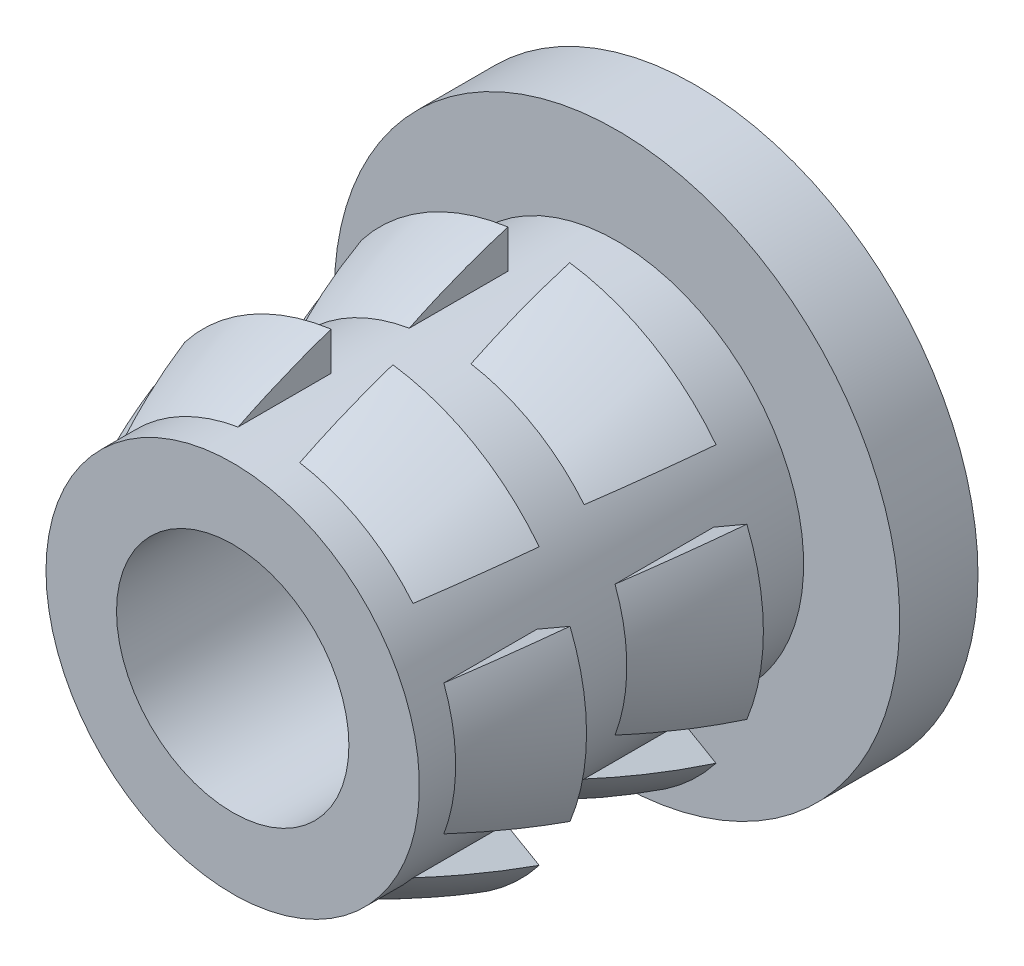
ISO-10303-21;
HEADER;
FILE_DESCRIPTION(('STEP AP214'),'2;1');
FILE_NAME('part.step','',(''),(''),'','','');
FILE_SCHEMA(('AUTOMOTIVE_DESIGN { 1 0 10303 214 1 1 1 1 }'));
ENDSEC;
DATA;
#1=APPLICATION_CONTEXT('core data for automotive mechanical design processes');
#2=APPLICATION_PROTOCOL_DEFINITION('international standard','automotive_design',2000,#1);
#3=PRODUCT_CONTEXT('',#1,'mechanical');
#4=PRODUCT('Part','Part','',(#3));
#5=PRODUCT_RELATED_PRODUCT_CATEGORY('part','',(#4));
#6=PRODUCT_DEFINITION_FORMATION('','',#4);
#7=PRODUCT_DEFINITION_CONTEXT('part definition',#1,'design');
#8=PRODUCT_DEFINITION('design','',#6,#7);
#9=PRODUCT_DEFINITION_SHAPE('','',#8);
#10=(LENGTH_UNIT() NAMED_UNIT(*) SI_UNIT(.MILLI.,.METRE.));
#11=(NAMED_UNIT(*) PLANE_ANGLE_UNIT() SI_UNIT($,.RADIAN.));
#12=(NAMED_UNIT(*) SI_UNIT($,.STERADIAN.) SOLID_ANGLE_UNIT());
#13=UNCERTAINTY_MEASURE_WITH_UNIT(LENGTH_MEASURE(1.E-05),#10,'distance_accuracy_value','');
#14=(GEOMETRIC_REPRESENTATION_CONTEXT(3) GLOBAL_UNCERTAINTY_ASSIGNED_CONTEXT((#13)) GLOBAL_UNIT_ASSIGNED_CONTEXT((#10,
#11,#12)) REPRESENTATION_CONTEXT('',''));
#15=CARTESIAN_POINT('',(0.,0.,0.));
#16=DIRECTION('',(0.,0.,1.));
#17=DIRECTION('',(1.,0.,0.));
#18=AXIS2_PLACEMENT_3D('',#15,#16,#17);
#19=CARTESIAN_POINT('',(10.75384757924,0.,-17.2405307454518));
#20=DIRECTION('',(0.,0.,1.));
#21=DIRECTION('',(1.,0.,0.));
#22=AXIS2_PLACEMENT_3D('',#19,#20,#21);
#23=PLANE('',#22);
#24=CARTESIAN_POINT('',(8.93774757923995,0.,-17.2405307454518));
#25=DIRECTION('',(0.,0.,-1.));
#26=DIRECTION('',(-1.,0.,0.));
#27=AXIS2_PLACEMENT_3D('',#24,#25,#26);
#28=CIRCLE('',#27,1.8161);
#29=CARTESIAN_POINT('',(7.53656596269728,1.15538274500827,-17.2405307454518));
#30=VERTEX_POINT('',#29);
#31=CARTESIAN_POINT('',(8.63774757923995,1.79115024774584,-17.2405307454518));
#32=VERTEX_POINT('',#31);
#33=EDGE_CURVE('E298',#30,#32,#28,.T.);
#34=ORIENTED_EDGE('',*,*,#33,.F.);
#35=DIRECTION('',(-0.866025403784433,0.50000000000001,0.));
#36=VECTOR('',#35,1.);
#37=CARTESIAN_POINT('',(10.4498225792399,-0.52658674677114,-17.2405307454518));
#38=LINE('',#37,#36);
#39=CARTESIAN_POINT('',(7.21392727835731,1.34165827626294,-17.2405307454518));
#40=VERTEX_POINT('',#39);
#41=EDGE_CURVE('E662',#30,#40,#38,.T.);
#42=ORIENTED_EDGE('',*,*,#41,.T.);
#43=CARTESIAN_POINT('',(8.93774757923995,0.,-17.2405307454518));
#44=DIRECTION('',(0.,0.,-1.));
#45=DIRECTION('',(-1.,0.,0.));
#46=AXIS2_PLACEMENT_3D('',#43,#44,#45);
#47=CIRCLE('',#46,2.1844);
#48=CARTESIAN_POINT('',(8.63774757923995,2.16370131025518,-17.2405307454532));
#49=VERTEX_POINT('',#48);
#50=EDGE_CURVE('E413',#40,#49,#47,.T.);
#51=ORIENTED_EDGE('',*,*,#50,.T.);
#52=DIRECTION('',(0.,-1.,0.));
#53=VECTOR('',#52,1.);
#54=CARTESIAN_POINT('',(8.63774757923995,0.,-17.2405307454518));
#55=LINE('',#54,#53);
#56=EDGE_CURVE('E673',#49,#32,#55,.T.);
#57=ORIENTED_EDGE('',*,*,#56,.T.);
#58=EDGE_LOOP('',(#34,#42,#51,#57));
#59=FACE_BOUND('',#58,.T.);
#60=ADVANCED_FACE('F43',(#59),#23,.F.);
#61=CARTESIAN_POINT('',(8.93774757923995,0.,-19.077055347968));
#62=DIRECTION('',(0.,0.,-1.));
#63=DIRECTION('',(-1.,0.,0.));
#64=AXIS2_PLACEMENT_3D('',#61,#62,#63);
#65=DEGENERATE_TOROIDAL_SURFACE('',#64,4.03884641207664,6.48857600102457,.F.);
#66=ORIENTED_EDGE('',*,*,#50,.F.);
#67=CARTESIAN_POINT('',(7.21387567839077,1.34168806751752,-17.2407307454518));
#68=CARTESIAN_POINT('',(7.25638494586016,1.317145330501,-17.0759447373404));
#69=CARTESIAN_POINT('',(7.30462719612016,1.28929265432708,-16.9131818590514));
#70=CARTESIAN_POINT('',(7.38536416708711,1.24267914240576,-16.6728736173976));
#71=CARTESIAN_POINT('',(7.41366221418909,1.22634125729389,-16.5934337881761));
#72=CARTESIAN_POINT('',(7.47306506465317,1.19204500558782,-16.4358119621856));
#73=CARTESIAN_POINT('',(7.50417436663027,1.17408404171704,-16.3576322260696));
#74=CARTESIAN_POINT('',(7.53664985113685,1.1553343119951,-16.2802107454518));
#75=B_SPLINE_CURVE_WITH_KNOTS('',3,(#67,#68,#69,#70,#71,#72,#73,#74),.UNSPECIFIED.,.F.,.F.,(4,2,
2,4),(0.,0.515567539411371,0.773194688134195,1.03124165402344),.UNSPECIFIED.);
#76=CARTESIAN_POINT('',(7.53656596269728,1.15538274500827,-16.2804107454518));
#77=VERTEX_POINT('',#76);
#78=EDGE_CURVE('E661',#40,#77,#75,.T.);
#79=ORIENTED_EDGE('',*,*,#78,.T.);
#80=CARTESIAN_POINT('',(8.93774757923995,0.,-16.2804107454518));
#81=DIRECTION('',(0.,0.,-1.));
#82=DIRECTION('',(-1.,0.,0.));
#83=AXIS2_PLACEMENT_3D('',#80,#81,#82);
#84=CIRCLE('',#83,1.8161);
#85=CARTESIAN_POINT('',(8.63774757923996,1.79115024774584,-16.2804107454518));
#86=VERTEX_POINT('',#85);
#87=EDGE_CURVE('E428',#77,#86,#84,.T.);
#88=ORIENTED_EDGE('',*,*,#87,.T.);
#89=CARTESIAN_POINT('',(8.63774757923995,1.99680857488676,-16.7529502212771));
#90=CARTESIAN_POINT('',(8.63774757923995,2.06197951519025,-16.9209435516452));
#91=CARTESIAN_POINT('',(8.63774757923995,2.12005202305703,-17.0917232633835));
#92=CARTESIAN_POINT('',(8.63774757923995,2.22163662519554,-17.4376354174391));
#93=CARTESIAN_POINT('',(8.63774757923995,2.26514130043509,-17.612770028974));
#94=CARTESIAN_POINT('',(8.63774757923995,2.33733891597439,-17.9663608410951));
#95=CARTESIAN_POINT('',(8.63774757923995,2.36600815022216,-18.1448218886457));
#96=CARTESIAN_POINT('',(8.63774757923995,2.40824914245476,-18.5035846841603));
#97=CARTESIAN_POINT('',(8.63774757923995,2.42181553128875,-18.6838870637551));
#98=CARTESIAN_POINT('',(8.63774757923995,2.43374322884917,-19.0449571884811));
#99=CARTESIAN_POINT('',(8.63774757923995,2.43210765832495,-19.2257248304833));
#100=CARTESIAN_POINT('',(8.63774757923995,2.41364946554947,-19.5864830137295));
#101=CARTESIAN_POINT('',(8.63774757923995,2.39682685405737,-19.7664735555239));
#102=CARTESIAN_POINT('',(8.63774757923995,2.34810674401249,-20.1243865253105));
#103=CARTESIAN_POINT('',(8.63774757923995,2.31621060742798,-20.3023091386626));
#104=CARTESIAN_POINT('',(8.63774757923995,2.23756417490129,-20.6547756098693));
#105=CARTESIAN_POINT('',(8.63774757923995,2.19081911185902,-20.8293206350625));
#106=CARTESIAN_POINT('',(8.63774757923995,2.08263577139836,-21.1742670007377));
#107=CARTESIAN_POINT('',(8.63774757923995,2.02116179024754,-21.3446571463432));
#108=CARTESIAN_POINT('',(8.63774757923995,1.88394363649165,-21.6796389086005));
#109=CARTESIAN_POINT('',(8.63774757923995,1.80819648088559,-21.8442293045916));
#110=CARTESIAN_POINT('',(8.63774757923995,1.64290636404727,-22.1662452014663));
#111=CARTESIAN_POINT('',(8.63774757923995,1.55336862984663,-22.3236733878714));
#112=CARTESIAN_POINT('',(8.63774757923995,1.36093767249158,-22.6300666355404));
#113=CARTESIAN_POINT('',(8.63774757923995,1.25805311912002,-22.7790371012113));
#114=CARTESIAN_POINT('',(8.63774757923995,1.10606090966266,-22.9788574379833));
#115=CARTESIAN_POINT('',(8.63774757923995,1.06253347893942,-23.0340114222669));
#116=CARTESIAN_POINT('',(8.63774757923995,0.973448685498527,-23.1426610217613));
#117=CARTESIAN_POINT('',(8.63774757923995,0.927891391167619,-23.1961566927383));
#118=CARTESIAN_POINT('',(8.63774757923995,0.834821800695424,-23.3011172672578));
#119=CARTESIAN_POINT('',(8.63774757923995,0.787316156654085,-23.3525880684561));
#120=CARTESIAN_POINT('',(8.63774757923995,0.690051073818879,-23.4533458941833));
#121=CARTESIAN_POINT('',(8.63774757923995,0.640292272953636,-23.5026335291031));
#122=CARTESIAN_POINT('',(8.63774757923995,0.55496425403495,-23.5825144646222));
#123=CARTESIAN_POINT('',(8.63774757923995,0.520139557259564,-23.6139032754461));
#124=CARTESIAN_POINT('',(8.63774757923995,0.448857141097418,-23.6750764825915));
#125=CARTESIAN_POINT('',(8.63774757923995,0.412393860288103,-23.7048545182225));
#126=CARTESIAN_POINT('',(8.63774757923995,0.355964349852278,-23.7476043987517));
#127=CARTESIAN_POINT('',(8.63774757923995,0.336772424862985,-23.76159511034));
#128=CARTESIAN_POINT('',(8.63774757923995,0.297731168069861,-23.7886209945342));
#129=CARTESIAN_POINT('',(8.63774757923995,0.277882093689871,-23.8016565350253));
#130=CARTESIAN_POINT('',(8.63774757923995,0.237417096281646,-23.8263350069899));
#131=CARTESIAN_POINT('',(8.63774757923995,0.216804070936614,-23.8379826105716));
#132=CARTESIAN_POINT('',(8.63774757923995,0.174572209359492,-23.859244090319));
#133=CARTESIAN_POINT('',(8.63774757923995,0.152955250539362,-23.8688615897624));
#134=CARTESIAN_POINT('',(8.63774757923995,0.108443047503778,-23.8850320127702));
#135=CARTESIAN_POINT('',(8.63774757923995,0.0855430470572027,-23.8915725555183));
#136=CARTESIAN_POINT('',(8.63774757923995,0.0389990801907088,-23.9000687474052));
#137=CARTESIAN_POINT('',(8.63774757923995,0.0153612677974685,-23.9020554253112));
#138=CARTESIAN_POINT('',(8.63774757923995,-0.0318476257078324,-23.9008993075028));
#139=CARTESIAN_POINT('',(8.63774757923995,-0.0554182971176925,-23.897741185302));
#140=CARTESIAN_POINT('',(8.63774757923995,-0.101687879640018,-23.8871874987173));
#141=CARTESIAN_POINT('',(8.63774757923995,-0.124379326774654,-23.8797617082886));
#142=CARTESIAN_POINT('',(8.63774757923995,-0.171866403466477,-23.8607635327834));
#143=CARTESIAN_POINT('',(8.63774757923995,-0.196472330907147,-23.8487383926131));
#144=CARTESIAN_POINT('',(8.63774757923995,-0.244449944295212,-23.8224002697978));
#145=CARTESIAN_POINT('',(8.63774757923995,-0.267818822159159,-23.8080823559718));
#146=CARTESIAN_POINT('',(8.63774757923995,-0.313714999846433,-23.7778984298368));
#147=CARTESIAN_POINT('',(8.63774757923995,-0.336236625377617,-23.7620239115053));
#148=CARTESIAN_POINT('',(8.63774757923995,-0.380489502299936,-23.7292672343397));
#149=CARTESIAN_POINT('',(8.63774757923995,-0.402221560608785,-23.7123861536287));
#150=CARTESIAN_POINT('',(8.63774757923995,-0.466923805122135,-23.6602826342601));
#151=CARTESIAN_POINT('',(8.63774757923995,-0.508961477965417,-23.6239048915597));
#152=CARTESIAN_POINT('',(8.63774757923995,-0.591236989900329,-23.5491559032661));
#153=CARTESIAN_POINT('',(8.63774757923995,-0.631473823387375,-23.5107835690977));
#154=CARTESIAN_POINT('',(8.63774757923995,-0.710493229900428,-23.4324223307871));
#155=CARTESIAN_POINT('',(8.63774757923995,-0.749272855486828,-23.3924304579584));
#156=CARTESIAN_POINT('',(8.63774757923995,-0.82543143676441,-23.3111590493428));
#157=CARTESIAN_POINT('',(8.63774757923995,-0.86281072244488,-23.2698798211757));
#158=CARTESIAN_POINT('',(8.63774757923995,-0.972903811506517,-23.1444123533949));
#159=CARTESIAN_POINT('',(8.63774757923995,-1.04366624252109,-23.0585004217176));
#160=CARTESIAN_POINT('',(8.63774757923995,-1.18010146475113,-22.8828870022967));
#161=CARTESIAN_POINT('',(8.63774757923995,-1.24577901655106,-22.7931891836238));
#162=CARTESIAN_POINT('',(8.63774757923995,-1.40920189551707,-22.556684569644));
#163=CARTESIAN_POINT('',(8.63774757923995,-1.50316204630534,-22.4072389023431));
#164=CARTESIAN_POINT('',(8.63774757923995,-1.67822469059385,-22.1008887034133));
#165=CARTESIAN_POINT('',(8.63774757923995,-1.75931791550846,-21.943978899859));
#166=CARTESIAN_POINT('',(8.63774757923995,-1.90814160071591,-21.6240209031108));
#167=CARTESIAN_POINT('',(8.63774757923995,-1.97587754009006,-21.4609752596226));
#168=CARTESIAN_POINT('',(8.63774757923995,-2.09763057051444,-21.1298850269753));
#169=CARTESIAN_POINT('',(8.63774757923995,-2.15165071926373,-20.9618415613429));
#170=CARTESIAN_POINT('',(8.63774757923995,-2.24598607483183,-20.6207408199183));
#171=CARTESIAN_POINT('',(8.63774757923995,-2.28620727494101,-20.4476575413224));
#172=CARTESIAN_POINT('',(8.63774757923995,-2.35220401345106,-20.0986987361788));
#173=CARTESIAN_POINT('',(8.63774757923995,-2.3779746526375,-19.9228222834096));
#174=CARTESIAN_POINT('',(8.63774757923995,-2.41488609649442,-19.569553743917));
#175=CARTESIAN_POINT('',(8.63774757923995,-2.42602796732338,-19.392161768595));
#176=CARTESIAN_POINT('',(8.63774757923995,-2.43361501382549,-19.0370634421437));
#177=CARTESIAN_POINT('',(8.63774757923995,-2.43006008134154,-18.8593570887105));
#178=CARTESIAN_POINT('',(8.63774757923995,-2.40807548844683,-18.5015933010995));
#179=CARTESIAN_POINT('',(8.63774757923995,-2.38937434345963,-18.3215524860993));
#180=CARTESIAN_POINT('',(8.63774757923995,-2.33688520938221,-17.9637463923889));
#181=CARTESIAN_POINT('',(8.63774757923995,-2.30310231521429,-17.7859803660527));
#182=CARTESIAN_POINT('',(8.63774757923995,-2.22062195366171,-17.4337245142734));
#183=CARTESIAN_POINT('',(8.63774757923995,-2.17190730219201,-17.2592387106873));
#184=CARTESIAN_POINT('',(8.63774757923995,-2.05989551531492,-16.9150428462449));
#185=CARTESIAN_POINT('',(8.63774757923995,-1.99660074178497,-16.7453320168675));
#186=CARTESIAN_POINT('',(8.63774757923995,-1.8558353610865,-16.4119615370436));
#187=CARTESIAN_POINT('',(8.63774757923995,-1.77836992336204,-16.2482997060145));
#188=CARTESIAN_POINT('',(8.63774757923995,-1.60963775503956,-15.9281442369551));
#189=CARTESIAN_POINT('',(8.63774757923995,-1.51836360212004,-15.771654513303));
#190=CARTESIAN_POINT('',(8.63774757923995,-1.32259459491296,-15.4674643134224));
#191=CARTESIAN_POINT('',(8.63774757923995,-1.21812093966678,-15.3197502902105));
#192=CARTESIAN_POINT('',(8.63774757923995,-1.05158332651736,-15.1060195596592));
#193=CARTESIAN_POINT('',(8.63774757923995,-0.99445929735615,-15.0361107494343));
#194=CARTESIAN_POINT('',(8.63774757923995,-0.876821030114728,-14.8992154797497));
#195=CARTESIAN_POINT('',(8.63774757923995,-0.816307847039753,-14.8322281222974));
#196=CARTESIAN_POINT('',(8.63774757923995,-0.722787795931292,-14.7344505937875));
#197=CARTESIAN_POINT('',(8.63774757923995,-0.691171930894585,-14.7023234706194));
#198=CARTESIAN_POINT('',(8.63774757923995,-0.626909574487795,-14.6390989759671));
#199=CARTESIAN_POINT('',(8.63774757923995,-0.594262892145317,-14.608001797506));
#200=CARTESIAN_POINT('',(8.63774757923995,-0.527867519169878,-14.5471671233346));
#201=CARTESIAN_POINT('',(8.63774757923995,-0.494121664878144,-14.5174265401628));
#202=CARTESIAN_POINT('',(8.63774757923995,-0.42517854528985,-14.459689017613));
#203=CARTESIAN_POINT('',(8.63774757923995,-0.3899821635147,-14.4316910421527));
#204=CARTESIAN_POINT('',(8.63774757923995,-0.328001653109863,-14.386139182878));
#205=CARTESIAN_POINT('',(8.63774757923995,-0.301722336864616,-14.3679036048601));
#206=CARTESIAN_POINT('',(8.63774757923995,-0.247705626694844,-14.3335781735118));
#207=CARTESIAN_POINT('',(8.63774757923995,-0.219966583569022,-14.3174908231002));
#208=CARTESIAN_POINT('',(8.63774757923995,-0.169226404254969,-14.2923847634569));
#209=CARTESIAN_POINT('',(8.63774757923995,-0.146619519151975,-14.2825920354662));
#210=CARTESIAN_POINT('',(8.63774757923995,-0.10020073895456,-14.2665676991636));
#211=CARTESIAN_POINT('',(8.63774757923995,-0.0763944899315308,-14.26032084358));
#212=CARTESIAN_POINT('',(8.63774757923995,-0.0324845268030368,-14.253548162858));
#213=CARTESIAN_POINT('',(8.63774757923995,-0.0125186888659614,-14.2521724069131));
#214=CARTESIAN_POINT('',(8.63774757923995,0.0273225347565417,-14.2530548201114));
#215=CARTESIAN_POINT('',(8.63774757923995,0.0471979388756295,-14.2553122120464));
#216=CARTESIAN_POINT('',(8.63774757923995,0.0932471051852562,-14.2643258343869));
#217=CARTESIAN_POINT('',(8.63774757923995,0.119150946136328,-14.2723950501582));
#218=CARTESIAN_POINT('',(8.63774757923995,0.169541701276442,-14.2922890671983));
#219=CARTESIAN_POINT('',(8.63774757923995,0.194018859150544,-14.3041367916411));
#220=CARTESIAN_POINT('',(8.63774757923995,0.237692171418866,-14.3279190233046));
#221=CARTESIAN_POINT('',(8.63774757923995,0.257084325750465,-14.3395040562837));
#222=CARTESIAN_POINT('',(8.63774757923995,0.295171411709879,-14.3637769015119));
#223=CARTESIAN_POINT('',(8.63774757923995,0.313865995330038,-14.3764652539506));
#224=CARTESIAN_POINT('',(8.63774757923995,0.369188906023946,-14.4157555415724));
#225=CARTESIAN_POINT('',(8.63774757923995,0.404975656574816,-14.4435351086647));
#226=CARTESIAN_POINT('',(8.63774757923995,0.475139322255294,-14.5011020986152));
#227=CARTESIAN_POINT('',(8.63774757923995,0.509508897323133,-14.530898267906));
#228=CARTESIAN_POINT('',(8.63774757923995,0.576957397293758,-14.5918240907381));
#229=CARTESIAN_POINT('',(8.63774757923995,0.610037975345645,-14.622951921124));
#230=CARTESIAN_POINT('',(8.63774757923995,0.696702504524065,-14.7072554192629));
#231=CARTESIAN_POINT('',(8.63774757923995,0.749360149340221,-14.7613833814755));
#232=CARTESIAN_POINT('',(8.63774757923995,0.852163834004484,-14.8719829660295));
#233=CARTESIAN_POINT('',(8.63774757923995,0.902309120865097,-14.9284552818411));
#234=CARTESIAN_POINT('',(8.63774757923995,1.04933684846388,-15.1010536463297));
#235=CARTESIAN_POINT('',(8.63774757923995,1.14267410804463,-15.2202246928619));
#236=CARTESIAN_POINT('',(8.63774757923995,1.31977520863,-15.4647508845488));
#237=CARTESIAN_POINT('',(8.63774757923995,1.40357349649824,-15.5900812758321));
#238=CARTESIAN_POINT('',(8.63774757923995,1.56178267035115,-15.8463860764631));
#239=CARTESIAN_POINT('',(8.63774757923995,1.63620193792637,-15.9773553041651));
#240=CARTESIAN_POINT('',(8.63774757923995,1.7602315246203,-16.2150105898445));
#241=CARTESIAN_POINT('',(8.63774757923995,1.81170502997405,-16.3207300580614));
#242=CARTESIAN_POINT('',(8.63774757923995,1.90873065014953,-16.5348870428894));
#243=CARTESIAN_POINT('',(8.63774757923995,1.95428096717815,-16.6433253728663));
#244=CARTESIAN_POINT('',(8.63774757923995,1.99680857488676,-16.7529502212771));
#245=B_SPLINE_CURVE_WITH_KNOTS('',3,(#89,#90,#91,#92,#93,#94,#95,#96,#97,#98,#99,#100,#101,#102,
#103,#104,#105,#106,#107,#108,#109,#110,#111,#112,#113,#114,#115,#116,#117,#118,#119,#120,#121,
#122,#123,#124,#125,#126,#127,#128,#129,#130,#131,#132,#133,#134,#135,#136,#137,#138,#139,#140,
#141,#142,#143,#144,#145,#146,#147,#148,#149,#150,#151,#152,#153,#154,#155,#156,#157,#158,#159,
#160,#161,#162,#163,#164,#165,#166,#167,#168,#169,#170,#171,#172,#173,#174,#175,#176,#177,#178,
#179,#180,#181,#182,#183,#184,#185,#186,#187,#188,#189,#190,#191,#192,#193,#194,#195,#196,#197,
#198,#199,#200,#201,#202,#203,#204,#205,#206,#207,#208,#209,#210,#211,#212,#213,#214,#215,#216,
#217,#218,#219,#220,#221,#222,#223,#224,#225,#226,#227,#228,#229,#230,#231,#232,#233,#234,#235,
#236,#237,#238,#239,#240,#241,#242,#243,#244),.UNSPECIFIED.,.T.,.F.,(4,2,2,2,2,2,2,2,2,2,2,2,2,
2,2,2,2,2,2,2,2,2,2,2,2,2,2,2,2,2,2,2,2,2,2,2,2,2,2,2,2,2,2,2,2,2,2,2,2,2,2,2,2,2,2,2,2,2,2,2,2,
2,2,2,2,2,2,2,2,2,2,2,2,2,2,2,2,4),(0.,0.540467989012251,1.08121080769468,1.622815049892,
2.16461177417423,2.70629727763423,3.24798239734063,3.78961858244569,4.33106410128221,
4.87383563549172,5.41672073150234,5.95940056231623,6.50172962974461,6.71247757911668,
6.92321843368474,7.13329152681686,7.34330551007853,7.48392096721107,7.62505629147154,
7.69628695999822,7.76749004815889,7.83844624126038,7.90927470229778,7.98038576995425,
8.05101084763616,8.12184670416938,8.19319055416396,8.27515624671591,8.35730065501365,
8.43992201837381,8.52245642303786,8.68912360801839,8.85588272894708,9.02296274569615,
9.19000313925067,9.52368731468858,9.85705521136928,10.3859509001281,10.9152258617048,
11.4442832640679,11.9732226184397,12.5056970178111,13.0383518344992,13.5709678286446,
14.1035877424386,14.6459714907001,15.1881721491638,15.7309991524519,16.2737382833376,
16.8162798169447,17.3591140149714,17.9010872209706,18.1718437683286,18.4425164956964,
18.5777228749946,18.7129544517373,18.8478610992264,18.9826867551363,19.078589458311,
19.174602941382,19.2483363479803,19.3217502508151,19.3814673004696,19.4411715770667,
19.5220788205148,19.6034865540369,19.6712076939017,19.7389621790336,19.874751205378,
20.0111724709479,20.1474125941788,20.3738563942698,20.6003676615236,21.0539684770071,
21.5058754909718,21.9573757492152,22.3099539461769,22.6626389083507),.UNSPECIFIED.);
#246=EDGE_CURVE('E562',#86,#49,#245,.T.);
#247=ORIENTED_EDGE('',*,*,#246,.T.);
#248=EDGE_LOOP('',(#66,#79,#88,#247));
#249=FACE_BOUND('',#248,.T.);
#250=ADVANCED_FACE('F342',(#249),#65,.F.);
#251=CARTESIAN_POINT('',(10.75384757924,0.,-15.5204107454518));
#252=DIRECTION('',(0.,0.,1.));
#253=DIRECTION('',(1.,0.,0.));
#254=AXIS2_PLACEMENT_3D('',#251,#252,#253);
#255=PLANE('',#254);
#256=CARTESIAN_POINT('',(8.93774757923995,0.,-15.5204107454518));
#257=DIRECTION('',(0.,0.,-1.));
#258=DIRECTION('',(-1.,0.,0.));
#259=AXIS2_PLACEMENT_3D('',#256,#257,#258);
#260=CIRCLE('',#259,1.8161);
#261=CARTESIAN_POINT('',(7.53656596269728,1.15538274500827,-15.5204107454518));
#262=VERTEX_POINT('',#261);
#263=CARTESIAN_POINT('',(8.63774757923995,1.79115024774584,-15.5204107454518));
#264=VERTEX_POINT('',#263);
#265=EDGE_CURVE('E445',#262,#264,#260,.T.);
#266=ORIENTED_EDGE('',*,*,#265,.F.);
#267=DIRECTION('',(-0.866025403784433,0.50000000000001,0.));
#268=VECTOR('',#267,1.);
#269=CARTESIAN_POINT('',(10.4498225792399,-0.52658674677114,-15.5204107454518));
#270=LINE('',#269,#268);
#271=CARTESIAN_POINT('',(7.21392727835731,1.34165827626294,-15.5204107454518));
#272=VERTEX_POINT('',#271);
#273=EDGE_CURVE('E664',#262,#272,#270,.T.);
#274=ORIENTED_EDGE('',*,*,#273,.T.);
#275=CARTESIAN_POINT('',(8.93774757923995,0.,-15.5204107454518));
#276=DIRECTION('',(0.,0.,-1.));
#277=DIRECTION('',(-1.,0.,0.));
#278=AXIS2_PLACEMENT_3D('',#275,#276,#277);
#279=CIRCLE('',#278,2.1844);
#280=CARTESIAN_POINT('',(8.63774757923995,2.16370131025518,-15.5204107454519));
#281=VERTEX_POINT('',#280);
#282=EDGE_CURVE('E462',#272,#281,#279,.T.);
#283=ORIENTED_EDGE('',*,*,#282,.T.);
#284=DIRECTION('',(0.,-1.,0.));
#285=VECTOR('',#284,1.);
#286=CARTESIAN_POINT('',(8.63774757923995,0.,-15.5204107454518));
#287=LINE('',#286,#285);
#288=EDGE_CURVE('E674',#281,#264,#287,.T.);
#289=ORIENTED_EDGE('',*,*,#288,.T.);
#290=EDGE_LOOP('',(#266,#274,#283,#289));
#291=FACE_BOUND('',#290,.T.);
#292=ADVANCED_FACE('F347',(#291),#255,.F.);
#293=CARTESIAN_POINT('',(8.93774757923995,0.,-17.8385896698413));
#294=DIRECTION('',(0.,0.,-1.));
#295=DIRECTION('',(-1.,0.,0.));
#296=AXIS2_PLACEMENT_3D('',#293,#294,#295);
#297=DEGENERATE_TOROIDAL_SURFACE('',#296,4.8080264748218,7.3666804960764,.F.);
#298=ORIENTED_EDGE('',*,*,#282,.F.);
#299=CARTESIAN_POINT('',(7.21386930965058,1.34169174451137,-15.5206107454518));
#300=CARTESIAN_POINT('',(7.25881794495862,1.31574063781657,-15.3655036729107));
#301=CARTESIAN_POINT('',(7.30819074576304,1.2872352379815,-15.2124995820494));
#302=CARTESIAN_POINT('',(7.41578476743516,1.2251158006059,-14.9106971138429));
#303=CARTESIAN_POINT('',(7.47400600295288,1.19150175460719,-14.7618987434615));
#304=CARTESIAN_POINT('',(7.53665141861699,1.15533340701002,-14.6152033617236));
#305=B_SPLINE_CURVE_WITH_KNOTS('',3,(#299,#300,#301,#302,#303,#304),.UNSPECIFIED.,.F.,.F.,(4,2,
4),(0.,0.489841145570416,0.979683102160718),.UNSPECIFIED.);
#306=CARTESIAN_POINT('',(7.53656596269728,1.15538274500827,-14.6154033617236));
#307=VERTEX_POINT('',#306);
#308=EDGE_CURVE('E292',#272,#307,#305,.T.);
#309=ORIENTED_EDGE('',*,*,#308,.T.);
#310=CARTESIAN_POINT('',(8.93774757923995,0.,-14.6154033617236));
#311=DIRECTION('',(0.,0.,-1.));
#312=DIRECTION('',(-1.,0.,0.));
#313=AXIS2_PLACEMENT_3D('',#310,#311,#312);
#314=CIRCLE('',#313,1.8161);
#315=CARTESIAN_POINT('',(8.63774757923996,1.79115024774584,-14.6154033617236));
#316=VERTEX_POINT('',#315);
#317=EDGE_CURVE('E318',#307,#316,#314,.T.);
#318=ORIENTED_EDGE('',*,*,#317,.T.);
#319=CARTESIAN_POINT('',(8.63774757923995,1.99273815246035,-15.0616040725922));
#320=CARTESIAN_POINT('',(8.63774757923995,2.07059825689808,-15.2507812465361));
#321=CARTESIAN_POINT('',(8.63774757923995,2.14044196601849,-15.4432627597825));
#322=CARTESIAN_POINT('',(8.63774757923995,2.26368778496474,-15.8334635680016));
#323=CARTESIAN_POINT('',(8.63774757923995,2.31708605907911,-16.0311840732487));
#324=CARTESIAN_POINT('',(8.63774757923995,2.4071186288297,-16.4305491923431));
#325=CARTESIAN_POINT('',(8.63774757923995,2.4437413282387,-16.6321964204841));
#326=CARTESIAN_POINT('',(8.63774757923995,2.49993133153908,-17.0378377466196));
#327=CARTESIAN_POINT('',(8.63774757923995,2.51949986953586,-17.2418316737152));
#328=CARTESIAN_POINT('',(8.63774757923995,2.54144882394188,-17.6505433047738));
#329=CARTESIAN_POINT('',(8.63774757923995,2.54384590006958,-17.8552601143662));
#330=CARTESIAN_POINT('',(8.63774757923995,2.53147754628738,-18.2642673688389));
#331=CARTESIAN_POINT('',(8.63774757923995,2.51670436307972,-18.4685575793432));
#332=CARTESIAN_POINT('',(8.63774757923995,2.4700667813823,-18.8752820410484));
#333=CARTESIAN_POINT('',(8.63774757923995,2.43819381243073,-19.0777153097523));
#334=CARTESIAN_POINT('',(8.63774757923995,2.35757452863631,-19.4790986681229));
#335=CARTESIAN_POINT('',(8.63774757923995,2.3088358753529,-19.6780502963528));
#336=CARTESIAN_POINT('',(8.63774757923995,2.19446022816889,-20.0722814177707));
#337=CARTESIAN_POINT('',(8.63774757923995,2.12872741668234,-20.2675331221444));
#338=CARTESIAN_POINT('',(8.63774757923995,1.98088573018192,-20.6517924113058));
#339=CARTESIAN_POINT('',(8.63774757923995,1.89877317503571,-20.840798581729));
#340=CARTESIAN_POINT('',(8.63774757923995,1.71885417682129,-21.210641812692));
#341=CARTESIAN_POINT('',(8.63774757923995,1.62108419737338,-21.3914966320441));
#342=CARTESIAN_POINT('',(8.63774757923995,1.41020658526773,-21.743938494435));
#343=CARTESIAN_POINT('',(8.63774757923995,1.2971095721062,-21.9155318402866));
#344=CARTESIAN_POINT('',(8.63774757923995,1.1327863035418,-22.1415127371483));
#345=CARTESIAN_POINT('',(8.63774757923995,1.08816726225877,-22.2007756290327));
#346=CARTESIAN_POINT('',(8.63774757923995,0.996885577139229,-22.3177148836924));
#347=CARTESIAN_POINT('',(8.63774757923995,0.950222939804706,-22.3753912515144));
#348=CARTESIAN_POINT('',(8.63774757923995,0.854727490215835,-22.4890029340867));
#349=CARTESIAN_POINT('',(8.63774757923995,0.805892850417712,-22.5449367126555));
#350=CARTESIAN_POINT('',(8.63774757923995,0.705904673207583,-22.6546753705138));
#351=CARTESIAN_POINT('',(8.63774757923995,0.654751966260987,-22.708480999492));
#352=CARTESIAN_POINT('',(8.63774757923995,0.57572396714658,-22.7872335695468));
#353=CARTESIAN_POINT('',(8.63774757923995,0.548904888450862,-22.8132418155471));
#354=CARTESIAN_POINT('',(8.63774757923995,0.494398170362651,-22.8643664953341));
#355=CARTESIAN_POINT('',(8.63774757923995,0.466710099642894,-22.8894824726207));
#356=CARTESIAN_POINT('',(8.63774757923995,0.410314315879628,-22.9384487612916));
#357=CARTESIAN_POINT('',(8.63774757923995,0.381608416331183,-22.9623011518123));
#358=CARTESIAN_POINT('',(8.63774757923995,0.32278263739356,-23.0081748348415));
#359=CARTESIAN_POINT('',(8.63774757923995,0.292664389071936,-23.0301981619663));
#360=CARTESIAN_POINT('',(8.63774757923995,0.239091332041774,-23.0653527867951));
#361=CARTESIAN_POINT('',(8.63774757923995,0.216142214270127,-23.0792437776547));
#362=CARTESIAN_POINT('',(8.63774757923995,0.168810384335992,-23.1043719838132));
#363=CARTESIAN_POINT('',(8.63774757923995,0.144430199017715,-23.1156137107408));
#364=CARTESIAN_POINT('',(8.63774757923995,0.101018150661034,-23.1311663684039));
#365=CARTESIAN_POINT('',(8.63774757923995,0.0823792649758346,-23.1365348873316));
#366=CARTESIAN_POINT('',(8.63774757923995,0.0444874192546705,-23.1440854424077));
#367=CARTESIAN_POINT('',(8.63774757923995,0.025236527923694,-23.1462772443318));
#368=CARTESIAN_POINT('',(8.63774757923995,-0.0134322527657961,-23.1470132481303));
#369=CARTESIAN_POINT('',(8.63774757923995,-0.032850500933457,-23.1455400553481));
#370=CARTESIAN_POINT('',(8.63774757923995,-0.0711487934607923,-23.1392456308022));
#371=CARTESIAN_POINT('',(8.63774757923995,-0.0900273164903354,-23.1344157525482));
#372=CARTESIAN_POINT('',(8.63774757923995,-0.138891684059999,-23.118329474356));
#373=CARTESIAN_POINT('',(8.63774757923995,-0.168149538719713,-23.1049367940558));
#374=CARTESIAN_POINT('',(8.63774757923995,-0.210504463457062,-23.0821063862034));
#375=CARTESIAN_POINT('',(8.63774757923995,-0.224405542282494,-23.0740118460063));
#376=CARTESIAN_POINT('',(8.63774757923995,-0.251772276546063,-23.0571163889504));
#377=CARTESIAN_POINT('',(8.63774757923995,-0.265238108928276,-23.0483157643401));
#378=CARTESIAN_POINT('',(8.63774757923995,-0.30592069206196,-23.0205532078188));
#379=CARTESIAN_POINT('',(8.63774757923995,-0.332544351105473,-23.000730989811));
#380=CARTESIAN_POINT('',(8.63774757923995,-0.384693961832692,-22.9596815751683));
#381=CARTESIAN_POINT('',(8.63774757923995,-0.410219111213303,-22.9384533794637));
#382=CARTESIAN_POINT('',(8.63774757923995,-0.460469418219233,-22.8949698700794));
#383=CARTESIAN_POINT('',(8.63774757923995,-0.485192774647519,-22.872712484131));
#384=CARTESIAN_POINT('',(8.63774757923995,-0.533944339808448,-22.8274468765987));
#385=CARTESIAN_POINT('',(8.63774757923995,-0.557972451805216,-22.8044385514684));
#386=CARTESIAN_POINT('',(8.63774757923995,-0.629325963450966,-22.7343579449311));
#387=CARTESIAN_POINT('',(8.63774757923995,-0.675757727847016,-22.6863744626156));
#388=CARTESIAN_POINT('',(8.63774757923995,-0.766604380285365,-22.588670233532));
#389=CARTESIAN_POINT('',(8.63774757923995,-0.811021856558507,-22.5389518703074));
#390=CARTESIAN_POINT('',(8.63774757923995,-0.916276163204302,-22.416923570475));
#391=CARTESIAN_POINT('',(8.63774757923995,-0.976226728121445,-22.3438470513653));
#392=CARTESIAN_POINT('',(8.63774757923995,-1.09282500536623,-22.1950984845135));
#393=CARTESIAN_POINT('',(8.63774757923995,-1.14947203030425,-22.1194259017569));
#394=CARTESIAN_POINT('',(8.63774757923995,-1.31468590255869,-21.8887504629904));
#395=CARTESIAN_POINT('',(8.63774757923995,-1.41840133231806,-21.7302357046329));
#396=CARTESIAN_POINT('',(8.63774757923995,-1.61249883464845,-21.4058522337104));
#397=CARTESIAN_POINT('',(8.63774757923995,-1.70291499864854,-21.2400037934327));
#398=CARTESIAN_POINT('',(8.63774757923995,-1.87037191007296,-20.9017853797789));
#399=CARTESIAN_POINT('',(8.63774757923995,-1.9474192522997,-20.7294186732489));
#400=CARTESIAN_POINT('',(8.63774757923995,-2.08915430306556,-20.3759104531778));
#401=CARTESIAN_POINT('',(8.63774757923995,-2.15358244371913,-20.1946648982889));
#402=CARTESIAN_POINT('',(8.63774757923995,-2.26791851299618,-19.8275847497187));
#403=CARTESIAN_POINT('',(8.63774757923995,-2.31782151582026,-19.6417486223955));
#404=CARTESIAN_POINT('',(8.63774757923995,-2.40283340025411,-19.2665830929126));
#405=CARTESIAN_POINT('',(8.63774757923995,-2.43793169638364,-19.0772512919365));
#406=CARTESIAN_POINT('',(8.63774757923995,-2.49308505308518,-18.6964077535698));
#407=CARTESIAN_POINT('',(8.63774757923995,-2.5131397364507,-18.5048959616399));
#408=CARTESIAN_POINT('',(8.63774757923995,-2.53890497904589,-18.1083232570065));
#409=CARTESIAN_POINT('',(8.63774757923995,-2.54359205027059,-17.9031950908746));
#410=CARTESIAN_POINT('',(8.63774757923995,-2.53572810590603,-17.4933551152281));
#411=CARTESIAN_POINT('',(8.63774757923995,-2.52318399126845,-17.2886431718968));
#412=CARTESIAN_POINT('',(8.63774757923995,-2.48093147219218,-16.8807948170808));
#413=CARTESIAN_POINT('',(8.63774757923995,-2.45120631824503,-16.6776601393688));
#414=CARTESIAN_POINT('',(8.63774757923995,-2.3747856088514,-16.2746894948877));
#415=CARTESIAN_POINT('',(8.63774757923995,-2.32809662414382,-16.0748522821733));
#416=CARTESIAN_POINT('',(8.63774757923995,-2.21782825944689,-15.6790521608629));
#417=CARTESIAN_POINT('',(8.63774757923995,-2.15418373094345,-15.4831073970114));
#418=CARTESIAN_POINT('',(8.63774757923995,-2.01046480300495,-15.097285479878));
#419=CARTESIAN_POINT('',(8.63774757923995,-1.93038695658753,-14.9074096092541));
#420=CARTESIAN_POINT('',(8.63774757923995,-1.75446501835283,-14.5356267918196));
#421=CARTESIAN_POINT('',(8.63774757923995,-1.65865593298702,-14.3537032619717));
#422=CARTESIAN_POINT('',(8.63774757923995,-1.45164349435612,-13.998925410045));
#423=CARTESIAN_POINT('',(8.63774757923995,-1.34045022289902,-13.8260652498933));
#424=CARTESIAN_POINT('',(8.63774757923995,-1.17690315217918,-13.5955819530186));
#425=CARTESIAN_POINT('',(8.63774757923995,-1.13105995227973,-13.5332710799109));
#426=CARTESIAN_POINT('',(8.63774757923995,-1.03716932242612,-13.4103251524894));
#427=CARTESIAN_POINT('',(8.63774757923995,-0.989121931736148,-13.3496900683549));
#428=CARTESIAN_POINT('',(8.63774757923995,-0.890710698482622,-13.2302556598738));
#429=CARTESIAN_POINT('',(8.63774757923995,-0.84034519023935,-13.1714577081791));
#430=CARTESIAN_POINT('',(8.63774757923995,-0.737158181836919,-13.0560733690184));
#431=CARTESIAN_POINT('',(8.63774757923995,-0.684337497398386,-12.9994862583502));
#432=CARTESIAN_POINT('',(8.63774757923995,-0.602672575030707,-12.916548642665));
#433=CARTESIAN_POINT('',(8.63774757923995,-0.574924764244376,-12.8891166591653));
#434=CARTESIAN_POINT('',(8.63774757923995,-0.518535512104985,-12.8351547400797));
#435=CARTESIAN_POINT('',(8.63774757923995,-0.489893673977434,-12.8086252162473));
#436=CARTESIAN_POINT('',(8.63774757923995,-0.431571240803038,-12.7568318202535));
#437=CARTESIAN_POINT('',(8.63774757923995,-0.401892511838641,-12.7315658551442));
#438=CARTESIAN_POINT('',(8.63774757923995,-0.341102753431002,-12.6828371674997));
#439=CARTESIAN_POINT('',(8.63774757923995,-0.309993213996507,-12.6593726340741));
#440=CARTESIAN_POINT('',(8.63774757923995,-0.254981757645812,-12.6218880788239));
#441=CARTESIAN_POINT('',(8.63774757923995,-0.231607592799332,-12.6071031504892));
#442=CARTESIAN_POINT('',(8.63774757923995,-0.183404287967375,-12.5800550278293));
#443=CARTESIAN_POINT('',(8.63774757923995,-0.158576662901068,-12.5677892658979));
#444=CARTESIAN_POINT('',(8.63774757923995,-0.114389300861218,-12.5503954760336));
#445=CARTESIAN_POINT('',(8.63774757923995,-0.0954521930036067,-12.544230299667));
#446=CARTESIAN_POINT('',(8.63774757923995,-0.0568510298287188,-12.5350702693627));
#447=CARTESIAN_POINT('',(8.63774757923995,-0.0371897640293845,-12.5320643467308));
#448=CARTESIAN_POINT('',(8.63774757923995,0.00251424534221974,-12.5298556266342));
#449=CARTESIAN_POINT('',(8.63774757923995,0.0225587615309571,-12.5306823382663));
#450=CARTESIAN_POINT('',(8.63774757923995,0.06216574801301,-12.5360052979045));
#451=CARTESIAN_POINT('',(8.63774757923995,0.0817269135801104,-12.5405105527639));
#452=CARTESIAN_POINT('',(8.63774757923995,0.129986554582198,-12.5553821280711));
#453=CARTESIAN_POINT('',(8.63774757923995,0.158096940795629,-12.5675831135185));
#454=CARTESIAN_POINT('',(8.63774757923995,0.1988215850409,-12.5885901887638));
#455=CARTESIAN_POINT('',(8.63774757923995,0.212192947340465,-12.5960691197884));
#456=CARTESIAN_POINT('',(8.63774757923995,0.23852037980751,-12.6117265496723));
#457=CARTESIAN_POINT('',(8.63774757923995,0.251476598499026,-12.6199047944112));
#458=CARTESIAN_POINT('',(8.63774757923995,0.289707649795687,-12.6451574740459));
#459=CARTESIAN_POINT('',(8.63774757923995,0.314461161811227,-12.663013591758));
#460=CARTESIAN_POINT('',(8.63774757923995,0.362958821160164,-12.7000565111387));
#461=CARTESIAN_POINT('',(8.63774757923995,0.386702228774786,-12.7192442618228));
#462=CARTESIAN_POINT('',(8.63774757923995,0.45687268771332,-12.7782585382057));
#463=CARTESIAN_POINT('',(8.63774757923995,0.502137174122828,-12.8194625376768));
#464=CARTESIAN_POINT('',(8.63774757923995,0.590697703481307,-12.9042105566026));
#465=CARTESIAN_POINT('',(8.63774757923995,0.633985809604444,-12.947762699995));
#466=CARTESIAN_POINT('',(8.63774757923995,0.718758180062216,-13.0364727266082));
#467=CARTESIAN_POINT('',(8.63774757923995,0.760244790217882,-13.0816283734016));
#468=CARTESIAN_POINT('',(8.63774757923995,0.864127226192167,-13.1985705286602));
#469=CARTESIAN_POINT('',(8.63774757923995,0.925443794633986,-13.2713168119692));
#470=CARTESIAN_POINT('',(8.63774757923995,1.044692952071,-13.4195415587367));
#471=CARTESIAN_POINT('',(8.63774757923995,1.10262470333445,-13.495020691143));
#472=CARTESIAN_POINT('',(8.63774757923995,1.27163007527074,-13.7252728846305));
#473=CARTESIAN_POINT('',(8.63774757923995,1.37777445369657,-13.8837014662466));
#474=CARTESIAN_POINT('',(8.63774757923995,1.57660486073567,-14.2082123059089));
#475=CARTESIAN_POINT('',(8.63774757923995,1.66932279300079,-14.3742751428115));
#476=CARTESIAN_POINT('',(8.63774757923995,1.84123880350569,-14.7131461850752));
#477=CARTESIAN_POINT('',(8.63774757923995,1.92044408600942,-14.8859507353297));
#478=CARTESIAN_POINT('',(8.63774757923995,1.99273815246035,-15.0616040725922));
#479=B_SPLINE_CURVE_WITH_KNOTS('',3,(#319,#320,#321,#322,#323,#324,#325,#326,#327,#328,#329,
#330,#331,#332,#333,#334,#335,#336,#337,#338,#339,#340,#341,#342,#343,#344,#345,#346,#347,#348,
#349,#350,#351,#352,#353,#354,#355,#356,#357,#358,#359,#360,#361,#362,#363,#364,#365,#366,#367,
#368,#369,#370,#371,#372,#373,#374,#375,#376,#377,#378,#379,#380,#381,#382,#383,#384,#385,#386,
#387,#388,#389,#390,#391,#392,#393,#394,#395,#396,#397,#398,#399,#400,#401,#402,#403,#404,#405,
#406,#407,#408,#409,#410,#411,#412,#413,#414,#415,#416,#417,#418,#419,#420,#421,#422,#423,#424,
#425,#426,#427,#428,#429,#430,#431,#432,#433,#434,#435,#436,#437,#438,#439,#440,#441,#442,#443,
#444,#445,#446,#447,#448,#449,#450,#451,#452,#453,#454,#455,#456,#457,#458,#459,#460,#461,#462,
#463,#464,#465,#466,#467,#468,#469,#470,#471,#472,#473,#474,#475,#476,#477,#478),.UNSPECIFIED.,
.T.,.F.,(4,2,2,2,2,2,2,2,2,2,2,2,2,2,2,2,2,2,2,2,2,2,2,2,2,2,2,2,2,2,2,2,2,2,2,2,2,2,2,2,2,2,2,
2,2,2,2,2,2,2,2,2,2,2,2,2,2,2,2,2,2,2,2,2,2,2,2,2,2,2,2,2,2,2,2,2,2,2,2,4),(0.,
0.613546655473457,1.2272363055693,1.84134953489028,2.45541832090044,3.06889125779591,
3.68264131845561,4.29669928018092,4.91047865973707,5.52779717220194,6.14525453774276,
6.76129431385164,7.37690942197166,7.59942409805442,7.82193806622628,8.04464293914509,
8.26726864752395,8.37933091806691,8.49144971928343,8.60337791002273,8.71517987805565,
8.79556603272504,8.87581428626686,8.93379649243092,8.99160007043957,9.04967851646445,
9.10790712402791,9.20386074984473,9.25211838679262,9.30035615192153,9.39985231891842,
9.49941996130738,9.59919764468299,9.69898914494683,9.89922422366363,10.0991942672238,
10.3826431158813,10.6661507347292,11.2337386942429,11.7998453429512,12.365671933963,
12.9421351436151,13.5187936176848,14.0958637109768,14.6729482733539,15.2877607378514,
15.9023270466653,16.5174934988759,17.1324219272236,17.7497480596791,18.3672038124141,
18.983303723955,19.599001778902,19.8310407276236,20.06307554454,20.2952797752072,
20.5274074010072,20.6444486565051,20.7615426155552,20.8784357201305,20.9952097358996,
21.0781015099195,21.1609083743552,21.2204592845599,21.2798008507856,21.3396000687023,
21.3995461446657,21.4909303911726,21.5368896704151,21.5828323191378,21.6743213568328,
21.7658762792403,21.9493640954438,22.1335335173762,22.3174554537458,22.6027543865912,
22.8881236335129,23.4594948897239,24.029485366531,24.5991709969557),.UNSPECIFIED.);
#480=EDGE_CURVE('E676',#316,#281,#479,.T.);
#481=ORIENTED_EDGE('',*,*,#480,.T.);
#482=EDGE_LOOP('',(#298,#309,#318,#481));
#483=FACE_BOUND('',#482,.T.);
#484=ADVANCED_FACE('F353',(#483),#297,.F.);
#485=CARTESIAN_POINT('',(6.91392727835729,-0.822043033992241,-17.2405307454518));
#486=VERTEX_POINT('',#485);
#487=CARTESIAN_POINT('',(6.9139272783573,0.822043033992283,-17.2405307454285));
#488=VERTEX_POINT('',#487);
#489=EDGE_CURVE('E291',#486,#488,#47,.T.);
#490=ORIENTED_EDGE('',*,*,#489,.T.);
#491=DIRECTION('',(0.866025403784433,-0.50000000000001,0.));
#492=VECTOR('',#491,1.);
#493=CARTESIAN_POINT('',(10.1498225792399,-1.0462019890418,-17.2405307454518));
#494=LINE('',#493,#492);
#495=CARTESIAN_POINT('',(7.23656596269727,0.635767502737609,-17.2405307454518));
#496=VERTEX_POINT('',#495);
#497=EDGE_CURVE('E278',#488,#496,#494,.T.);
#498=ORIENTED_EDGE('',*,*,#497,.T.);
#499=CARTESIAN_POINT('',(7.23656596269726,-0.635767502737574,-17.2405307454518));
#500=VERTEX_POINT('',#499);
#501=EDGE_CURVE('E289',#500,#496,#28,.T.);
#502=ORIENTED_EDGE('',*,*,#501,.F.);
#503=DIRECTION('',(-0.866025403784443,-0.499999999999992,0.));
#504=VECTOR('',#503,1.);
#505=CARTESIAN_POINT('',(10.14982257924,1.04620198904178,-17.2405307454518));
#506=LINE('',#505,#504);
#507=EDGE_CURVE('E519',#500,#486,#506,.T.);
#508=ORIENTED_EDGE('',*,*,#507,.T.);
#509=EDGE_LOOP('',(#490,#498,#502,#508));
#510=FACE_BOUND('',#509,.T.);
#511=ADVANCED_FACE('F287',(#510),#23,.F.);
#512=CARTESIAN_POINT('',(7.23656596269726,-0.635767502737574,-16.2804107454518));
#513=VERTEX_POINT('',#512);
#514=CARTESIAN_POINT('',(7.23656596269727,0.63576750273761,-16.2804107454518));
#515=VERTEX_POINT('',#514);
#516=EDGE_CURVE('E436',#513,#515,#84,.T.);
#517=ORIENTED_EDGE('',*,*,#516,.T.);
#518=CARTESIAN_POINT('',(7.23664985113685,0.635719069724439,-16.2802107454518));
#519=CARTESIAN_POINT('',(7.20417436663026,0.654468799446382,-16.3576322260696));
#520=CARTESIAN_POINT('',(7.17306506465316,0.672429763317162,-16.4358119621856));
#521=CARTESIAN_POINT('',(7.11366221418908,0.706726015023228,-16.5934337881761));
#522=CARTESIAN_POINT('',(7.0853641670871,0.7230639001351,-16.6728736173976));
#523=CARTESIAN_POINT('',(7.00462719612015,0.769677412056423,-16.9131818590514));
#524=CARTESIAN_POINT('',(6.95638494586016,0.797530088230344,-17.0759447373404));
#525=CARTESIAN_POINT('',(6.91387567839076,0.822072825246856,-17.2407307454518));
#526=B_SPLINE_CURVE_WITH_KNOTS('',3,(#518,#519,#520,#521,#522,#523,#524,#525),.UNSPECIFIED.,.F.,
.F.,(4,2,2,4),(0.,0.25804696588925,0.51567411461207,1.03124165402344),.UNSPECIFIED.);
#527=EDGE_CURVE('E280',#515,#488,#526,.T.);
#528=ORIENTED_EDGE('',*,*,#527,.T.);
#529=ORIENTED_EDGE('',*,*,#489,.F.);
#530=CARTESIAN_POINT('',(6.91387567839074,-0.822072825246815,-17.2407307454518));
#531=CARTESIAN_POINT('',(6.95638494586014,-0.797530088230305,-17.0759447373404));
#532=CARTESIAN_POINT('',(7.00462719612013,-0.769677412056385,-16.9131818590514));
#533=CARTESIAN_POINT('',(7.08536416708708,-0.723063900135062,-16.6728736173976));
#534=CARTESIAN_POINT('',(7.11366221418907,-0.70672601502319,-16.5934337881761));
#535=CARTESIAN_POINT('',(7.17306506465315,-0.672429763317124,-16.4358119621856));
#536=CARTESIAN_POINT('',(7.20417436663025,-0.654468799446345,-16.3576322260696));
#537=CARTESIAN_POINT('',(7.23664985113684,-0.635719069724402,-16.2802107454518));
#538=B_SPLINE_CURVE_WITH_KNOTS('',3,(#530,#531,#532,#533,#534,#535,#536,#537),.UNSPECIFIED.,.F.,
.F.,(4,2,2,4),(0.,0.515567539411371,0.773194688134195,1.03124165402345),.UNSPECIFIED.);
#539=EDGE_CURVE('E630',#486,#513,#538,.T.);
#540=ORIENTED_EDGE('',*,*,#539,.T.);
#541=EDGE_LOOP('',(#517,#528,#529,#540));
#542=FACE_BOUND('',#541,.T.);
#543=ADVANCED_FACE('F350',(#542),#65,.F.);
#544=CARTESIAN_POINT('',(6.91392727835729,-0.822043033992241,-15.5204107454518));
#545=VERTEX_POINT('',#544);
#546=CARTESIAN_POINT('',(6.9139272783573,0.822043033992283,-15.5204107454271));
#547=VERTEX_POINT('',#546);
#548=EDGE_CURVE('E470',#545,#547,#279,.T.);
#549=ORIENTED_EDGE('',*,*,#548,.T.);
#550=DIRECTION('',(0.866025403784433,-0.50000000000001,0.));
#551=VECTOR('',#550,1.);
#552=CARTESIAN_POINT('',(10.1498225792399,-1.0462019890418,-15.5204107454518));
#553=LINE('',#552,#551);
#554=CARTESIAN_POINT('',(7.23656596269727,0.635767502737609,-15.5204107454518));
#555=VERTEX_POINT('',#554);
#556=EDGE_CURVE('E642',#547,#555,#553,.T.);
#557=ORIENTED_EDGE('',*,*,#556,.T.);
#558=CARTESIAN_POINT('',(7.23656596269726,-0.635767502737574,-15.5204107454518));
#559=VERTEX_POINT('',#558);
#560=EDGE_CURVE('E452',#559,#555,#260,.T.);
#561=ORIENTED_EDGE('',*,*,#560,.F.);
#562=DIRECTION('',(-0.866025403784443,-0.499999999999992,0.));
#563=VECTOR('',#562,1.);
#564=CARTESIAN_POINT('',(10.14982257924,1.04620198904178,-15.5204107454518));
#565=LINE('',#564,#563);
#566=EDGE_CURVE('E870',#559,#545,#565,.T.);
#567=ORIENTED_EDGE('',*,*,#566,.T.);
#568=EDGE_LOOP('',(#549,#557,#561,#567));
#569=FACE_BOUND('',#568,.T.);
#570=ADVANCED_FACE('F359',(#569),#255,.F.);
#571=CARTESIAN_POINT('',(7.23656596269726,-0.635767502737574,-14.6154033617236));
#572=VERTEX_POINT('',#571);
#573=CARTESIAN_POINT('',(7.23656596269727,0.63576750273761,-14.6154033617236));
#574=VERTEX_POINT('',#573);
#575=EDGE_CURVE('E488',#572,#574,#314,.T.);
#576=ORIENTED_EDGE('',*,*,#575,.T.);
#577=CARTESIAN_POINT('',(7.23665141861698,0.635718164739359,-14.6152033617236));
#578=CARTESIAN_POINT('',(7.17400600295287,0.67188651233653,-14.7618987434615));
#579=CARTESIAN_POINT('',(7.11578476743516,0.705500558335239,-14.9106971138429));
#580=CARTESIAN_POINT('',(7.00819074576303,0.767619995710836,-15.2124995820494));
#581=CARTESIAN_POINT('',(6.95881794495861,0.796125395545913,-15.3655036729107));
#582=CARTESIAN_POINT('',(6.91386930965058,0.822076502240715,-15.5206107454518));
#583=B_SPLINE_CURVE_WITH_KNOTS('',3,(#577,#578,#579,#580,#581,#582),.UNSPECIFIED.,.F.,.F.,(4,2,
4),(0.,0.489841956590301,0.979683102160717),.UNSPECIFIED.);
#584=EDGE_CURVE('E652',#574,#547,#583,.T.);
#585=ORIENTED_EDGE('',*,*,#584,.T.);
#586=ORIENTED_EDGE('',*,*,#548,.F.);
#587=CARTESIAN_POINT('',(6.91386930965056,-0.822076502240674,-15.5206107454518));
#588=CARTESIAN_POINT('',(6.9588179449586,-0.796125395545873,-15.3655036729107));
#589=CARTESIAN_POINT('',(7.00819074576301,-0.767619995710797,-15.2124995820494));
#590=CARTESIAN_POINT('',(7.11578476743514,-0.705500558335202,-14.9106971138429));
#591=CARTESIAN_POINT('',(7.17400600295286,-0.671886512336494,-14.7618987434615));
#592=CARTESIAN_POINT('',(7.23665141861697,-0.635718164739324,-14.6152033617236));
#593=B_SPLINE_CURVE_WITH_KNOTS('',3,(#587,#588,#589,#590,#591,#592),.UNSPECIFIED.,.F.,.F.,(4,2,
4),(0.,0.489841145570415,0.979683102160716),.UNSPECIFIED.);
#594=EDGE_CURVE('E872',#545,#572,#593,.T.);
#595=ORIENTED_EDGE('',*,*,#594,.T.);
#596=EDGE_LOOP('',(#576,#585,#586,#595));
#597=FACE_BOUND('',#596,.T.);
#598=ADVANCED_FACE('F364',(#597),#297,.F.);
#599=CARTESIAN_POINT('',(8.63774757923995,-2.16370131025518,-17.2405307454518));
#600=VERTEX_POINT('',#599);
#601=CARTESIAN_POINT('',(7.21392727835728,-1.34165827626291,-17.2405307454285));
#602=VERTEX_POINT('',#601);
#603=EDGE_CURVE('E414',#600,#602,#47,.T.);
#604=ORIENTED_EDGE('',*,*,#603,.T.);
#605=DIRECTION('',(0.866025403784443,0.499999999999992,0.));
#606=VECTOR('',#605,1.);
#607=CARTESIAN_POINT('',(10.44982257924,0.526586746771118,-17.2405307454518));
#608=LINE('',#607,#606);
#609=CARTESIAN_POINT('',(7.53656596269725,-1.15538274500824,-17.2405307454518));
#610=VERTEX_POINT('',#609);
#611=EDGE_CURVE('E876',#602,#610,#608,.T.);
#612=ORIENTED_EDGE('',*,*,#611,.T.);
#613=CARTESIAN_POINT('',(8.63774757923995,-1.79115024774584,-17.2405307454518));
#614=VERTEX_POINT('',#613);
#615=EDGE_CURVE('E297',#614,#610,#28,.T.);
#616=ORIENTED_EDGE('',*,*,#615,.F.);
#617=DIRECTION('',(0.,-1.,0.));
#618=VECTOR('',#617,1.);
#619=CARTESIAN_POINT('',(8.63774757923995,0.,-17.2405307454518));
#620=LINE('',#619,#618);
#621=EDGE_CURVE('E756',#614,#600,#620,.T.);
#622=ORIENTED_EDGE('',*,*,#621,.T.);
#623=EDGE_LOOP('',(#604,#612,#616,#622));
#624=FACE_BOUND('',#623,.T.);
#625=ADVANCED_FACE('F354',(#624),#23,.F.);
#626=CARTESIAN_POINT('',(8.63774757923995,-1.79115024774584,-16.2804107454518));
#627=VERTEX_POINT('',#626);
#628=CARTESIAN_POINT('',(7.53656596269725,-1.15538274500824,-16.2804107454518));
#629=VERTEX_POINT('',#628);
#630=EDGE_CURVE('E442',#627,#629,#84,.T.);
#631=ORIENTED_EDGE('',*,*,#630,.T.);
#632=CARTESIAN_POINT('',(7.53664985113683,-1.15533431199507,-16.2802107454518));
#633=CARTESIAN_POINT('',(7.50417436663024,-1.17408404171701,-16.3576322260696));
#634=CARTESIAN_POINT('',(7.47306506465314,-1.19204500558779,-16.4358119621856));
#635=CARTESIAN_POINT('',(7.41366221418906,-1.22634125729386,-16.5934337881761));
#636=CARTESIAN_POINT('',(7.38536416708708,-1.24267914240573,-16.6728736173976));
#637=CARTESIAN_POINT('',(7.30462719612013,-1.28929265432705,-16.9131818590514));
#638=CARTESIAN_POINT('',(7.25638494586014,-1.31714533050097,-17.0759447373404));
#639=CARTESIAN_POINT('',(7.21387567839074,-1.34168806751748,-17.2407307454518));
#640=B_SPLINE_CURVE_WITH_KNOTS('',3,(#632,#633,#634,#635,#636,#637,#638,#639),.UNSPECIFIED.,.F.,
.F.,(4,2,2,4),(0.,0.25804696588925,0.51567411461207,1.03124165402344),.UNSPECIFIED.);
#641=EDGE_CURVE('E623',#629,#602,#640,.T.);
#642=ORIENTED_EDGE('',*,*,#641,.T.);
#643=ORIENTED_EDGE('',*,*,#603,.F.);
#644=CARTESIAN_POINT('',(8.63774757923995,-1.99680857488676,-16.7529502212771));
#645=CARTESIAN_POINT('',(8.63774757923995,-1.93293337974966,-16.5882969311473));
#646=CARTESIAN_POINT('',(8.63774757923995,-1.86223367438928,-16.4263066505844));
#647=CARTESIAN_POINT('',(8.63774757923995,-1.70752465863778,-16.1086923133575));
#648=CARTESIAN_POINT('',(8.63774757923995,-1.62350781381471,-15.9530719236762));
#649=CARTESIAN_POINT('',(8.63774757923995,-1.44252815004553,-15.6493788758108));
#650=CARTESIAN_POINT('',(8.63774757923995,-1.34555753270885,-15.5013108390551));
#651=CARTESIAN_POINT('',(8.63774757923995,-1.19069544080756,-15.2861191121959));
#652=CARTESIAN_POINT('',(8.63774757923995,-1.13752359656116,-15.2155594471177));
#653=CARTESIAN_POINT('',(8.63774757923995,-1.02801025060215,-15.0769504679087));
#654=CARTESIAN_POINT('',(8.63774757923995,-0.971669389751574,-15.0089006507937));
#655=CARTESIAN_POINT('',(8.63774757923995,-0.877602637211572,-14.9008177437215));
#656=CARTESIAN_POINT('',(8.63774757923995,-0.840880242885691,-14.859907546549));
#657=CARTESIAN_POINT('',(8.63774757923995,-0.76609193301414,-14.7793242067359));
#658=CARTESIAN_POINT('',(8.63774757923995,-0.72802593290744,-14.7396511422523));
#659=CARTESIAN_POINT('',(8.63774757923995,-0.650594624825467,-14.6619345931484));
#660=CARTESIAN_POINT('',(8.63774757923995,-0.611235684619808,-14.6238847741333));
#661=CARTESIAN_POINT('',(8.63774757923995,-0.530829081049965,-14.5496209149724));
#662=CARTESIAN_POINT('',(8.63774757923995,-0.489782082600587,-14.5134061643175));
#663=CARTESIAN_POINT('',(8.63774757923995,-0.418735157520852,-14.4546656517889));
#664=CARTESIAN_POINT('',(8.63774757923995,-0.389330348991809,-14.4314225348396));
#665=CARTESIAN_POINT('',(8.63774757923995,-0.328919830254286,-14.3866362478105));
#666=CARTESIAN_POINT('',(8.63774757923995,-0.297904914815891,-14.3651051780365));
#667=CARTESIAN_POINT('',(8.63774757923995,-0.249550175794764,-14.335029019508));
#668=CARTESIAN_POINT('',(8.63774757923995,-0.232964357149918,-14.3252943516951));
#669=CARTESIAN_POINT('',(8.63774757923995,-0.199164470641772,-14.3069953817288));
#670=CARTESIAN_POINT('',(8.63774757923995,-0.181949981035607,-14.2984318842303));
#671=CARTESIAN_POINT('',(8.63774757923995,-0.129520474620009,-14.2753974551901));
#672=CARTESIAN_POINT('',(8.63774757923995,-0.0930761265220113,-14.2632773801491));
#673=CARTESIAN_POINT('',(8.63774757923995,-0.0346123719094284,-14.2536886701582));
#674=CARTESIAN_POINT('',(8.63774757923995,-0.0132998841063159,-14.2521202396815));
#675=CARTESIAN_POINT('',(8.63774757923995,0.029229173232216,-14.2531329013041));
#676=CARTESIAN_POINT('',(8.63774757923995,0.0504456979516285,-14.2557157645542));
#677=CARTESIAN_POINT('',(8.63774757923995,0.0987672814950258,-14.2657813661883));
#678=CARTESIAN_POINT('',(8.63774757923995,0.125584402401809,-14.2745674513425));
#679=CARTESIAN_POINT('',(8.63774757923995,0.177708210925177,-14.2960098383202));
#680=CARTESIAN_POINT('',(8.63774757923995,0.203003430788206,-14.3086919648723));
#681=CARTESIAN_POINT('',(8.63774757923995,0.248540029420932,-14.3342635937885));
#682=CARTESIAN_POINT('',(8.63774757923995,0.268967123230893,-14.3468315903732));
#683=CARTESIAN_POINT('',(8.63774757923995,0.309074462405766,-14.3731163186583));
#684=CARTESIAN_POINT('',(8.63774757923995,0.328754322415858,-14.3868336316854));
#685=CARTESIAN_POINT('',(8.63774757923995,0.386984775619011,-14.4292562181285));
#686=CARTESIAN_POINT('',(8.63774757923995,0.424641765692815,-14.4591807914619));
#687=CARTESIAN_POINT('',(8.63774757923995,0.498425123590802,-14.5210915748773));
#688=CARTESIAN_POINT('',(8.63774757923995,0.534545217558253,-14.553085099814));
#689=CARTESIAN_POINT('',(8.63774757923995,0.605405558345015,-14.6184692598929));
#690=CARTESIAN_POINT('',(8.63774757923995,0.640147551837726,-14.651858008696));
#691=CARTESIAN_POINT('',(8.63774757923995,0.729127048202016,-14.740290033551));
#692=CARTESIAN_POINT('',(8.63774757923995,0.782468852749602,-14.7962347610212));
#693=CARTESIAN_POINT('',(8.63774757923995,0.886567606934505,-14.9104881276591));
#694=CARTESIAN_POINT('',(8.63774757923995,0.937323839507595,-14.9687974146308));
#695=CARTESIAN_POINT('',(8.63774757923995,1.08603539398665,-15.1469561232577));
#696=CARTESIAN_POINT('',(8.63774757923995,1.18030643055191,-15.2699074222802));
#697=CARTESIAN_POINT('',(8.63774757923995,1.35893299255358,-15.5223036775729));
#698=CARTESIAN_POINT('',(8.63774757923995,1.4433127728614,-15.651731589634));
#699=CARTESIAN_POINT('',(8.63774757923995,1.60219731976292,-15.9164029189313));
#700=CARTESIAN_POINT('',(8.63774757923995,1.6767082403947,-16.0516426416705));
#701=CARTESIAN_POINT('',(8.63774757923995,1.81540559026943,-16.3267100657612));
#702=CARTESIAN_POINT('',(8.63774757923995,1.87962810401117,-16.4665195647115));
#703=CARTESIAN_POINT('',(8.63774757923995,1.99781031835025,-16.7504081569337));
#704=CARTESIAN_POINT('',(8.63774757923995,2.05176836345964,-16.8944879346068));
#705=CARTESIAN_POINT('',(8.63774757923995,2.19790768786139,-17.3321309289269));
#706=CARTESIAN_POINT('',(8.63774757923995,2.27435745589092,-17.6311043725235));
#707=CARTESIAN_POINT('',(8.63774757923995,2.39285612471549,-18.2878326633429));
#708=CARTESIAN_POINT('',(8.63774757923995,2.42697000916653,-18.6470259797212));
#709=CARTESIAN_POINT('',(8.63774757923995,2.43484128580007,-19.3662203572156));
#710=CARTESIAN_POINT('',(8.63774757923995,2.40857384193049,-19.7262216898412));
#711=CARTESIAN_POINT('',(8.63774757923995,2.2959695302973,-20.4391803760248));
#712=CARTESIAN_POINT('',(8.63774757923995,2.20922237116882,-20.7920725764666));
#713=CARTESIAN_POINT('',(8.63774757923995,1.97737824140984,-21.4781675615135));
#714=CARTESIAN_POINT('',(8.63774757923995,1.83232517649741,-21.8113849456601));
#715=CARTESIAN_POINT('',(8.63774757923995,1.60079441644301,-22.2388243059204));
#716=CARTESIAN_POINT('',(8.63774757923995,1.53826742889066,-22.3465001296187));
#717=CARTESIAN_POINT('',(8.63774757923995,1.40684118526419,-22.5579417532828));
#718=CARTESIAN_POINT('',(8.63774757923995,1.33794152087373,-22.6617073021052));
#719=CARTESIAN_POINT('',(8.63774757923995,1.19389894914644,-22.8647440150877));
#720=CARTESIAN_POINT('',(8.63774757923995,1.11875827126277,-22.9640167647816));
#721=CARTESIAN_POINT('',(8.63774757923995,0.962200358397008,-23.1574492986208));
#722=CARTESIAN_POINT('',(8.63774757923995,0.880786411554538,-23.2516117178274));
#723=CARTESIAN_POINT('',(8.63774757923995,0.76349798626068,-23.3774002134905));
#724=CARTESIAN_POINT('',(8.63774757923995,0.730528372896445,-23.4117555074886));
#725=CARTESIAN_POINT('',(8.63774757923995,0.663485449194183,-23.4793906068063));
#726=CARTESIAN_POINT('',(8.63774757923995,0.629411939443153,-23.5126702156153));
#727=CARTESIAN_POINT('',(8.63774757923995,0.560095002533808,-23.5778374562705));
#728=CARTESIAN_POINT('',(8.63774757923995,0.524854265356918,-23.6097279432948));
#729=CARTESIAN_POINT('',(8.63774757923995,0.452867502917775,-23.6717512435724));
#730=CARTESIAN_POINT('',(8.63774757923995,0.416122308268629,-23.701885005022));
#731=CARTESIAN_POINT('',(8.63774757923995,0.351770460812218,-23.7508718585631));
#732=CARTESIAN_POINT('',(8.63774757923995,0.324693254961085,-23.7704160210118));
#733=CARTESIAN_POINT('',(8.63774757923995,0.269073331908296,-23.8074687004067));
#734=CARTESIAN_POINT('',(8.63774757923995,0.24052835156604,-23.8249739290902));
#735=CARTESIAN_POINT('',(8.63774757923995,0.187753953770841,-23.8530508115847));
#736=CARTESIAN_POINT('',(8.63774757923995,0.163897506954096,-23.8643053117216));
#737=CARTESIAN_POINT('',(8.63774757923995,0.11479160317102,-23.8831288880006));
#738=CARTESIAN_POINT('',(8.63774757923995,0.0895488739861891,-23.8907142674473));
#739=CARTESIAN_POINT('',(8.63774757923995,0.0441352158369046,-23.8992203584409));
#740=CARTESIAN_POINT('',(8.63774757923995,0.0241923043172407,-23.9012998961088));
#741=CARTESIAN_POINT('',(8.63774757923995,-0.0157219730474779,-23.9018047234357));
#742=CARTESIAN_POINT('',(8.63774757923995,-0.0356932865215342,-23.9002338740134));
#743=CARTESIAN_POINT('',(8.63774757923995,-0.0806942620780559,-23.8928780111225));
#744=CARTESIAN_POINT('',(8.63774757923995,-0.105539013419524,-23.8860172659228));
#745=CARTESIAN_POINT('',(8.63774757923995,-0.153952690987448,-23.8685669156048));
#746=CARTESIAN_POINT('',(8.63774757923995,-0.177512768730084,-23.8579544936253));
#747=CARTESIAN_POINT('',(8.63774757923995,-0.218415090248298,-23.8369834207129));
#748=CARTESIAN_POINT('',(8.63774757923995,-0.235994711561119,-23.8270721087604));
#749=CARTESIAN_POINT('',(8.63774757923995,-0.270545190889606,-23.8062322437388));
#750=CARTESIAN_POINT('',(8.63774757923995,-0.287515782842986,-23.7953032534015));
#751=CARTESIAN_POINT('',(8.63774757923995,-0.337750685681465,-23.7613739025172));
#752=CARTESIAN_POINT('',(8.63774757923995,-0.370265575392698,-23.7372714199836));
#753=CARTESIAN_POINT('',(8.63774757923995,-0.434043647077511,-23.6871847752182));
#754=CARTESIAN_POINT('',(8.63774757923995,-0.46529970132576,-23.661191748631));
#755=CARTESIAN_POINT('',(8.63774757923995,-0.526668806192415,-23.6079745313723));
#756=CARTESIAN_POINT('',(8.63774757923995,-0.556783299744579,-23.5807519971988));
#757=CARTESIAN_POINT('',(8.63774757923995,-0.640186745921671,-23.502833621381));
#758=CARTESIAN_POINT('',(8.63774757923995,-0.692437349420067,-23.451026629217));
#759=CARTESIAN_POINT('',(8.63774757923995,-0.794462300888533,-23.3450191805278));
#760=CARTESIAN_POINT('',(8.63774757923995,-0.84423574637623,-23.2908178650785));
#761=CARTESIAN_POINT('',(8.63774757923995,-0.990274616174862,-23.1250357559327));
#762=CARTESIAN_POINT('',(8.63774757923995,-1.08311470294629,-23.0104152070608));
#763=CARTESIAN_POINT('',(8.63774757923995,-1.25981917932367,-22.7749179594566));
#764=CARTESIAN_POINT('',(8.63774757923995,-1.34370383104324,-22.6540563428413));
#765=CARTESIAN_POINT('',(8.63774757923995,-1.50258794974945,-22.406751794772));
#766=CARTESIAN_POINT('',(8.63774757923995,-1.57759356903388,-22.28031281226));
#767=CARTESIAN_POINT('',(8.63774757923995,-1.73411725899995,-21.9940937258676));
#768=CARTESIAN_POINT('',(8.63774757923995,-1.8134314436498,-21.8331035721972));
#769=CARTESIAN_POINT('',(8.63774757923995,-1.95822237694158,-21.5049504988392));
#770=CARTESIAN_POINT('',(8.63774757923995,-2.02369345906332,-21.3377850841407));
#771=CARTESIAN_POINT('',(8.63774757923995,-2.14042062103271,-20.9984165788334));
#772=CARTESIAN_POINT('',(8.63774757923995,-2.1916656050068,-20.8262096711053));
#773=CARTESIAN_POINT('',(8.63774757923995,-2.27954697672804,-20.4781348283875));
#774=CARTESIAN_POINT('',(8.63774757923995,-2.31618538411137,-20.3022674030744));
#775=CARTESIAN_POINT('',(8.63774757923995,-2.37467216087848,-19.9478365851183));
#776=CARTESIAN_POINT('',(8.63774757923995,-2.39649970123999,-19.7692697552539));
#777=CARTESIAN_POINT('',(8.63774757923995,-2.42514125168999,-19.4109360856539));
#778=CARTESIAN_POINT('',(8.63774757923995,-2.43195519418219,-19.2311692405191));
#779=CARTESIAN_POINT('',(8.63774757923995,-2.43052548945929,-18.8719444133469));
#780=CARTESIAN_POINT('',(8.63774757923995,-2.42230284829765,-18.6924863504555));
#781=CARTESIAN_POINT('',(8.63774757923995,-2.39090162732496,-18.3349456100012));
#782=CARTESIAN_POINT('',(8.63774757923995,-2.36772751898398,-18.1568625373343));
#783=CARTESIAN_POINT('',(8.63774757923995,-2.30092770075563,-17.7706234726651));
#784=CARTESIAN_POINT('',(8.63774757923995,-2.25431887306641,-17.5629769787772));
#785=CARTESIAN_POINT('',(8.63774757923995,-2.14071168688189,-17.15324912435));
#786=CARTESIAN_POINT('',(8.63774757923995,-2.07370545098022,-16.9511699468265));
#787=CARTESIAN_POINT('',(8.63774757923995,-1.99680857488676,-16.7529502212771));
#788=B_SPLINE_CURVE_WITH_KNOTS('',3,(#644,#645,#646,#647,#648,#649,#650,#651,#652,#653,#654,
#655,#656,#657,#658,#659,#660,#661,#662,#663,#664,#665,#666,#667,#668,#669,#670,#671,#672,#673,
#674,#675,#676,#677,#678,#679,#680,#681,#682,#683,#684,#685,#686,#687,#688,#689,#690,#691,#692,
#693,#694,#695,#696,#697,#698,#699,#700,#701,#702,#703,#704,#705,#706,#707,#708,#709,#710,#711,
#712,#713,#714,#715,#716,#717,#718,#719,#720,#721,#722,#723,#724,#725,#726,#727,#728,#729,#730,
#731,#732,#733,#734,#735,#736,#737,#738,#739,#740,#741,#742,#743,#744,#745,#746,#747,#748,#749,
#750,#751,#752,#753,#754,#755,#756,#757,#758,#759,#760,#761,#762,#763,#764,#765,#766,#767,#768,
#769,#770,#771,#772,#773,#774,#775,#776,#777,#778,#779,#780,#781,#782,#783,#784,#785,#786,#787),
.UNSPECIFIED.,.T.,.F.,(4,2,2,2,2,2,2,2,2,2,2,2,2,2,2,2,2,2,2,2,2,2,2,2,2,2,2,2,2,2,2,2,2,2,2,2,
2,2,2,2,2,2,2,2,2,2,2,2,2,2,2,2,2,2,2,2,2,2,2,2,2,2,2,2,2,2,2,2,2,2,2,4),(0.,0.529644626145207,
1.05958998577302,1.58985583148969,1.85483725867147,2.11976529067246,2.28466390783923,
2.44957292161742,2.61376503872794,2.77789308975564,2.89029801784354,3.00343742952,
3.0610836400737,3.11876925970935,3.23253726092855,3.29625851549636,3.36000696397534,
3.44415240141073,3.52886808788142,3.60077017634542,3.67270885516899,3.81688165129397,
3.96159545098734,4.10611955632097,4.33791403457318,4.5697724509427,5.03403085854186,
5.49712590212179,5.95993079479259,6.42107516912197,6.88229385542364,7.80470939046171,
8.88205930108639,9.9598524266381,11.0450293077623,12.1293905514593,12.5027847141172,
12.876202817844,13.2494880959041,13.6225790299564,13.765409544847,13.9082660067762,
14.0508134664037,14.1932832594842,14.2934132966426,14.3937026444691,14.4726671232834,
14.5512774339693,14.6111191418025,14.6708975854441,14.7477540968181,14.8250863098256,
14.8855899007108,14.9461196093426,15.0674268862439,15.1893450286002,15.3111035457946,
15.5317309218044,15.7524380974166,16.1944494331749,16.63543849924,17.0761201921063,
17.6138574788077,18.1518144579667,18.6901898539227,19.2284907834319,19.7675471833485,
20.3066060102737,20.8449123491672,21.3830577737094,22.020429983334,22.658048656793),.UNSPECIFIED.);
#789=EDGE_CURVE('E616',#600,#627,#788,.T.);
#790=ORIENTED_EDGE('',*,*,#789,.T.);
#791=EDGE_LOOP('',(#631,#642,#643,#790));
#792=FACE_BOUND('',#791,.T.);
#793=ADVANCED_FACE('F361',(#792),#65,.F.);
#794=CARTESIAN_POINT('',(8.63774757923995,-2.16370131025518,-15.5204107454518));
#795=VERTEX_POINT('',#794);
#796=CARTESIAN_POINT('',(7.21392727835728,-1.34165827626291,-15.5204107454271));
#797=VERTEX_POINT('',#796);
#798=EDGE_CURVE('E478',#795,#797,#279,.T.);
#799=ORIENTED_EDGE('',*,*,#798,.T.);
#800=DIRECTION('',(0.866025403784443,0.499999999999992,0.));
#801=VECTOR('',#800,1.);
#802=CARTESIAN_POINT('',(10.44982257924,0.526586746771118,-15.5204107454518));
#803=LINE('',#802,#801);
#804=CARTESIAN_POINT('',(7.53656596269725,-1.15538274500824,-15.5204107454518));
#805=VERTEX_POINT('',#804);
#806=EDGE_CURVE('E832',#797,#805,#803,.T.);
#807=ORIENTED_EDGE('',*,*,#806,.T.);
#808=CARTESIAN_POINT('',(8.63774757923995,-1.79115024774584,-15.5204107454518));
#809=VERTEX_POINT('',#808);
#810=EDGE_CURVE('E459',#809,#805,#260,.T.);
#811=ORIENTED_EDGE('',*,*,#810,.F.);
#812=DIRECTION('',(0.,-1.,0.));
#813=VECTOR('',#812,1.);
#814=CARTESIAN_POINT('',(8.63774757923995,0.,-15.5204107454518));
#815=LINE('',#814,#813);
#816=EDGE_CURVE('E861',#809,#795,#815,.T.);
#817=ORIENTED_EDGE('',*,*,#816,.T.);
#818=EDGE_LOOP('',(#799,#807,#811,#817));
#819=FACE_BOUND('',#818,.T.);
#820=ADVANCED_FACE('F373',(#819),#255,.F.);
#821=CARTESIAN_POINT('',(8.63774757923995,-1.79115024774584,-14.6154033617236));
#822=VERTEX_POINT('',#821);
#823=CARTESIAN_POINT('',(7.53656596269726,-1.15538274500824,-14.6154033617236));
#824=VERTEX_POINT('',#823);
#825=EDGE_CURVE('E493',#822,#824,#314,.T.);
#826=ORIENTED_EDGE('',*,*,#825,.T.);
#827=CARTESIAN_POINT('',(7.53665141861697,-1.15533340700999,-14.6152033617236));
#828=CARTESIAN_POINT('',(7.47400600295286,-1.19150175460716,-14.7618987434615));
#829=CARTESIAN_POINT('',(7.41578476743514,-1.22511580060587,-14.9106971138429));
#830=CARTESIAN_POINT('',(7.30819074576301,-1.28723523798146,-15.2124995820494));
#831=CARTESIAN_POINT('',(7.25881794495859,-1.31574063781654,-15.3655036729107));
#832=CARTESIAN_POINT('',(7.21386930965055,-1.34169174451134,-15.5206107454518));
#833=B_SPLINE_CURVE_WITH_KNOTS('',3,(#827,#828,#829,#830,#831,#832),.UNSPECIFIED.,.F.,.F.,(4,2,
4),(0.,0.489841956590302,0.979683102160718),.UNSPECIFIED.);
#834=EDGE_CURVE('E828',#824,#797,#833,.T.);
#835=ORIENTED_EDGE('',*,*,#834,.T.);
#836=ORIENTED_EDGE('',*,*,#798,.F.);
#837=CARTESIAN_POINT('',(8.63774757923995,-1.99273815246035,-15.0616040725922));
#838=CARTESIAN_POINT('',(8.63774757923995,-1.91663032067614,-14.8766845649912));
#839=CARTESIAN_POINT('',(8.63774757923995,-1.83285533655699,-14.694908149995));
#840=CARTESIAN_POINT('',(8.63774757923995,-1.65032894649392,-14.3388292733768));
#841=CARTESIAN_POINT('',(8.63774757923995,-1.55156627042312,-14.1645325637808));
#842=CARTESIAN_POINT('',(8.63774757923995,-1.39259185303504,-13.9100427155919));
#843=CARTESIAN_POINT('',(8.63774757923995,-1.33782263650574,-13.8264083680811));
#844=CARTESIAN_POINT('',(8.63774757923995,-1.22465298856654,-13.6616047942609));
#845=CARTESIAN_POINT('',(8.63774757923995,-1.16625205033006,-13.580435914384));
#846=CARTESIAN_POINT('',(8.63774757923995,-1.04586960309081,-13.4209686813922));
#847=CARTESIAN_POINT('',(8.63774757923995,-0.983892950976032,-13.3426666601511));
#848=CARTESIAN_POINT('',(8.63774757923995,-0.856146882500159,-13.1892396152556));
#849=CARTESIAN_POINT('',(8.63774757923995,-0.790378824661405,-13.1141134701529));
#850=CARTESIAN_POINT('',(8.63774757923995,-0.692060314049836,-13.0083227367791));
#851=CARTESIAN_POINT('',(8.63774757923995,-0.661246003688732,-12.9760383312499));
#852=CARTESIAN_POINT('',(8.63774757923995,-0.598619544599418,-12.9124289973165));
#853=CARTESIAN_POINT('',(8.63774757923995,-0.566807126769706,-12.881104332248));
#854=CARTESIAN_POINT('',(8.63774757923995,-0.502081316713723,-12.819767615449));
#855=CARTESIAN_POINT('',(8.63774757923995,-0.469170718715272,-12.7897526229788));
#856=CARTESIAN_POINT('',(8.63774757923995,-0.401848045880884,-12.7314686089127));
#857=CARTESIAN_POINT('',(8.63774757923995,-0.367437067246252,-12.7031983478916));
#858=CARTESIAN_POINT('',(8.63774757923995,-0.307481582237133,-12.6579241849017));
#859=CARTESIAN_POINT('',(8.63774757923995,-0.282518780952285,-12.6401562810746));
#860=CARTESIAN_POINT('',(8.63774757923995,-0.231108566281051,-12.6067896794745));
#861=CARTESIAN_POINT('',(8.63774757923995,-0.204660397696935,-12.5911920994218));
#862=CARTESIAN_POINT('',(8.63774757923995,-0.157169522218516,-12.567524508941));
#863=CARTESIAN_POINT('',(8.63774757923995,-0.136586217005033,-12.5585582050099));
#864=CARTESIAN_POINT('',(8.63774757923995,-0.0943127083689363,-12.5438441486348));
#865=CARTESIAN_POINT('',(8.63774757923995,-0.0726268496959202,-12.5380846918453));
#866=CARTESIAN_POINT('',(8.63774757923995,-0.0323339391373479,-12.531635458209));
#867=CARTESIAN_POINT('',(8.63774757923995,-0.0138453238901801,-12.5302395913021));
#868=CARTESIAN_POINT('',(8.63774757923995,0.0230657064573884,-12.5307850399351));
#869=CARTESIAN_POINT('',(8.63774757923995,0.0414881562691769,-12.5327242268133));
#870=CARTESIAN_POINT('',(8.63774757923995,0.0836357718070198,-12.5406414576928));
#871=CARTESIAN_POINT('',(8.63774757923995,0.107146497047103,-12.5477239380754));
#872=CARTESIAN_POINT('',(8.63774757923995,0.141394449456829,-12.5609509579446));
#873=CARTESIAN_POINT('',(8.63774757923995,0.152676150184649,-12.5658141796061));
#874=CARTESIAN_POINT('',(8.63774757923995,0.174914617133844,-12.5762347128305));
#875=CARTESIAN_POINT('',(8.63774757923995,0.185871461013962,-12.5817918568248));
#876=CARTESIAN_POINT('',(8.63774757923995,0.217624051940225,-12.5989170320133));
#877=CARTESIAN_POINT('',(8.63774757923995,0.238011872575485,-12.611235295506));
#878=CARTESIAN_POINT('',(8.63774757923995,0.277923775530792,-12.6372104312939));
#879=CARTESIAN_POINT('',(8.63774757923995,0.297446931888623,-12.6508686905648));
#880=CARTESIAN_POINT('',(8.63774757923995,0.355122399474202,-12.6932884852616));
#881=CARTESIAN_POINT('',(8.63774757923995,0.392259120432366,-12.723422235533));
#882=CARTESIAN_POINT('',(8.63774757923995,0.465033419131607,-12.7859625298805));
#883=CARTESIAN_POINT('',(8.63774757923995,0.500656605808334,-12.8183853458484));
#884=CARTESIAN_POINT('',(8.63774757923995,0.570463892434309,-12.8846027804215));
#885=CARTESIAN_POINT('',(8.63774757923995,0.604650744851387,-12.9183945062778));
#886=CARTESIAN_POINT('',(8.63774757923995,0.697041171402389,-13.0127383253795));
#887=CARTESIAN_POINT('',(8.63774757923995,0.754096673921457,-13.0744138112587));
#888=CARTESIAN_POINT('',(8.63774757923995,0.865356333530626,-13.200296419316));
#889=CARTESIAN_POINT('',(8.63774757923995,0.919559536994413,-13.2645043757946));
#890=CARTESIAN_POINT('',(8.63774757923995,1.07837298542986,-13.4605602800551));
#891=CARTESIAN_POINT('',(8.63774757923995,1.17900855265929,-13.5956531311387));
#892=CARTESIAN_POINT('',(8.63774757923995,1.36955226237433,-13.8721358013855));
#893=CARTESIAN_POINT('',(8.63774757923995,1.45951251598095,-14.013489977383));
#894=CARTESIAN_POINT('',(8.63774757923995,1.62911001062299,-14.3021195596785));
#895=CARTESIAN_POINT('',(8.63774757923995,1.7087546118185,-14.4493906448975));
#896=CARTESIAN_POINT('',(8.63774757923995,1.87387478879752,-14.7819776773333));
#897=CARTESIAN_POINT('',(8.63774757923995,1.95680708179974,-14.9685617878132));
#898=CARTESIAN_POINT('',(8.63774757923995,2.10667532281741,-15.3481224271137));
#899=CARTESIAN_POINT('',(8.63774757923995,2.17360469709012,-15.5411015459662));
#900=CARTESIAN_POINT('',(8.63774757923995,2.29112103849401,-15.932305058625));
#901=CARTESIAN_POINT('',(8.63774757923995,2.34168217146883,-16.1305372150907));
#902=CARTESIAN_POINT('',(8.63774757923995,2.4259945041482,-16.5305176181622));
#903=CARTESIAN_POINT('',(8.63774757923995,2.45974776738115,-16.7322654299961));
#904=CARTESIAN_POINT('',(8.63774757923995,2.5102345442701,-17.1378490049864));
#905=CARTESIAN_POINT('',(8.63774757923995,2.52697056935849,-17.3416844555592));
#906=CARTESIAN_POINT('',(8.63774757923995,2.54332621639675,-17.7501107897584));
#907=CARTESIAN_POINT('',(8.63774757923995,2.54293996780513,-17.9547019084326));
#908=CARTESIAN_POINT('',(8.63774757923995,2.52504018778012,-18.3631068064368));
#909=CARTESIAN_POINT('',(8.63774757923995,2.50752890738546,-18.566920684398));
#910=CARTESIAN_POINT('',(8.63774757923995,2.45549564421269,-18.9723653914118));
#911=CARTESIAN_POINT('',(8.63774757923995,2.42097365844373,-19.1739962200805));
#912=CARTESIAN_POINT('',(8.63774757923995,2.33482738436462,-19.5751056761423));
#913=CARTESIAN_POINT('',(8.63774757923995,2.28308070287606,-19.774558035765));
#914=CARTESIAN_POINT('',(8.63774757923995,2.16290180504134,-20.1682944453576));
#915=CARTESIAN_POINT('',(8.63774757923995,2.09447551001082,-20.3625803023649));
#916=CARTESIAN_POINT('',(8.63774757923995,1.94144814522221,-20.7443694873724));
#917=CARTESIAN_POINT('',(8.63774757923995,1.85686940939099,-20.9318817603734));
#918=CARTESIAN_POINT('',(8.63774757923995,1.67198577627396,-21.2988701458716));
#919=CARTESIAN_POINT('',(8.63774757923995,1.57168876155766,-21.478350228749));
#920=CARTESIAN_POINT('',(8.63774757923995,1.36370125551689,-21.8150071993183));
#921=CARTESIAN_POINT('',(8.63774757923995,1.25709881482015,-21.9728532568));
#922=CARTESIAN_POINT('',(8.63774757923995,1.08732807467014,-22.2023033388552));
#923=CARTESIAN_POINT('',(8.63774757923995,1.02907920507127,-22.2775828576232));
#924=CARTESIAN_POINT('',(8.63774757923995,0.909177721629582,-22.4253747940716));
#925=CARTESIAN_POINT('',(8.63774757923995,0.847525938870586,-22.4978878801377));
#926=CARTESIAN_POINT('',(8.63774757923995,0.75167320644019,-22.6047638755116));
#927=CARTESIAN_POINT('',(8.63774757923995,0.718858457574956,-22.6403755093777));
#928=CARTESIAN_POINT('',(8.63774757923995,0.652142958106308,-22.7105884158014));
#929=CARTESIAN_POINT('',(8.63774757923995,0.61824194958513,-22.7451894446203));
#930=CARTESIAN_POINT('',(8.63774757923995,0.549250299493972,-22.8130564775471));
#931=CARTESIAN_POINT('',(8.63774757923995,0.514161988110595,-22.8463248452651));
#932=CARTESIAN_POINT('',(8.63774757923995,0.442424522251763,-22.9111222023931));
#933=CARTESIAN_POINT('',(8.63774757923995,0.405776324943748,-22.942652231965));
#934=CARTESIAN_POINT('',(8.63774757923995,0.342374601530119,-22.9932069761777));
#935=CARTESIAN_POINT('',(8.63774757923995,0.316230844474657,-23.0129915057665));
#936=CARTESIAN_POINT('',(8.63774757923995,0.262452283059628,-23.0505666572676));
#937=CARTESIAN_POINT('',(8.63774757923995,0.234815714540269,-23.0683548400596));
#938=CARTESIAN_POINT('',(8.63774757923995,0.184484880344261,-23.0964550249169));
#939=CARTESIAN_POINT('',(8.63774757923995,0.162228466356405,-23.1075324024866));
#940=CARTESIAN_POINT('',(8.63774757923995,0.116347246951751,-23.1263266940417));
#941=CARTESIAN_POINT('',(8.63774757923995,0.0927281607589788,-23.1340566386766));
#942=CARTESIAN_POINT('',(8.63774757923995,0.0504142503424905,-23.1431446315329));
#943=CARTESIAN_POINT('',(8.63774757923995,0.0319688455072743,-23.1456140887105));
#944=CARTESIAN_POINT('',(8.63774757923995,-0.00504620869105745,-23.1472071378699));
#945=CARTESIAN_POINT('',(8.63774757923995,-0.0236156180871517,-23.1463359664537));
#946=CARTESIAN_POINT('',(8.63774757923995,-0.0643576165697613,-23.1409023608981));
#947=CARTESIAN_POINT('',(8.63774757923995,-0.0864227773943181,-23.1355690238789));
#948=CARTESIAN_POINT('',(8.63774757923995,-0.129474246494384,-23.1214627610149));
#949=CARTESIAN_POINT('',(8.63774757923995,-0.150454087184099,-23.1126714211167));
#950=CARTESIAN_POINT('',(8.63774757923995,-0.200055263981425,-23.0886486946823));
#951=CARTESIAN_POINT('',(8.63774757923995,-0.228103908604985,-23.0722714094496));
#952=CARTESIAN_POINT('',(8.63774757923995,-0.282615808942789,-23.0370243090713));
#953=CARTESIAN_POINT('',(8.63774757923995,-0.309074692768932,-23.01814804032));
#954=CARTESIAN_POINT('',(8.63774757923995,-0.36098380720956,-22.9787452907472));
#955=CARTESIAN_POINT('',(8.63774757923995,-0.38642671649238,-22.9582092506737));
#956=CARTESIAN_POINT('',(8.63774757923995,-0.43638088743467,-22.9161096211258));
#957=CARTESIAN_POINT('',(8.63774757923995,-0.460893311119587,-22.8945473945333));
#958=CARTESIAN_POINT('',(8.63774757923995,-0.536550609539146,-22.8258186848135));
#959=CARTESIAN_POINT('',(8.63774757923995,-0.586450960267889,-22.7772837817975));
#960=CARTESIAN_POINT('',(8.63774757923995,-0.683923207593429,-22.6779161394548));
#961=CARTESIAN_POINT('',(8.63774757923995,-0.731493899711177,-22.6270822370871));
#962=CARTESIAN_POINT('',(8.63774757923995,-0.824702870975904,-22.5234963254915));
#963=CARTESIAN_POINT('',(8.63774757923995,-0.870337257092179,-22.4707408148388));
#964=CARTESIAN_POINT('',(8.63774757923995,-0.959720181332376,-22.3636832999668));
#965=CARTESIAN_POINT('',(8.63774757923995,-1.00346913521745,-22.3093816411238));
#966=CARTESIAN_POINT('',(8.63774757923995,-1.13185865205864,-22.1445880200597));
#967=CARTESIAN_POINT('',(8.63774757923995,-1.21382776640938,-22.031998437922));
#968=CARTESIAN_POINT('',(8.63774757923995,-1.37067657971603,-21.8021698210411));
#969=CARTESIAN_POINT('',(8.63774757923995,-1.44556267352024,-21.6849351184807));
#970=CARTESIAN_POINT('',(8.63774757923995,-1.62072168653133,-21.391973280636));
#971=CARTESIAN_POINT('',(8.63774757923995,-1.71706505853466,-21.2138769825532));
#972=CARTESIAN_POINT('',(8.63774757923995,-1.89445190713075,-20.8501095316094));
#973=CARTESIAN_POINT('',(8.63774757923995,-1.97548557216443,-20.6644336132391));
#974=CARTESIAN_POINT('',(8.63774757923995,-2.12176254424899,-20.286916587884));
#975=CARTESIAN_POINT('',(8.63774757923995,-2.18700267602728,-20.0950742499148));
#976=CARTESIAN_POINT('',(8.63774757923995,-2.30127121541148,-19.7066671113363));
#977=CARTESIAN_POINT('',(8.63774757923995,-2.35030295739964,-19.5101032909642));
#978=CARTESIAN_POINT('',(8.63774757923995,-2.43203022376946,-19.1128122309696));
#979=CARTESIAN_POINT('',(8.63774757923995,-2.46466163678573,-18.9120717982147));
#980=CARTESIAN_POINT('',(8.63774757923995,-2.51309638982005,-18.508571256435));
#981=CARTESIAN_POINT('',(8.63774757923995,-2.52889944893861,-18.3058111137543));
#982=CARTESIAN_POINT('',(8.63774757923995,-2.5435654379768,-17.8998336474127));
#983=CARTESIAN_POINT('',(8.63774757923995,-2.54244220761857,-17.6966168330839));
#984=CARTESIAN_POINT('',(8.63774757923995,-2.52331417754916,-17.2910611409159));
#985=CARTESIAN_POINT('',(8.63774757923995,-2.50531249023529,-17.088722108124));
#986=CARTESIAN_POINT('',(8.63774757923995,-2.43784834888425,-16.5745021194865));
#987=CARTESIAN_POINT('',(8.63774757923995,-2.37647890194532,-16.2640632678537));
#988=CARTESIAN_POINT('',(8.63774757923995,-2.25471731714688,-15.8064338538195));
#989=CARTESIAN_POINT('',(8.63774757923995,-2.20913322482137,-15.6551176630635));
#990=CARTESIAN_POINT('',(8.63774757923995,-2.10820717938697,-15.3557484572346));
#991=CARTESIAN_POINT('',(8.63774757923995,-2.05286536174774,-15.2076953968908));
#992=CARTESIAN_POINT('',(8.63774757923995,-1.99273815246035,-15.0616040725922));
#993=B_SPLINE_CURVE_WITH_KNOTS('',3,(#837,#838,#839,#840,#841,#842,#843,#844,#845,#846,#847,
#848,#849,#850,#851,#852,#853,#854,#855,#856,#857,#858,#859,#860,#861,#862,#863,#864,#865,#866,
#867,#868,#869,#870,#871,#872,#873,#874,#875,#876,#877,#878,#879,#880,#881,#882,#883,#884,#885,
#886,#887,#888,#889,#890,#891,#892,#893,#894,#895,#896,#897,#898,#899,#900,#901,#902,#903,#904,
#905,#906,#907,#908,#909,#910,#911,#912,#913,#914,#915,#916,#917,#918,#919,#920,#921,#922,#923,
#924,#925,#926,#927,#928,#929,#930,#931,#932,#933,#934,#935,#936,#937,#938,#939,#940,#941,#942,
#943,#944,#945,#946,#947,#948,#949,#950,#951,#952,#953,#954,#955,#956,#957,#958,#959,#960,#961,
#962,#963,#964,#965,#966,#967,#968,#969,#970,#971,#972,#973,#974,#975,#976,#977,#978,#979,#980,
#981,#982,#983,#984,#985,#986,#987,#988,#989,#990,#991,#992),.UNSPECIFIED.,.T.,.F.,(4,2,2,2,2,2,
2,2,2,2,2,2,2,2,2,2,2,2,2,2,2,2,2,2,2,2,2,2,2,2,2,2,2,2,2,2,2,2,2,2,2,2,2,2,2,2,2,2,2,2,2,2,2,2,
2,2,2,2,2,2,2,2,2,2,2,2,2,2,2,2,2,2,2,2,2,2,2,4),(0.,0.599766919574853,1.19998709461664,
1.49982501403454,1.79970487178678,2.0991865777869,2.39856163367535,2.53243521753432,
2.66634521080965,2.79993717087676,2.93343311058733,3.02529588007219,3.11720578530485,
3.18439552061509,3.25133839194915,3.30666943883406,3.36196518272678,3.43516511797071,
3.47200822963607,3.50884246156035,3.58021518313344,3.65166257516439,3.79498044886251,
3.93944631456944,4.08362137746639,4.3355590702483,4.58758046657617,5.0923967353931,
5.59463746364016,6.09651784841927,6.7083174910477,7.32036802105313,7.93337989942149,
8.54631649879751,9.15916262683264,9.77221887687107,10.3851945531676,10.9981703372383,
11.6155981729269,12.2328071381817,12.8491687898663,13.4652223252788,14.0359180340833,
14.321393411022,14.6067993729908,14.7520581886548,14.8973517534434,15.0423750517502,
15.1873106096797,15.2856190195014,15.3840462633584,15.4584756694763,15.5326126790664,
15.5881693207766,15.6436389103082,15.7113284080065,15.7793833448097,15.8765663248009,
15.9740053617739,16.0720522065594,16.1699722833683,16.3786756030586,16.5874857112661,
16.7966974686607,17.0058628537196,17.4233561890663,17.8404689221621,18.4471459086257,
19.0542103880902,19.6613968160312,20.268458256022,20.877874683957,21.4873012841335,
22.0962296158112,22.705045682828,23.6512904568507,24.1251288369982,24.5989606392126),.UNSPECIFIED.);
#994=EDGE_CURVE('E889',#795,#822,#993,.T.);
#995=ORIENTED_EDGE('',*,*,#994,.T.);
#996=EDGE_LOOP('',(#826,#835,#836,#995));
#997=FACE_BOUND('',#996,.T.);
#998=ADVANCED_FACE('F377',(#997),#297,.F.);
#999=CARTESIAN_POINT('',(10.6615678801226,-1.34165827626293,-17.2405307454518));
#1000=VERTEX_POINT('',#999);
#1001=CARTESIAN_POINT('',(9.23774757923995,-2.16370131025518,-17.2405307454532));
#1002=VERTEX_POINT('',#1001);
#1003=EDGE_CURVE('E411',#1000,#1002,#47,.T.);
#1004=ORIENTED_EDGE('',*,*,#1003,.T.);
#1005=DIRECTION('',(0.,1.,0.));
#1006=VECTOR('',#1005,1.);
#1007=CARTESIAN_POINT('',(9.23774757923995,0.,-17.2405307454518));
#1008=LINE('',#1007,#1006);
#1009=CARTESIAN_POINT('',(9.23774757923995,-1.79115024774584,-17.2405307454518));
#1010=VERTEX_POINT('',#1009);
#1011=EDGE_CURVE('E554',#1002,#1010,#1008,.T.);
#1012=ORIENTED_EDGE('',*,*,#1011,.T.);
#1013=CARTESIAN_POINT('',(10.3389291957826,-1.15538274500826,-17.2405307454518));
#1014=VERTEX_POINT('',#1013);
#1015=EDGE_CURVE('E301',#1014,#1010,#28,.T.);
#1016=ORIENTED_EDGE('',*,*,#1015,.F.);
#1017=DIRECTION('',(0.866025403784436,-0.500000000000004,0.));
#1018=VECTOR('',#1017,1.);
#1019=CARTESIAN_POINT('',(10.1498225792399,-1.04620198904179,-17.2405307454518));
#1020=LINE('',#1019,#1018);
#1021=EDGE_CURVE('E787',#1014,#1000,#1020,.T.);
#1022=ORIENTED_EDGE('',*,*,#1021,.T.);
#1023=EDGE_LOOP('',(#1004,#1012,#1016,#1022));
#1024=FACE_BOUND('',#1023,.T.);
#1025=ADVANCED_FACE('F368',(#1024),#23,.F.);
#1026=CARTESIAN_POINT('',(10.3389291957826,-1.15538274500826,-16.2804107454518));
#1027=VERTEX_POINT('',#1026);
#1028=CARTESIAN_POINT('',(9.23774757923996,-1.79115024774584,-16.2804107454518));
#1029=VERTEX_POINT('',#1028);
#1030=EDGE_CURVE('E434',#1027,#1029,#84,.T.);
#1031=ORIENTED_EDGE('',*,*,#1030,.T.);
#1032=CARTESIAN_POINT('',(9.23774757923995,-1.99680857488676,-16.7529502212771));
#1033=CARTESIAN_POINT('',(9.23774757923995,-2.06197951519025,-16.9209435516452));
#1034=CARTESIAN_POINT('',(9.23774757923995,-2.12005202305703,-17.0917232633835));
#1035=CARTESIAN_POINT('',(9.23774757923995,-2.22163662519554,-17.4376354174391));
#1036=CARTESIAN_POINT('',(9.23774757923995,-2.26514130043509,-17.612770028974));
#1037=CARTESIAN_POINT('',(9.23774757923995,-2.33733891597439,-17.9663608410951));
#1038=CARTESIAN_POINT('',(9.23774757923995,-2.36600815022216,-18.1448218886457));
#1039=CARTESIAN_POINT('',(9.23774757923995,-2.40824914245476,-18.5035846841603));
#1040=CARTESIAN_POINT('',(9.23774757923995,-2.42181553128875,-18.6838870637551));
#1041=CARTESIAN_POINT('',(9.23774757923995,-2.43374322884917,-19.0449571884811));
#1042=CARTESIAN_POINT('',(9.23774757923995,-2.43210765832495,-19.2257248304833));
#1043=CARTESIAN_POINT('',(9.23774757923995,-2.41364946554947,-19.5864830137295));
#1044=CARTESIAN_POINT('',(9.23774757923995,-2.39682685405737,-19.7664735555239));
#1045=CARTESIAN_POINT('',(9.23774757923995,-2.34810674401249,-20.1243865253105));
#1046=CARTESIAN_POINT('',(9.23774757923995,-2.31621060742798,-20.3023091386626));
#1047=CARTESIAN_POINT('',(9.23774757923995,-2.23756417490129,-20.6547756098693));
#1048=CARTESIAN_POINT('',(9.23774757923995,-2.19081911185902,-20.8293206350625));
#1049=CARTESIAN_POINT('',(9.23774757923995,-2.08263577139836,-21.1742670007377));
#1050=CARTESIAN_POINT('',(9.23774757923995,-2.02116179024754,-21.3446571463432));
#1051=CARTESIAN_POINT('',(9.23774757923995,-1.88394363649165,-21.6796389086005));
#1052=CARTESIAN_POINT('',(9.23774757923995,-1.80819648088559,-21.8442293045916));
#1053=CARTESIAN_POINT('',(9.23774757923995,-1.64290636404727,-22.1662452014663));
#1054=CARTESIAN_POINT('',(9.23774757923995,-1.55336862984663,-22.3236733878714));
#1055=CARTESIAN_POINT('',(9.23774757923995,-1.36093767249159,-22.6300666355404));
#1056=CARTESIAN_POINT('',(9.23774757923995,-1.25805311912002,-22.7790371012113));
#1057=CARTESIAN_POINT('',(9.23774757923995,-1.10606090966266,-22.9788574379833));
#1058=CARTESIAN_POINT('',(9.23774757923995,-1.06253347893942,-23.0340114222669));
#1059=CARTESIAN_POINT('',(9.23774757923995,-0.973448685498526,-23.1426610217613));
#1060=CARTESIAN_POINT('',(9.23774757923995,-0.927891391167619,-23.1961566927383));
#1061=CARTESIAN_POINT('',(9.23774757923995,-0.834821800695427,-23.3011172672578));
#1062=CARTESIAN_POINT('',(9.23774757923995,-0.787316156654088,-23.352588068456));
#1063=CARTESIAN_POINT('',(9.23774757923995,-0.690051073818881,-23.4533458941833));
#1064=CARTESIAN_POINT('',(9.23774757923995,-0.640292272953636,-23.5026335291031));
#1065=CARTESIAN_POINT('',(9.23774757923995,-0.554964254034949,-23.5825144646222));
#1066=CARTESIAN_POINT('',(9.23774757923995,-0.520139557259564,-23.6139032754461));
#1067=CARTESIAN_POINT('',(9.23774757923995,-0.448857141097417,-23.6750764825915));
#1068=CARTESIAN_POINT('',(9.23774757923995,-0.412393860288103,-23.7048545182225));
#1069=CARTESIAN_POINT('',(9.23774757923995,-0.355964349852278,-23.7476043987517));
#1070=CARTESIAN_POINT('',(9.23774757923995,-0.336772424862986,-23.76159511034));
#1071=CARTESIAN_POINT('',(9.23774757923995,-0.297731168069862,-23.7886209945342));
#1072=CARTESIAN_POINT('',(9.23774757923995,-0.277882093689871,-23.8016565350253));
#1073=CARTESIAN_POINT('',(9.23774757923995,-0.237417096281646,-23.8263350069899));
#1074=CARTESIAN_POINT('',(9.23774757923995,-0.216804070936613,-23.8379826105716));
#1075=CARTESIAN_POINT('',(9.23774757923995,-0.174572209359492,-23.859244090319));
#1076=CARTESIAN_POINT('',(9.23774757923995,-0.152955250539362,-23.8688615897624));
#1077=CARTESIAN_POINT('',(9.23774757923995,-0.108443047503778,-23.8850320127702));
#1078=CARTESIAN_POINT('',(9.23774757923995,-0.0855430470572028,-23.8915725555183));
#1079=CARTESIAN_POINT('',(9.23774757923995,-0.0389990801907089,-23.9000687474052));
#1080=CARTESIAN_POINT('',(9.23774757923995,-0.0153612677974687,-23.9020554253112));
#1081=CARTESIAN_POINT('',(9.23774757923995,0.0318476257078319,-23.9008993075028));
#1082=CARTESIAN_POINT('',(9.23774757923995,0.0554182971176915,-23.897741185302));
#1083=CARTESIAN_POINT('',(9.23774757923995,0.101687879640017,-23.8871874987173));
#1084=CARTESIAN_POINT('',(9.23774757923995,0.124379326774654,-23.8797617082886));
#1085=CARTESIAN_POINT('',(9.23774757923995,0.171866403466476,-23.8607635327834));
#1086=CARTESIAN_POINT('',(9.23774757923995,0.196472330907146,-23.8487383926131));
#1087=CARTESIAN_POINT('',(9.23774757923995,0.244449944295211,-23.8224002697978));
#1088=CARTESIAN_POINT('',(9.23774757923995,0.267818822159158,-23.8080823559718));
#1089=CARTESIAN_POINT('',(9.23774757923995,0.313714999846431,-23.7778984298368));
#1090=CARTESIAN_POINT('',(9.23774757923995,0.336236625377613,-23.7620239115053));
#1091=CARTESIAN_POINT('',(9.23774757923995,0.380489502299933,-23.7292672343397));
#1092=CARTESIAN_POINT('',(9.23774757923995,0.402221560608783,-23.7123861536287));
#1093=CARTESIAN_POINT('',(9.23774757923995,0.466923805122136,-23.6602826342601));
#1094=CARTESIAN_POINT('',(9.23774757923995,0.508961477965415,-23.6239048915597));
#1095=CARTESIAN_POINT('',(9.23774757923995,0.591236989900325,-23.5491559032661));
#1096=CARTESIAN_POINT('',(9.23774757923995,0.631473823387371,-23.5107835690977));
#1097=CARTESIAN_POINT('',(9.23774757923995,0.710493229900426,-23.4324223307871));
#1098=CARTESIAN_POINT('',(9.23774757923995,0.749272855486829,-23.3924304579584));
#1099=CARTESIAN_POINT('',(9.23774757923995,0.82543143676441,-23.3111590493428));
#1100=CARTESIAN_POINT('',(9.23774757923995,0.862810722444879,-23.2698798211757));
#1101=CARTESIAN_POINT('',(9.23774757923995,0.972903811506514,-23.1444123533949));
#1102=CARTESIAN_POINT('',(9.23774757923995,1.04366624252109,-23.0585004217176));
#1103=CARTESIAN_POINT('',(9.23774757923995,1.18010146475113,-22.8828870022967));
#1104=CARTESIAN_POINT('',(9.23774757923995,1.24577901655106,-22.7931891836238));
#1105=CARTESIAN_POINT('',(9.23774757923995,1.40920189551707,-22.556684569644));
#1106=CARTESIAN_POINT('',(9.23774757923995,1.50316204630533,-22.4072389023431));
#1107=CARTESIAN_POINT('',(9.23774757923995,1.67822469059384,-22.1008887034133));
#1108=CARTESIAN_POINT('',(9.23774757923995,1.75931791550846,-21.943978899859));
#1109=CARTESIAN_POINT('',(9.23774757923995,1.90814160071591,-21.6240209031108));
#1110=CARTESIAN_POINT('',(9.23774757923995,1.97587754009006,-21.4609752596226));
#1111=CARTESIAN_POINT('',(9.23774757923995,2.09763057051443,-21.1298850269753));
#1112=CARTESIAN_POINT('',(9.23774757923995,2.15165071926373,-20.9618415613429));
#1113=CARTESIAN_POINT('',(9.23774757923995,2.24598607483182,-20.6207408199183));
#1114=CARTESIAN_POINT('',(9.23774757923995,2.28620727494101,-20.4476575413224));
#1115=CARTESIAN_POINT('',(9.23774757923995,2.35220401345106,-20.0986987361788));
#1116=CARTESIAN_POINT('',(9.23774757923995,2.3779746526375,-19.9228222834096));
#1117=CARTESIAN_POINT('',(9.23774757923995,2.41488609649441,-19.5695537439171));
#1118=CARTESIAN_POINT('',(9.23774757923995,2.42602796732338,-19.392161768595));
#1119=CARTESIAN_POINT('',(9.23774757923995,2.43361501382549,-19.0370634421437));
#1120=CARTESIAN_POINT('',(9.23774757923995,2.43006008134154,-18.8593570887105));
#1121=CARTESIAN_POINT('',(9.23774757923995,2.40807548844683,-18.5015933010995));
#1122=CARTESIAN_POINT('',(9.23774757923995,2.38937434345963,-18.3215524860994));
#1123=CARTESIAN_POINT('',(9.23774757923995,2.33688520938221,-17.9637463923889));
#1124=CARTESIAN_POINT('',(9.23774757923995,2.3031023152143,-17.7859803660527));
#1125=CARTESIAN_POINT('',(9.23774757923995,2.22062195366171,-17.4337245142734));
#1126=CARTESIAN_POINT('',(9.23774757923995,2.17190730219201,-17.2592387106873));
#1127=CARTESIAN_POINT('',(9.23774757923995,2.05989551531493,-16.9150428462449));
#1128=CARTESIAN_POINT('',(9.23774757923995,1.99660074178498,-16.7453320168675));
#1129=CARTESIAN_POINT('',(9.23774757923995,1.85583536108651,-16.4119615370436));
#1130=CARTESIAN_POINT('',(9.23774757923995,1.77836992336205,-16.2482997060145));
#1131=CARTESIAN_POINT('',(9.23774757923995,1.60963775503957,-15.9281442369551));
#1132=CARTESIAN_POINT('',(9.23774757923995,1.51836360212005,-15.771654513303));
#1133=CARTESIAN_POINT('',(9.23774757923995,1.32259459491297,-15.4674643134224));
#1134=CARTESIAN_POINT('',(9.23774757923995,1.21812093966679,-15.3197502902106));
#1135=CARTESIAN_POINT('',(9.23774757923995,1.05158332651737,-15.1060195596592));
#1136=CARTESIAN_POINT('',(9.23774757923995,0.994459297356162,-15.0361107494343));
#1137=CARTESIAN_POINT('',(9.23774757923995,0.87682103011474,-14.8992154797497));
#1138=CARTESIAN_POINT('',(9.23774757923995,0.816307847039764,-14.8322281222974));
#1139=CARTESIAN_POINT('',(9.23774757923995,0.722787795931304,-14.7344505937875));
#1140=CARTESIAN_POINT('',(9.23774757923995,0.691171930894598,-14.7023234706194));
#1141=CARTESIAN_POINT('',(9.23774757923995,0.626909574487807,-14.6390989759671));
#1142=CARTESIAN_POINT('',(9.23774757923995,0.594262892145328,-14.608001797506));
#1143=CARTESIAN_POINT('',(9.23774757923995,0.527867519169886,-14.5471671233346));
#1144=CARTESIAN_POINT('',(9.23774757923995,0.49412166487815,-14.5174265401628));
#1145=CARTESIAN_POINT('',(9.23774757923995,0.425178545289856,-14.459689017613));
#1146=CARTESIAN_POINT('',(9.23774757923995,0.389982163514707,-14.4316910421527));
#1147=CARTESIAN_POINT('',(9.23774757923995,0.328001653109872,-14.386139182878));
#1148=CARTESIAN_POINT('',(9.23774757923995,0.301722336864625,-14.3679036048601));
#1149=CARTESIAN_POINT('',(9.23774757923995,0.247705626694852,-14.3335781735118));
#1150=CARTESIAN_POINT('',(9.23774757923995,0.219966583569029,-14.3174908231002));
#1151=CARTESIAN_POINT('',(9.23774757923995,0.169226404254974,-14.2923847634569));
#1152=CARTESIAN_POINT('',(9.23774757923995,0.146619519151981,-14.2825920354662));
#1153=CARTESIAN_POINT('',(9.23774757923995,0.100200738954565,-14.2665676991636));
#1154=CARTESIAN_POINT('',(9.23774757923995,0.0763944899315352,-14.26032084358));
#1155=CARTESIAN_POINT('',(9.23774757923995,0.0324845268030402,-14.253548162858));
#1156=CARTESIAN_POINT('',(9.23774757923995,0.0125186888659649,-14.2521724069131));
#1157=CARTESIAN_POINT('',(9.23774757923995,-0.027322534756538,-14.2530548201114));
#1158=CARTESIAN_POINT('',(9.23774757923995,-0.0471979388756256,-14.2553122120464));
#1159=CARTESIAN_POINT('',(9.23774757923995,-0.0932471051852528,-14.2643258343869));
#1160=CARTESIAN_POINT('',(9.23774757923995,-0.119150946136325,-14.2723950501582));
#1161=CARTESIAN_POINT('',(9.23774757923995,-0.169541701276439,-14.2922890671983));
#1162=CARTESIAN_POINT('',(9.23774757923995,-0.194018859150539,-14.3041367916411));
#1163=CARTESIAN_POINT('',(9.23774757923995,-0.237692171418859,-14.3279190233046));
#1164=CARTESIAN_POINT('',(9.23774757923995,-0.257084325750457,-14.3395040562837));
#1165=CARTESIAN_POINT('',(9.23774757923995,-0.295171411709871,-14.3637769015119));
#1166=CARTESIAN_POINT('',(9.23774757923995,-0.313865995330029,-14.3764652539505));
#1167=CARTESIAN_POINT('',(9.23774757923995,-0.369188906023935,-14.4157555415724));
#1168=CARTESIAN_POINT('',(9.23774757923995,-0.404975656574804,-14.4435351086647));
#1169=CARTESIAN_POINT('',(9.23774757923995,-0.475139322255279,-14.5011020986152));
#1170=CARTESIAN_POINT('',(9.23774757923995,-0.509508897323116,-14.530898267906));
#1171=CARTESIAN_POINT('',(9.23774757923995,-0.576957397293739,-14.5918240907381));
#1172=CARTESIAN_POINT('',(9.23774757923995,-0.610037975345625,-14.622951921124));
#1173=CARTESIAN_POINT('',(9.23774757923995,-0.696702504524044,-14.7072554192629));
#1174=CARTESIAN_POINT('',(9.23774757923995,-0.749360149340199,-14.7613833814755));
#1175=CARTESIAN_POINT('',(9.23774757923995,-0.852163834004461,-14.8719829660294));
#1176=CARTESIAN_POINT('',(9.23774757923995,-0.902309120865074,-14.9284552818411));
#1177=CARTESIAN_POINT('',(9.23774757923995,-1.04933684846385,-15.1010536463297));
#1178=CARTESIAN_POINT('',(9.23774757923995,-1.1426741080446,-15.2202246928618));
#1179=CARTESIAN_POINT('',(9.23774757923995,-1.31977520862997,-15.4647508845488));
#1180=CARTESIAN_POINT('',(9.23774757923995,-1.40357349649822,-15.5900812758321));
#1181=CARTESIAN_POINT('',(9.23774757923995,-1.56178267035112,-15.846386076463));
#1182=CARTESIAN_POINT('',(9.23774757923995,-1.63620193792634,-15.977355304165));
#1183=CARTESIAN_POINT('',(9.23774757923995,-1.76023152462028,-16.2150105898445));
#1184=CARTESIAN_POINT('',(9.23774757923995,-1.81170502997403,-16.3207300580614));
#1185=CARTESIAN_POINT('',(9.23774757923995,-1.90873065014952,-16.5348870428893));
#1186=CARTESIAN_POINT('',(9.23774757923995,-1.95428096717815,-16.6433253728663));
#1187=CARTESIAN_POINT('',(9.23774757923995,-1.99680857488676,-16.7529502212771));
#1188=B_SPLINE_CURVE_WITH_KNOTS('',3,(#1032,#1033,#1034,#1035,#1036,#1037,#1038,#1039,#1040,
#1041,#1042,#1043,#1044,#1045,#1046,#1047,#1048,#1049,#1050,#1051,#1052,#1053,#1054,#1055,#1056,
#1057,#1058,#1059,#1060,#1061,#1062,#1063,#1064,#1065,#1066,#1067,#1068,#1069,#1070,#1071,#1072,
#1073,#1074,#1075,#1076,#1077,#1078,#1079,#1080,#1081,#1082,#1083,#1084,#1085,#1086,#1087,#1088,
#1089,#1090,#1091,#1092,#1093,#1094,#1095,#1096,#1097,#1098,#1099,#1100,#1101,#1102,#1103,#1104,
#1105,#1106,#1107,#1108,#1109,#1110,#1111,#1112,#1113,#1114,#1115,#1116,#1117,#1118,#1119,#1120,
#1121,#1122,#1123,#1124,#1125,#1126,#1127,#1128,#1129,#1130,#1131,#1132,#1133,#1134,#1135,#1136,
#1137,#1138,#1139,#1140,#1141,#1142,#1143,#1144,#1145,#1146,#1147,#1148,#1149,#1150,#1151,#1152,
#1153,#1154,#1155,#1156,#1157,#1158,#1159,#1160,#1161,#1162,#1163,#1164,#1165,#1166,#1167,#1168,
#1169,#1170,#1171,#1172,#1173,#1174,#1175,#1176,#1177,#1178,#1179,#1180,#1181,#1182,#1183,#1184,
#1185,#1186,#1187),.UNSPECIFIED.,.T.,.F.,(4,2,2,2,2,2,2,2,2,2,2,2,2,2,2,2,2,2,2,2,2,2,2,2,2,2,2,
2,2,2,2,2,2,2,2,2,2,2,2,2,2,2,2,2,2,2,2,2,2,2,2,2,2,2,2,2,2,2,2,2,2,2,2,2,2,2,2,2,2,2,2,2,2,2,2,
2,2,4),(0.,0.540467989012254,1.08121080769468,1.622815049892,2.16461177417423,2.70629727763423,
3.24798239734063,3.78961858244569,4.33106410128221,4.87383563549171,5.41672073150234,
5.95940056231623,6.50172962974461,6.71247757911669,6.92321843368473,7.13329152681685,
7.34330551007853,7.48392096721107,7.62505629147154,7.69628695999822,7.76749004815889,
7.83844624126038,7.90927470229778,7.98038576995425,8.05101084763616,8.12184670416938,
8.19319055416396,8.27515624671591,8.35730065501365,8.4399220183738,8.52245642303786,
8.68912360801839,8.85588272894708,9.02296274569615,9.19000313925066,9.52368731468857,
9.85705521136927,10.3859509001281,10.9152258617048,11.4442832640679,11.9732226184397,
12.5056970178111,13.0383518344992,13.5709678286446,14.1035877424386,14.6459714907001,
15.1881721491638,15.7309991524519,16.2737382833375,16.8162798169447,17.3591140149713,
17.9010872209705,18.1718437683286,18.4425164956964,18.5777228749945,18.7129544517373,
18.8478610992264,18.9826867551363,19.078589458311,19.174602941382,19.2483363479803,
19.3217502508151,19.3814673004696,19.4411715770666,19.5220788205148,19.6034865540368,
19.6712076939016,19.7389621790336,19.8747512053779,20.0111724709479,20.1474125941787,
20.3738563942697,20.6003676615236,21.0539684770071,21.5058754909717,21.9573757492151,
22.3099539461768,22.6626389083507),.UNSPECIFIED.);
#1189=EDGE_CURVE('E525',#1029,#1002,#1188,.T.);
#1190=ORIENTED_EDGE('',*,*,#1189,.T.);
#1191=ORIENTED_EDGE('',*,*,#1003,.F.);
#1192=CARTESIAN_POINT('',(10.6616194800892,-1.3416880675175,-17.2407307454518));
#1193=CARTESIAN_POINT('',(10.6191102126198,-1.31714533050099,-17.0759447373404));
#1194=CARTESIAN_POINT('',(10.5708679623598,-1.28929265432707,-16.9131818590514));
#1195=CARTESIAN_POINT('',(10.4901309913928,-1.24267914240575,-16.6728736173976));
#1196=CARTESIAN_POINT('',(10.4618329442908,-1.22634125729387,-16.5934337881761));
#1197=CARTESIAN_POINT('',(10.4024300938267,-1.19204500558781,-16.4358119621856));
#1198=CARTESIAN_POINT('',(10.3713207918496,-1.17408404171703,-16.3576322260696));
#1199=CARTESIAN_POINT('',(10.3388453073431,-1.15533431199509,-16.2802107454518));
#1200=B_SPLINE_CURVE_WITH_KNOTS('',3,(#1192,#1193,#1194,#1195,#1196,#1197,#1198,#1199),
.UNSPECIFIED.,.F.,.F.,(4,2,2,4),(0.,0.515567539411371,0.773194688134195,1.03124165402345),.UNSPECIFIED.);
#1201=EDGE_CURVE('E606',#1000,#1027,#1200,.T.);
#1202=ORIENTED_EDGE('',*,*,#1201,.T.);
#1203=EDGE_LOOP('',(#1031,#1190,#1191,#1202));
#1204=FACE_BOUND('',#1203,.T.);
#1205=ADVANCED_FACE('F375',(#1204),#65,.F.);
#1206=CARTESIAN_POINT('',(10.6615678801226,-1.34165827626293,-15.5204107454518));
#1207=VERTEX_POINT('',#1206);
#1208=CARTESIAN_POINT('',(9.23774757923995,-2.16370131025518,-15.5204107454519));
#1209=VERTEX_POINT('',#1208);
#1210=EDGE_CURVE('E468',#1207,#1209,#279,.T.);
#1211=ORIENTED_EDGE('',*,*,#1210,.T.);
#1212=DIRECTION('',(0.,1.,0.));
#1213=VECTOR('',#1212,1.);
#1214=CARTESIAN_POINT('',(9.23774757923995,0.,-15.5204107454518));
#1215=LINE('',#1214,#1213);
#1216=CARTESIAN_POINT('',(9.23774757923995,-1.79115024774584,-15.5204107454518));
#1217=VERTEX_POINT('',#1216);
#1218=EDGE_CURVE('E522',#1209,#1217,#1215,.T.);
#1219=ORIENTED_EDGE('',*,*,#1218,.T.);
#1220=CARTESIAN_POINT('',(10.3389291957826,-1.15538274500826,-15.5204107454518));
#1221=VERTEX_POINT('',#1220);
#1222=EDGE_CURVE('E450',#1221,#1217,#260,.T.);
#1223=ORIENTED_EDGE('',*,*,#1222,.F.);
#1224=DIRECTION('',(0.866025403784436,-0.500000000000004,0.));
#1225=VECTOR('',#1224,1.);
#1226=CARTESIAN_POINT('',(10.1498225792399,-1.04620198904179,-15.5204107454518));
#1227=LINE('',#1226,#1225);
#1228=EDGE_CURVE('E783',#1221,#1207,#1227,.T.);
#1229=ORIENTED_EDGE('',*,*,#1228,.T.);
#1230=EDGE_LOOP('',(#1211,#1219,#1223,#1229));
#1231=FACE_BOUND('',#1230,.T.);
#1232=ADVANCED_FACE('F385',(#1231),#255,.F.);
#1233=CARTESIAN_POINT('',(10.3389291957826,-1.15538274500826,-14.6154033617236));
#1234=VERTEX_POINT('',#1233);
#1235=CARTESIAN_POINT('',(9.23774757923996,-1.79115024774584,-14.6154033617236));
#1236=VERTEX_POINT('',#1235);
#1237=EDGE_CURVE('E486',#1234,#1236,#314,.T.);
#1238=ORIENTED_EDGE('',*,*,#1237,.T.);
#1239=CARTESIAN_POINT('',(9.23774757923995,-1.99273815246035,-15.0616040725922));
#1240=CARTESIAN_POINT('',(9.23774757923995,-2.07059825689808,-15.2507812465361));
#1241=CARTESIAN_POINT('',(9.23774757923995,-2.14044196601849,-15.4432627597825));
#1242=CARTESIAN_POINT('',(9.23774757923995,-2.26368778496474,-15.8334635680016));
#1243=CARTESIAN_POINT('',(9.23774757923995,-2.31708605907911,-16.0311840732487));
#1244=CARTESIAN_POINT('',(9.23774757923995,-2.4071186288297,-16.4305491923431));
#1245=CARTESIAN_POINT('',(9.23774757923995,-2.4437413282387,-16.6321964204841));
#1246=CARTESIAN_POINT('',(9.23774757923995,-2.49993133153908,-17.0378377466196));
#1247=CARTESIAN_POINT('',(9.23774757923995,-2.51949986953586,-17.2418316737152));
#1248=CARTESIAN_POINT('',(9.23774757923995,-2.54144882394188,-17.6505433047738));
#1249=CARTESIAN_POINT('',(9.23774757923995,-2.54384590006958,-17.8552601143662));
#1250=CARTESIAN_POINT('',(9.23774757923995,-2.53147754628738,-18.2642673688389));
#1251=CARTESIAN_POINT('',(9.23774757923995,-2.51670436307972,-18.4685575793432));
#1252=CARTESIAN_POINT('',(9.23774757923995,-2.4700667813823,-18.8752820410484));
#1253=CARTESIAN_POINT('',(9.23774757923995,-2.43819381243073,-19.0777153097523));
#1254=CARTESIAN_POINT('',(9.23774757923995,-2.35757452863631,-19.4790986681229));
#1255=CARTESIAN_POINT('',(9.23774757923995,-2.3088358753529,-19.6780502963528));
#1256=CARTESIAN_POINT('',(9.23774757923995,-2.19446022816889,-20.0722814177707));
#1257=CARTESIAN_POINT('',(9.23774757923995,-2.12872741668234,-20.2675331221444));
#1258=CARTESIAN_POINT('',(9.23774757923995,-1.98088573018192,-20.6517924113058));
#1259=CARTESIAN_POINT('',(9.23774757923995,-1.89877317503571,-20.840798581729));
#1260=CARTESIAN_POINT('',(9.23774757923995,-1.71885417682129,-21.210641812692));
#1261=CARTESIAN_POINT('',(9.23774757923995,-1.62108419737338,-21.3914966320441));
#1262=CARTESIAN_POINT('',(9.23774757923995,-1.41020658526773,-21.743938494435));
#1263=CARTESIAN_POINT('',(9.23774757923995,-1.2971095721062,-21.9155318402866));
#1264=CARTESIAN_POINT('',(9.23774757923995,-1.13278630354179,-22.1415127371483));
#1265=CARTESIAN_POINT('',(9.23774757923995,-1.08816726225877,-22.2007756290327));
#1266=CARTESIAN_POINT('',(9.23774757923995,-0.996885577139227,-22.3177148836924));
#1267=CARTESIAN_POINT('',(9.23774757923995,-0.950222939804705,-22.3753912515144));
#1268=CARTESIAN_POINT('',(9.23774757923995,-0.854727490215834,-22.4890029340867));
#1269=CARTESIAN_POINT('',(9.23774757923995,-0.805892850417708,-22.5449367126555));
#1270=CARTESIAN_POINT('',(9.23774757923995,-0.705904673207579,-22.6546753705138));
#1271=CARTESIAN_POINT('',(9.23774757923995,-0.654751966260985,-22.708480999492));
#1272=CARTESIAN_POINT('',(9.23774757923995,-0.575723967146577,-22.7872335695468));
#1273=CARTESIAN_POINT('',(9.23774757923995,-0.548904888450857,-22.8132418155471));
#1274=CARTESIAN_POINT('',(9.23774757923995,-0.494398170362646,-22.8643664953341));
#1275=CARTESIAN_POINT('',(9.23774757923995,-0.466710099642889,-22.8894824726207));
#1276=CARTESIAN_POINT('',(9.23774757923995,-0.410314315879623,-22.9384487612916));
#1277=CARTESIAN_POINT('',(9.23774757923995,-0.381608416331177,-22.9623011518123));
#1278=CARTESIAN_POINT('',(9.23774757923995,-0.322782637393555,-23.0081748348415));
#1279=CARTESIAN_POINT('',(9.23774757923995,-0.292664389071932,-23.0301981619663));
#1280=CARTESIAN_POINT('',(9.23774757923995,-0.239091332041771,-23.0653527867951));
#1281=CARTESIAN_POINT('',(9.23774757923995,-0.216142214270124,-23.0792437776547));
#1282=CARTESIAN_POINT('',(9.23774757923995,-0.16881038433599,-23.1043719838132));
#1283=CARTESIAN_POINT('',(9.23774757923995,-0.144430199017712,-23.1156137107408));
#1284=CARTESIAN_POINT('',(9.23774757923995,-0.101018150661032,-23.1311663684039));
#1285=CARTESIAN_POINT('',(9.23774757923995,-0.0823792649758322,-23.1365348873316));
#1286=CARTESIAN_POINT('',(9.23774757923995,-0.0444874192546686,-23.1440854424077));
#1287=CARTESIAN_POINT('',(9.23774757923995,-0.0252365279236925,-23.1462772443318));
#1288=CARTESIAN_POINT('',(9.23774757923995,0.0134322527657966,-23.1470132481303));
#1289=CARTESIAN_POINT('',(9.23774757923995,0.0328505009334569,-23.145540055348));
#1290=CARTESIAN_POINT('',(9.23774757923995,0.0711487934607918,-23.1392456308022));
#1291=CARTESIAN_POINT('',(9.23774757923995,0.0900273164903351,-23.1344157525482));
#1292=CARTESIAN_POINT('',(9.23774757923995,0.138891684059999,-23.118329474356));
#1293=CARTESIAN_POINT('',(9.23774757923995,0.168149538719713,-23.1049367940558));
#1294=CARTESIAN_POINT('',(9.23774757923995,0.210504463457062,-23.0821063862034));
#1295=CARTESIAN_POINT('',(9.23774757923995,0.224405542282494,-23.0740118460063));
#1296=CARTESIAN_POINT('',(9.23774757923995,0.251772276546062,-23.0571163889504));
#1297=CARTESIAN_POINT('',(9.23774757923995,0.265238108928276,-23.0483157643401));
#1298=CARTESIAN_POINT('',(9.23774757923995,0.305920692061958,-23.0205532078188));
#1299=CARTESIAN_POINT('',(9.23774757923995,0.332544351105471,-23.000730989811));
#1300=CARTESIAN_POINT('',(9.23774757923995,0.384693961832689,-22.9596815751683));
#1301=CARTESIAN_POINT('',(9.23774757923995,0.4102191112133,-22.9384533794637));
#1302=CARTESIAN_POINT('',(9.23774757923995,0.460469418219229,-22.8949698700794));
#1303=CARTESIAN_POINT('',(9.23774757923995,0.485192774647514,-22.872712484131));
#1304=CARTESIAN_POINT('',(9.23774757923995,0.533944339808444,-22.8274468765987));
#1305=CARTESIAN_POINT('',(9.23774757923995,0.557972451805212,-22.8044385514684));
#1306=CARTESIAN_POINT('',(9.23774757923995,0.629325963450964,-22.7343579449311));
#1307=CARTESIAN_POINT('',(9.23774757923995,0.675757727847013,-22.6863744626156));
#1308=CARTESIAN_POINT('',(9.23774757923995,0.766604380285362,-22.588670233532));
#1309=CARTESIAN_POINT('',(9.23774757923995,0.811021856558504,-22.5389518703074));
#1310=CARTESIAN_POINT('',(9.23774757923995,0.916276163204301,-22.416923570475));
#1311=CARTESIAN_POINT('',(9.23774757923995,0.976226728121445,-22.3438470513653));
#1312=CARTESIAN_POINT('',(9.23774757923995,1.09282500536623,-22.1950984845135));
#1313=CARTESIAN_POINT('',(9.23774757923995,1.14947203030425,-22.1194259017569));
#1314=CARTESIAN_POINT('',(9.23774757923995,1.31468590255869,-21.8887504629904));
#1315=CARTESIAN_POINT('',(9.23774757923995,1.41840133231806,-21.7302357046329));
#1316=CARTESIAN_POINT('',(9.23774757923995,1.61249883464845,-21.4058522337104));
#1317=CARTESIAN_POINT('',(9.23774757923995,1.70291499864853,-21.2400037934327));
#1318=CARTESIAN_POINT('',(9.23774757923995,1.87037191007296,-20.9017853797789));
#1319=CARTESIAN_POINT('',(9.23774757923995,1.94741925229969,-20.7294186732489));
#1320=CARTESIAN_POINT('',(9.23774757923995,2.08915430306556,-20.3759104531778));
#1321=CARTESIAN_POINT('',(9.23774757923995,2.15358244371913,-20.1946648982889));
#1322=CARTESIAN_POINT('',(9.23774757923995,2.26791851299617,-19.8275847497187));
#1323=CARTESIAN_POINT('',(9.23774757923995,2.31782151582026,-19.6417486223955));
#1324=CARTESIAN_POINT('',(9.23774757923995,2.4028334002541,-19.2665830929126));
#1325=CARTESIAN_POINT('',(9.23774757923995,2.43793169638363,-19.0772512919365));
#1326=CARTESIAN_POINT('',(9.23774757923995,2.49308505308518,-18.6964077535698));
#1327=CARTESIAN_POINT('',(9.23774757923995,2.5131397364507,-18.5048959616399));
#1328=CARTESIAN_POINT('',(9.23774757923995,2.53890497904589,-18.1083232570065));
#1329=CARTESIAN_POINT('',(9.23774757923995,2.54359205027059,-17.9031950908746));
#1330=CARTESIAN_POINT('',(9.23774757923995,2.53572810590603,-17.4933551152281));
#1331=CARTESIAN_POINT('',(9.23774757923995,2.52318399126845,-17.2886431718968));
#1332=CARTESIAN_POINT('',(9.23774757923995,2.48093147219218,-16.8807948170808));
#1333=CARTESIAN_POINT('',(9.23774757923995,2.45120631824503,-16.6776601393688));
#1334=CARTESIAN_POINT('',(9.23774757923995,2.3747856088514,-16.2746894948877));
#1335=CARTESIAN_POINT('',(9.23774757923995,2.32809662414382,-16.0748522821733));
#1336=CARTESIAN_POINT('',(9.23774757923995,2.21782825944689,-15.6790521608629));
#1337=CARTESIAN_POINT('',(9.23774757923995,2.15418373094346,-15.4831073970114));
#1338=CARTESIAN_POINT('',(9.23774757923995,2.01046480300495,-15.0972854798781));
#1339=CARTESIAN_POINT('',(9.23774757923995,1.93038695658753,-14.9074096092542));
#1340=CARTESIAN_POINT('',(9.23774757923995,1.75446501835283,-14.5356267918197));
#1341=CARTESIAN_POINT('',(9.23774757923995,1.65865593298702,-14.3537032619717));
#1342=CARTESIAN_POINT('',(9.23774757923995,1.45164349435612,-13.998925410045));
#1343=CARTESIAN_POINT('',(9.23774757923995,1.34045022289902,-13.8260652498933));
#1344=CARTESIAN_POINT('',(9.23774757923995,1.17690315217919,-13.5955819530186));
#1345=CARTESIAN_POINT('',(9.23774757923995,1.13105995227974,-13.5332710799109));
#1346=CARTESIAN_POINT('',(9.23774757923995,1.03716932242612,-13.4103251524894));
#1347=CARTESIAN_POINT('',(9.23774757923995,0.989121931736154,-13.3496900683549));
#1348=CARTESIAN_POINT('',(9.23774757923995,0.890710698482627,-13.2302556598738));
#1349=CARTESIAN_POINT('',(9.23774757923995,0.840345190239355,-13.1714577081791));
#1350=CARTESIAN_POINT('',(9.23774757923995,0.737158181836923,-13.0560733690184));
#1351=CARTESIAN_POINT('',(9.23774757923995,0.68433749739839,-12.9994862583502));
#1352=CARTESIAN_POINT('',(9.23774757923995,0.602672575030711,-12.916548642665));
#1353=CARTESIAN_POINT('',(9.23774757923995,0.57492476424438,-12.8891166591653));
#1354=CARTESIAN_POINT('',(9.23774757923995,0.518535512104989,-12.8351547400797));
#1355=CARTESIAN_POINT('',(9.23774757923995,0.489893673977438,-12.8086252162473));
#1356=CARTESIAN_POINT('',(9.23774757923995,0.431571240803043,-12.7568318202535));
#1357=CARTESIAN_POINT('',(9.23774757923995,0.401892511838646,-12.7315658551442));
#1358=CARTESIAN_POINT('',(9.23774757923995,0.341102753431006,-12.6828371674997));
#1359=CARTESIAN_POINT('',(9.23774757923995,0.30999321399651,-12.6593726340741));
#1360=CARTESIAN_POINT('',(9.23774757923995,0.254981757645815,-12.6218880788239));
#1361=CARTESIAN_POINT('',(9.23774757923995,0.231607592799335,-12.6071031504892));
#1362=CARTESIAN_POINT('',(9.23774757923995,0.183404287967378,-12.5800550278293));
#1363=CARTESIAN_POINT('',(9.23774757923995,0.15857666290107,-12.5677892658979));
#1364=CARTESIAN_POINT('',(9.23774757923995,0.11438930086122,-12.5503954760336));
#1365=CARTESIAN_POINT('',(9.23774757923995,0.0954521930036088,-12.544230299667));
#1366=CARTESIAN_POINT('',(9.23774757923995,0.0568510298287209,-12.5350702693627));
#1367=CARTESIAN_POINT('',(9.23774757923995,0.0371897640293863,-12.5320643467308));
#1368=CARTESIAN_POINT('',(9.23774757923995,-0.00251424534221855,-12.5298556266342));
#1369=CARTESIAN_POINT('',(9.23774757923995,-0.0225587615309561,-12.5306823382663));
#1370=CARTESIAN_POINT('',(9.23774757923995,-0.0621657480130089,-12.5360052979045));
#1371=CARTESIAN_POINT('',(9.23774757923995,-0.0817269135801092,-12.5405105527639));
#1372=CARTESIAN_POINT('',(9.23774757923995,-0.129986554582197,-12.5553821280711));
#1373=CARTESIAN_POINT('',(9.23774757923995,-0.158096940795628,-12.5675831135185));
#1374=CARTESIAN_POINT('',(9.23774757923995,-0.198821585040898,-12.5885901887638));
#1375=CARTESIAN_POINT('',(9.23774757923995,-0.212192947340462,-12.5960691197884));
#1376=CARTESIAN_POINT('',(9.23774757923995,-0.238520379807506,-12.6117265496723));
#1377=CARTESIAN_POINT('',(9.23774757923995,-0.251476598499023,-12.6199047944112));
#1378=CARTESIAN_POINT('',(9.23774757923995,-0.289707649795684,-12.6451574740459));
#1379=CARTESIAN_POINT('',(9.23774757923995,-0.314461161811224,-12.663013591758));
#1380=CARTESIAN_POINT('',(9.23774757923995,-0.362958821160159,-12.7000565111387));
#1381=CARTESIAN_POINT('',(9.23774757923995,-0.38670222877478,-12.7192442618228));
#1382=CARTESIAN_POINT('',(9.23774757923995,-0.456872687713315,-12.7782585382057));
#1383=CARTESIAN_POINT('',(9.23774757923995,-0.502137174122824,-12.8194625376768));
#1384=CARTESIAN_POINT('',(9.23774757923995,-0.590697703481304,-12.9042105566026));
#1385=CARTESIAN_POINT('',(9.23774757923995,-0.633985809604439,-12.947762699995));
#1386=CARTESIAN_POINT('',(9.23774757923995,-0.718758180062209,-13.0364727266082));
#1387=CARTESIAN_POINT('',(9.23774757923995,-0.760244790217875,-13.0816283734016));
#1388=CARTESIAN_POINT('',(9.23774757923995,-0.864127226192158,-13.1985705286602));
#1389=CARTESIAN_POINT('',(9.23774757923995,-0.925443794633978,-13.2713168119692));
#1390=CARTESIAN_POINT('',(9.23774757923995,-1.04469295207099,-13.4195415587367));
#1391=CARTESIAN_POINT('',(9.23774757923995,-1.10262470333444,-13.495020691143));
#1392=CARTESIAN_POINT('',(9.23774757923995,-1.27163007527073,-13.7252728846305));
#1393=CARTESIAN_POINT('',(9.23774757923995,-1.37777445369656,-13.8837014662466));
#1394=CARTESIAN_POINT('',(9.23774757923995,-1.57660486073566,-14.2082123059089));
#1395=CARTESIAN_POINT('',(9.23774757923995,-1.66932279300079,-14.3742751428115));
#1396=CARTESIAN_POINT('',(9.23774757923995,-1.84123880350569,-14.7131461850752));
#1397=CARTESIAN_POINT('',(9.23774757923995,-1.92044408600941,-14.8859507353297));
#1398=CARTESIAN_POINT('',(9.23774757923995,-1.99273815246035,-15.0616040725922));
#1399=B_SPLINE_CURVE_WITH_KNOTS('',3,(#1239,#1240,#1241,#1242,#1243,#1244,#1245,#1246,#1247,
#1248,#1249,#1250,#1251,#1252,#1253,#1254,#1255,#1256,#1257,#1258,#1259,#1260,#1261,#1262,#1263,
#1264,#1265,#1266,#1267,#1268,#1269,#1270,#1271,#1272,#1273,#1274,#1275,#1276,#1277,#1278,#1279,
#1280,#1281,#1282,#1283,#1284,#1285,#1286,#1287,#1288,#1289,#1290,#1291,#1292,#1293,#1294,#1295,
#1296,#1297,#1298,#1299,#1300,#1301,#1302,#1303,#1304,#1305,#1306,#1307,#1308,#1309,#1310,#1311,
#1312,#1313,#1314,#1315,#1316,#1317,#1318,#1319,#1320,#1321,#1322,#1323,#1324,#1325,#1326,#1327,
#1328,#1329,#1330,#1331,#1332,#1333,#1334,#1335,#1336,#1337,#1338,#1339,#1340,#1341,#1342,#1343,
#1344,#1345,#1346,#1347,#1348,#1349,#1350,#1351,#1352,#1353,#1354,#1355,#1356,#1357,#1358,#1359,
#1360,#1361,#1362,#1363,#1364,#1365,#1366,#1367,#1368,#1369,#1370,#1371,#1372,#1373,#1374,#1375,
#1376,#1377,#1378,#1379,#1380,#1381,#1382,#1383,#1384,#1385,#1386,#1387,#1388,#1389,#1390,#1391,
#1392,#1393,#1394,#1395,#1396,#1397,#1398),.UNSPECIFIED.,.T.,.F.,(4,2,2,2,2,2,2,2,2,2,2,2,2,2,2,
2,2,2,2,2,2,2,2,2,2,2,2,2,2,2,2,2,2,2,2,2,2,2,2,2,2,2,2,2,2,2,2,2,2,2,2,2,2,2,2,2,2,2,2,2,2,2,2,
2,2,2,2,2,2,2,2,2,2,2,2,2,2,2,2,4),(0.,0.613546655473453,1.2272363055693,1.84134953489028,
2.45541832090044,3.06889125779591,3.68264131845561,4.29669928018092,4.91047865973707,
5.52779717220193,6.14525453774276,6.76129431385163,7.37690942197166,7.59942409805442,
7.82193806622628,8.04464293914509,8.26726864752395,8.37933091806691,8.49144971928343,
8.60337791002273,8.71517987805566,8.79556603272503,8.87581428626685,8.93379649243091,
8.99160007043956,9.04967851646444,9.1079071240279,9.20386074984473,9.25211838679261,
9.30035615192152,9.39985231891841,9.49941996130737,9.59919764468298,9.69898914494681,
9.89922422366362,10.0991942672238,10.3826431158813,10.6661507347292,11.2337386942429,
11.7998453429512,12.365671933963,12.9421351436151,13.5187936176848,14.0958637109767,
14.6729482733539,15.2877607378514,15.9023270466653,16.5174934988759,17.1324219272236,
17.749748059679,18.3672038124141,18.983303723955,19.599001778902,19.8310407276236,
20.06307554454,20.2952797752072,20.5274074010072,20.644448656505,20.7615426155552,
20.8784357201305,20.9952097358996,21.0781015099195,21.1609083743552,21.2204592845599,
21.2798008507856,21.3396000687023,21.3995461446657,21.4909303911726,21.536889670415,
21.5828323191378,21.6743213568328,21.7658762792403,21.9493640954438,22.1335335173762,
22.3174554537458,22.6027543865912,22.8881236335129,23.4594948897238,24.029485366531,
24.5991709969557),.UNSPECIFIED.);
#1400=EDGE_CURVE('E506',#1236,#1209,#1399,.T.);
#1401=ORIENTED_EDGE('',*,*,#1400,.T.);
#1402=ORIENTED_EDGE('',*,*,#1210,.F.);
#1403=CARTESIAN_POINT('',(10.6616258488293,-1.34169174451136,-15.5206107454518));
#1404=CARTESIAN_POINT('',(10.6166772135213,-1.31574063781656,-15.3655036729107));
#1405=CARTESIAN_POINT('',(10.5673044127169,-1.28723523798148,-15.2124995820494));
#1406=CARTESIAN_POINT('',(10.4597103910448,-1.22511580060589,-14.9106971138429));
#1407=CARTESIAN_POINT('',(10.401489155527,-1.19150175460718,-14.7618987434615));
#1408=CARTESIAN_POINT('',(10.3388437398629,-1.15533340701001,-14.6152033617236));
#1409=B_SPLINE_CURVE_WITH_KNOTS('',3,(#1403,#1404,#1405,#1406,#1407,#1408),.UNSPECIFIED.,.F.,
.F.,(4,2,4),(0.,0.489841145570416,0.979683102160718),.UNSPECIFIED.);
#1410=EDGE_CURVE('E508',#1207,#1234,#1409,.T.);
#1411=ORIENTED_EDGE('',*,*,#1410,.T.);
#1412=EDGE_LOOP('',(#1238,#1401,#1402,#1411));
#1413=FACE_BOUND('',#1412,.T.);
#1414=ADVANCED_FACE('F389',(#1413),#297,.F.);
#1415=CARTESIAN_POINT('',(10.9615678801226,0.822043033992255,-17.2405307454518));
#1416=VERTEX_POINT('',#1415);
#1417=CARTESIAN_POINT('',(10.9615678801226,-0.822043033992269,-17.2405307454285));
#1418=VERTEX_POINT('',#1417);
#1419=EDGE_CURVE('E404',#1416,#1418,#47,.T.);
#1420=ORIENTED_EDGE('',*,*,#1419,.T.);
#1421=DIRECTION('',(-0.866025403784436,0.500000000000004,0.));
#1422=VECTOR('',#1421,1.);
#1423=CARTESIAN_POINT('',(10.4498225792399,-0.526586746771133,-17.2405307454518));
#1424=LINE('',#1423,#1422);
#1425=CARTESIAN_POINT('',(10.6389291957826,-0.635767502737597,-17.2405307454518));
#1426=VERTEX_POINT('',#1425);
#1427=EDGE_CURVE('E406',#1418,#1426,#1424,.T.);
#1428=ORIENTED_EDGE('',*,*,#1427,.T.);
#1429=CARTESIAN_POINT('',(10.6389291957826,0.635767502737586,-17.2405307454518));
#1430=VERTEX_POINT('',#1429);
#1431=EDGE_CURVE('E307',#1430,#1426,#28,.T.);
#1432=ORIENTED_EDGE('',*,*,#1431,.F.);
#1433=DIRECTION('',(0.86602540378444,0.499999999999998,0.));
#1434=VECTOR('',#1433,1.);
#1435=CARTESIAN_POINT('',(10.44982257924,0.526586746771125,-17.2405307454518));
#1436=LINE('',#1435,#1434);
#1437=EDGE_CURVE('E408',#1430,#1416,#1436,.T.);
#1438=ORIENTED_EDGE('',*,*,#1437,.T.);
#1439=EDGE_LOOP('',(#1420,#1428,#1432,#1438));
#1440=FACE_BOUND('',#1439,.T.);
#1441=ADVANCED_FACE('F340',(#1440),#23,.F.);
#1442=CARTESIAN_POINT('',(10.6389291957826,0.635767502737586,-16.2804107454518));
#1443=VERTEX_POINT('',#1442);
#1444=CARTESIAN_POINT('',(10.6389291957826,-0.635767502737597,-16.2804107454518));
#1445=VERTEX_POINT('',#1444);
#1446=EDGE_CURVE('E427',#1443,#1445,#84,.T.);
#1447=ORIENTED_EDGE('',*,*,#1446,.T.);
#1448=CARTESIAN_POINT('',(10.6388453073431,-0.635719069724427,-16.2802107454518));
#1449=CARTESIAN_POINT('',(10.6713207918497,-0.65446879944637,-16.3576322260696));
#1450=CARTESIAN_POINT('',(10.7024300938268,-0.67242976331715,-16.4358119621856));
#1451=CARTESIAN_POINT('',(10.7618329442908,-0.706726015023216,-16.5934337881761));
#1452=CARTESIAN_POINT('',(10.7901309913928,-0.723063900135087,-16.6728736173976));
#1453=CARTESIAN_POINT('',(10.8708679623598,-0.769677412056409,-16.9131818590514));
#1454=CARTESIAN_POINT('',(10.9191102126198,-0.797530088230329,-17.0759447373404));
#1455=CARTESIAN_POINT('',(10.9616194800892,-0.822072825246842,-17.2407307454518));
#1456=B_SPLINE_CURVE_WITH_KNOTS('',3,(#1448,#1449,#1450,#1451,#1452,#1453,#1454,#1455),
.UNSPECIFIED.,.F.,.F.,(4,2,2,4),(0.,0.25804696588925,0.51567411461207,1.03124165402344),.UNSPECIFIED.);
#1457=EDGE_CURVE('E598',#1445,#1418,#1456,.T.);
#1458=ORIENTED_EDGE('',*,*,#1457,.T.);
#1459=ORIENTED_EDGE('',*,*,#1419,.F.);
#1460=CARTESIAN_POINT('',(10.9616194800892,0.822072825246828,-17.2407307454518));
#1461=CARTESIAN_POINT('',(10.9191102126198,0.797530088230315,-17.0759447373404));
#1462=CARTESIAN_POINT('',(10.8708679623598,0.769677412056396,-16.9131818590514));
#1463=CARTESIAN_POINT('',(10.7901309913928,0.723063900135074,-16.6728736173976));
#1464=CARTESIAN_POINT('',(10.7618329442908,0.706726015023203,-16.5934337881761));
#1465=CARTESIAN_POINT('',(10.7024300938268,0.672429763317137,-16.4358119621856));
#1466=CARTESIAN_POINT('',(10.6713207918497,0.654468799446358,-16.3576322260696));
#1467=CARTESIAN_POINT('',(10.6388453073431,0.635719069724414,-16.2802107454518));
#1468=B_SPLINE_CURVE_WITH_KNOTS('',3,(#1460,#1461,#1462,#1463,#1464,#1465,#1466,#1467),
.UNSPECIFIED.,.F.,.F.,(4,2,2,4),(0.,0.515567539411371,0.773194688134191,1.03124165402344),.UNSPECIFIED.);
#1469=EDGE_CURVE('E589',#1416,#1443,#1468,.T.);
#1470=ORIENTED_EDGE('',*,*,#1469,.T.);
#1471=EDGE_LOOP('',(#1447,#1458,#1459,#1470));
#1472=FACE_BOUND('',#1471,.T.);
#1473=ADVANCED_FACE('F387',(#1472),#65,.F.);
#1474=CARTESIAN_POINT('',(10.9615678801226,0.822043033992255,-15.5204107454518));
#1475=VERTEX_POINT('',#1474);
#1476=CARTESIAN_POINT('',(10.9615678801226,-0.822043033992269,-15.520410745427));
#1477=VERTEX_POINT('',#1476);
#1478=EDGE_CURVE('E461',#1475,#1477,#279,.T.);
#1479=ORIENTED_EDGE('',*,*,#1478,.T.);
#1480=DIRECTION('',(-0.866025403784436,0.500000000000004,0.));
#1481=VECTOR('',#1480,1.);
#1482=CARTESIAN_POINT('',(10.4498225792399,-0.526586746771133,-15.5204107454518));
#1483=LINE('',#1482,#1481);
#1484=CARTESIAN_POINT('',(10.6389291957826,-0.635767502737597,-15.5204107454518));
#1485=VERTEX_POINT('',#1484);
#1486=EDGE_CURVE('E759',#1477,#1485,#1483,.T.);
#1487=ORIENTED_EDGE('',*,*,#1486,.T.);
#1488=CARTESIAN_POINT('',(10.6389291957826,0.635767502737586,-15.5204107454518));
#1489=VERTEX_POINT('',#1488);
#1490=EDGE_CURVE('E444',#1489,#1485,#260,.T.);
#1491=ORIENTED_EDGE('',*,*,#1490,.F.);
#1492=DIRECTION('',(0.86602540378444,0.499999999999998,0.));
#1493=VECTOR('',#1492,1.);
#1494=CARTESIAN_POINT('',(10.44982257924,0.526586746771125,-15.5204107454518));
#1495=LINE('',#1494,#1493);
#1496=EDGE_CURVE('E805',#1489,#1475,#1495,.T.);
#1497=ORIENTED_EDGE('',*,*,#1496,.T.);
#1498=EDGE_LOOP('',(#1479,#1487,#1491,#1497));
#1499=FACE_BOUND('',#1498,.T.);
#1500=ADVANCED_FACE('F397',(#1499),#255,.F.);
#1501=CARTESIAN_POINT('',(10.6389291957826,0.635767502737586,-14.6154033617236));
#1502=VERTEX_POINT('',#1501);
#1503=CARTESIAN_POINT('',(10.6389291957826,-0.635767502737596,-14.6154033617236));
#1504=VERTEX_POINT('',#1503);
#1505=EDGE_CURVE('E480',#1502,#1504,#314,.T.);
#1506=ORIENTED_EDGE('',*,*,#1505,.T.);
#1507=CARTESIAN_POINT('',(10.6388437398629,-0.635718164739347,-14.6152033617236));
#1508=CARTESIAN_POINT('',(10.701489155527,-0.671886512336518,-14.7618987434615));
#1509=CARTESIAN_POINT('',(10.7597103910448,-0.705500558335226,-14.9106971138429));
#1510=CARTESIAN_POINT('',(10.8673044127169,-0.767619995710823,-15.2124995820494));
#1511=CARTESIAN_POINT('',(10.9166772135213,-0.796125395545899,-15.3655036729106));
#1512=CARTESIAN_POINT('',(10.9616258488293,-0.822076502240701,-15.5206107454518));
#1513=B_SPLINE_CURVE_WITH_KNOTS('',3,(#1507,#1508,#1509,#1510,#1511,#1512),.UNSPECIFIED.,.F.,
.F.,(4,2,4),(0.,0.4898419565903,0.979683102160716),.UNSPECIFIED.);
#1514=EDGE_CURVE('E745',#1504,#1477,#1513,.T.);
#1515=ORIENTED_EDGE('',*,*,#1514,.T.);
#1516=ORIENTED_EDGE('',*,*,#1478,.F.);
#1517=CARTESIAN_POINT('',(10.9616258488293,0.822076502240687,-15.5206107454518));
#1518=CARTESIAN_POINT('',(10.9166772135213,0.796125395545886,-15.3655036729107));
#1519=CARTESIAN_POINT('',(10.8673044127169,0.76761999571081,-15.2124995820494));
#1520=CARTESIAN_POINT('',(10.7597103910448,0.705500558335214,-14.910697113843));
#1521=CARTESIAN_POINT('',(10.701489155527,0.671886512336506,-14.7618987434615));
#1522=CARTESIAN_POINT('',(10.6388437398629,0.635718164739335,-14.6152033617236));
#1523=B_SPLINE_CURVE_WITH_KNOTS('',3,(#1517,#1518,#1519,#1520,#1521,#1522),.UNSPECIFIED.,.F.,
.F.,(4,2,4),(0.,0.489841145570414,0.979683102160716),.UNSPECIFIED.);
#1524=EDGE_CURVE('E746',#1475,#1502,#1523,.T.);
#1525=ORIENTED_EDGE('',*,*,#1524,.T.);
#1526=EDGE_LOOP('',(#1506,#1515,#1516,#1525));
#1527=FACE_BOUND('',#1526,.T.);
#1528=ADVANCED_FACE('F327',(#1527),#297,.F.);
#1529=CARTESIAN_POINT('',(8.93774757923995,0.,-55.2887828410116));
#1530=DIRECTION('',(0.,0.,-1.));
#1531=DIRECTION('',(-1.,0.,0.));
#1532=AXIS2_PLACEMENT_3D('',#1529,#1530,#1531);
#1533=CYLINDRICAL_SURFACE('',#1532,2.75);
#1534=CARTESIAN_POINT('',(8.93774757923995,0.,-18.7625307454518));
#1535=DIRECTION('',(0.,0.,1.));
#1536=DIRECTION('',(1.,0.,0.));
#1537=AXIS2_PLACEMENT_3D('',#1534,#1535,#1536);
#1538=CIRCLE('',#1537,2.75);
#1539=CARTESIAN_POINT('',(11.68774757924,0.,-18.7625307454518));
#1540=VERTEX_POINT('',#1539);
#1541=EDGE_CURVE('E314',#1540,#1540,#1538,.F.);
#1542=ORIENTED_EDGE('',*,*,#1541,.F.);
#1543=EDGE_LOOP('',(#1542));
#1544=FACE_BOUND('',#1543,.T.);
#1545=CARTESIAN_POINT('',(8.93774757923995,0.,-18.0005307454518));
#1546=DIRECTION('',(0.,0.,-1.));
#1547=DIRECTION('',(-1.,0.,0.));
#1548=AXIS2_PLACEMENT_3D('',#1545,#1546,#1547);
#1549=CIRCLE('',#1548,2.75);
#1550=CARTESIAN_POINT('',(6.18774757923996,0.,-18.0005307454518));
#1551=VERTEX_POINT('',#1550);
#1552=EDGE_CURVE('E11',#1551,#1551,#1549,.T.);
#1553=ORIENTED_EDGE('',*,*,#1552,.T.);
#1554=EDGE_LOOP('',(#1553));
#1555=FACE_BOUND('',#1554,.T.);
#1556=ADVANCED_FACE('F45',(#1544,#1555),#1533,.T.);
#1557=CARTESIAN_POINT('',(12.11274757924,0.,-18.0005307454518));
#1558=DIRECTION('',(0.,0.,-1.));
#1559=DIRECTION('',(-1.,0.,0.));
#1560=AXIS2_PLACEMENT_3D('',#1557,#1558,#1559);
#1561=PLANE('',#1560);
#1562=CARTESIAN_POINT('',(8.93774757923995,0.,-18.0005307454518));
#1563=DIRECTION('',(0.,0.,-1.));
#1564=DIRECTION('',(-1.,0.,0.));
#1565=AXIS2_PLACEMENT_3D('',#1562,#1563,#1564);
#1566=CIRCLE('',#1565,1.8161);
#1567=CARTESIAN_POINT('',(7.12164757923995,0.,-18.0005307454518));
#1568=VERTEX_POINT('',#1567);
#1569=EDGE_CURVE('E51',#1568,#1568,#1566,.T.);
#1570=ORIENTED_EDGE('',*,*,#1569,.T.);
#1571=EDGE_LOOP('',(#1570));
#1572=FACE_BOUND('',#1571,.T.);
#1573=ORIENTED_EDGE('',*,*,#1552,.F.);
#1574=EDGE_LOOP('',(#1573));
#1575=FACE_BOUND('',#1574,.T.);
#1576=ADVANCED_FACE('F326',(#1572,#1575),#1561,.F.);
#1577=CARTESIAN_POINT('',(9.23774757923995,2.16370131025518,-17.2405307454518));
#1578=VERTEX_POINT('',#1577);
#1579=CARTESIAN_POINT('',(10.6615678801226,1.34165827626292,-17.2405307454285));
#1580=VERTEX_POINT('',#1579);
#1581=EDGE_CURVE('E302',#1578,#1580,#47,.T.);
#1582=ORIENTED_EDGE('',*,*,#1581,.T.);
#1583=DIRECTION('',(-0.86602540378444,-0.499999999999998,0.));
#1584=VECTOR('',#1583,1.);
#1585=CARTESIAN_POINT('',(10.14982257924,1.04620198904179,-17.2405307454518));
#1586=LINE('',#1585,#1584);
#1587=CARTESIAN_POINT('',(10.3389291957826,1.15538274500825,-17.2405307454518));
#1588=VERTEX_POINT('',#1587);
#1589=EDGE_CURVE('E802',#1580,#1588,#1586,.T.);
#1590=ORIENTED_EDGE('',*,*,#1589,.T.);
#1591=CARTESIAN_POINT('',(9.23774757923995,1.79115024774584,-17.2405307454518));
#1592=VERTEX_POINT('',#1591);
#1593=EDGE_CURVE('E303',#1592,#1588,#28,.T.);
#1594=ORIENTED_EDGE('',*,*,#1593,.F.);
#1595=DIRECTION('',(0.,1.,0.));
#1596=VECTOR('',#1595,1.);
#1597=CARTESIAN_POINT('',(9.23774757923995,0.,-17.2405307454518));
#1598=LINE('',#1597,#1596);
#1599=EDGE_CURVE('E702',#1592,#1578,#1598,.T.);
#1600=ORIENTED_EDGE('',*,*,#1599,.T.);
#1601=EDGE_LOOP('',(#1582,#1590,#1594,#1600));
#1602=FACE_BOUND('',#1601,.T.);
#1603=ADVANCED_FACE('F331',(#1602),#23,.F.);
#1604=CARTESIAN_POINT('',(9.23774757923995,1.79115024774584,-16.2804107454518));
#1605=VERTEX_POINT('',#1604);
#1606=CARTESIAN_POINT('',(10.3389291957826,1.15538274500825,-16.2804107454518));
#1607=VERTEX_POINT('',#1606);
#1608=EDGE_CURVE('E421',#1605,#1607,#84,.T.);
#1609=ORIENTED_EDGE('',*,*,#1608,.T.);
#1610=CARTESIAN_POINT('',(10.3388453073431,1.15533431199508,-16.2802107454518));
#1611=CARTESIAN_POINT('',(10.3713207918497,1.17408404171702,-16.3576322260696));
#1612=CARTESIAN_POINT('',(10.4024300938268,1.1920450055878,-16.4358119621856));
#1613=CARTESIAN_POINT('',(10.4618329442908,1.22634125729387,-16.5934337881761));
#1614=CARTESIAN_POINT('',(10.4901309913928,1.24267914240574,-16.6728736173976));
#1615=CARTESIAN_POINT('',(10.5708679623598,1.28929265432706,-16.9131818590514));
#1616=CARTESIAN_POINT('',(10.6191102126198,1.31714533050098,-17.0759447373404));
#1617=CARTESIAN_POINT('',(10.6616194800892,1.34168806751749,-17.2407307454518));
#1618=B_SPLINE_CURVE_WITH_KNOTS('',3,(#1610,#1611,#1612,#1613,#1614,#1615,#1616,#1617),
.UNSPECIFIED.,.F.,.F.,(4,2,2,4),(0.,0.258046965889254,0.51567411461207,1.03124165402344),.UNSPECIFIED.);
#1619=EDGE_CURVE('E580',#1607,#1580,#1618,.T.);
#1620=ORIENTED_EDGE('',*,*,#1619,.T.);
#1621=ORIENTED_EDGE('',*,*,#1581,.F.);
#1622=CARTESIAN_POINT('',(9.23774757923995,1.99680857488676,-16.7529502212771));
#1623=CARTESIAN_POINT('',(9.23774757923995,1.93293337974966,-16.5882969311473));
#1624=CARTESIAN_POINT('',(9.23774757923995,1.86223367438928,-16.4263066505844));
#1625=CARTESIAN_POINT('',(9.23774757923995,1.70752465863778,-16.1086923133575));
#1626=CARTESIAN_POINT('',(9.23774757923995,1.62350781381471,-15.9530719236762));
#1627=CARTESIAN_POINT('',(9.23774757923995,1.44252815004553,-15.6493788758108));
#1628=CARTESIAN_POINT('',(9.23774757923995,1.34555753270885,-15.5013108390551));
#1629=CARTESIAN_POINT('',(9.23774757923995,1.19069544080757,-15.2861191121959));
#1630=CARTESIAN_POINT('',(9.23774757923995,1.13752359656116,-15.2155594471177));
#1631=CARTESIAN_POINT('',(9.23774757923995,1.02801025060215,-15.0769504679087));
#1632=CARTESIAN_POINT('',(9.23774757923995,0.971669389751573,-15.0089006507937));
#1633=CARTESIAN_POINT('',(9.23774757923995,0.877602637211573,-14.9008177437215));
#1634=CARTESIAN_POINT('',(9.23774757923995,0.840880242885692,-14.859907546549));
#1635=CARTESIAN_POINT('',(9.23774757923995,0.766091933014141,-14.7793242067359));
#1636=CARTESIAN_POINT('',(9.23774757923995,0.72802593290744,-14.7396511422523));
#1637=CARTESIAN_POINT('',(9.23774757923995,0.650594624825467,-14.6619345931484));
#1638=CARTESIAN_POINT('',(9.23774757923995,0.611235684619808,-14.6238847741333));
#1639=CARTESIAN_POINT('',(9.23774757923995,0.530829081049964,-14.5496209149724));
#1640=CARTESIAN_POINT('',(9.23774757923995,0.489782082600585,-14.5134061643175));
#1641=CARTESIAN_POINT('',(9.23774757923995,0.418735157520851,-14.4546656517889));
#1642=CARTESIAN_POINT('',(9.23774757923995,0.389330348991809,-14.4314225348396));
#1643=CARTESIAN_POINT('',(9.23774757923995,0.328919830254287,-14.3866362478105));
#1644=CARTESIAN_POINT('',(9.23774757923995,0.297904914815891,-14.3651051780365));
#1645=CARTESIAN_POINT('',(9.23774757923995,0.249550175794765,-14.335029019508));
#1646=CARTESIAN_POINT('',(9.23774757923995,0.232964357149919,-14.3252943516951));
#1647=CARTESIAN_POINT('',(9.23774757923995,0.199164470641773,-14.3069953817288));
#1648=CARTESIAN_POINT('',(9.23774757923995,0.181949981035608,-14.2984318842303));
#1649=CARTESIAN_POINT('',(9.23774757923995,0.129520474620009,-14.2753974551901));
#1650=CARTESIAN_POINT('',(9.23774757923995,0.0930761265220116,-14.2632773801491));
#1651=CARTESIAN_POINT('',(9.23774757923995,0.0346123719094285,-14.2536886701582));
#1652=CARTESIAN_POINT('',(9.23774757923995,0.0132998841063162,-14.2521202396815));
#1653=CARTESIAN_POINT('',(9.23774757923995,-0.0292291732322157,-14.2531329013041));
#1654=CARTESIAN_POINT('',(9.23774757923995,-0.0504456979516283,-14.2557157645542));
#1655=CARTESIAN_POINT('',(9.23774757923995,-0.0987672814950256,-14.2657813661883));
#1656=CARTESIAN_POINT('',(9.23774757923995,-0.125584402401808,-14.2745674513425));
#1657=CARTESIAN_POINT('',(9.23774757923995,-0.177708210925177,-14.2960098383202));
#1658=CARTESIAN_POINT('',(9.23774757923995,-0.203003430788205,-14.3086919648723));
#1659=CARTESIAN_POINT('',(9.23774757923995,-0.248540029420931,-14.3342635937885));
#1660=CARTESIAN_POINT('',(9.23774757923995,-0.268967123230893,-14.3468315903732));
#1661=CARTESIAN_POINT('',(9.23774757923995,-0.309074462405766,-14.3731163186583));
#1662=CARTESIAN_POINT('',(9.23774757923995,-0.328754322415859,-14.3868336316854));
#1663=CARTESIAN_POINT('',(9.23774757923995,-0.386984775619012,-14.4292562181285));
#1664=CARTESIAN_POINT('',(9.23774757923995,-0.424641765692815,-14.4591807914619));
#1665=CARTESIAN_POINT('',(9.23774757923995,-0.498425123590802,-14.5210915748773));
#1666=CARTESIAN_POINT('',(9.23774757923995,-0.534545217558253,-14.553085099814));
#1667=CARTESIAN_POINT('',(9.23774757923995,-0.605405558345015,-14.6184692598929));
#1668=CARTESIAN_POINT('',(9.23774757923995,-0.640147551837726,-14.651858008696));
#1669=CARTESIAN_POINT('',(9.23774757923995,-0.729127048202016,-14.740290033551));
#1670=CARTESIAN_POINT('',(9.23774757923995,-0.782468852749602,-14.7962347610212));
#1671=CARTESIAN_POINT('',(9.23774757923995,-0.886567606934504,-14.9104881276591));
#1672=CARTESIAN_POINT('',(9.23774757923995,-0.937323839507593,-14.9687974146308));
#1673=CARTESIAN_POINT('',(9.23774757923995,-1.08603539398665,-15.1469561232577));
#1674=CARTESIAN_POINT('',(9.23774757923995,-1.1803064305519,-15.2699074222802));
#1675=CARTESIAN_POINT('',(9.23774757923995,-1.35893299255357,-15.5223036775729));
#1676=CARTESIAN_POINT('',(9.23774757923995,-1.4433127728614,-15.651731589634));
#1677=CARTESIAN_POINT('',(9.23774757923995,-1.60219731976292,-15.9164029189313));
#1678=CARTESIAN_POINT('',(9.23774757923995,-1.67670824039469,-16.0516426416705));
#1679=CARTESIAN_POINT('',(9.23774757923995,-1.81540559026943,-16.3267100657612));
#1680=CARTESIAN_POINT('',(9.23774757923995,-1.87962810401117,-16.4665195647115));
#1681=CARTESIAN_POINT('',(9.23774757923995,-1.99781031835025,-16.7504081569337));
#1682=CARTESIAN_POINT('',(9.23774757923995,-2.05176836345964,-16.8944879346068));
#1683=CARTESIAN_POINT('',(9.23774757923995,-2.19790768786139,-17.3321309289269));
#1684=CARTESIAN_POINT('',(9.23774757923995,-2.27435745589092,-17.6311043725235));
#1685=CARTESIAN_POINT('',(9.23774757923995,-2.39285612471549,-18.2878326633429));
#1686=CARTESIAN_POINT('',(9.23774757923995,-2.42697000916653,-18.6470259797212));
#1687=CARTESIAN_POINT('',(9.23774757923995,-2.43484128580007,-19.3662203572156));
#1688=CARTESIAN_POINT('',(9.23774757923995,-2.40857384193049,-19.7262216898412));
#1689=CARTESIAN_POINT('',(9.23774757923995,-2.2959695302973,-20.4391803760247));
#1690=CARTESIAN_POINT('',(9.23774757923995,-2.20922237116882,-20.7920725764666));
#1691=CARTESIAN_POINT('',(9.23774757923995,-1.97737824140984,-21.4781675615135));
#1692=CARTESIAN_POINT('',(9.23774757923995,-1.83232517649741,-21.8113849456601));
#1693=CARTESIAN_POINT('',(9.23774757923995,-1.60079441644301,-22.2388243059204));
#1694=CARTESIAN_POINT('',(9.23774757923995,-1.53826742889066,-22.3465001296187));
#1695=CARTESIAN_POINT('',(9.23774757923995,-1.40684118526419,-22.5579417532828));
#1696=CARTESIAN_POINT('',(9.23774757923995,-1.33794152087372,-22.6617073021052));
#1697=CARTESIAN_POINT('',(9.23774757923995,-1.19389894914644,-22.8647440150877));
#1698=CARTESIAN_POINT('',(9.23774757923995,-1.11875827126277,-22.9640167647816));
#1699=CARTESIAN_POINT('',(9.23774757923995,-0.962200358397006,-23.1574492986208));
#1700=CARTESIAN_POINT('',(9.23774757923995,-0.880786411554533,-23.2516117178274));
#1701=CARTESIAN_POINT('',(9.23774757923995,-0.763497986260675,-23.3774002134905));
#1702=CARTESIAN_POINT('',(9.23774757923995,-0.730528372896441,-23.4117555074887));
#1703=CARTESIAN_POINT('',(9.23774757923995,-0.663485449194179,-23.4793906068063));
#1704=CARTESIAN_POINT('',(9.23774757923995,-0.629411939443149,-23.5126702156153));
#1705=CARTESIAN_POINT('',(9.23774757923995,-0.560095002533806,-23.5778374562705));
#1706=CARTESIAN_POINT('',(9.23774757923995,-0.524854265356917,-23.6097279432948));
#1707=CARTESIAN_POINT('',(9.23774757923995,-0.452867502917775,-23.6717512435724));
#1708=CARTESIAN_POINT('',(9.23774757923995,-0.416122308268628,-23.701885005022));
#1709=CARTESIAN_POINT('',(9.23774757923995,-0.351770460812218,-23.7508718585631));
#1710=CARTESIAN_POINT('',(9.23774757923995,-0.324693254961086,-23.7704160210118));
#1711=CARTESIAN_POINT('',(9.23774757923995,-0.269073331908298,-23.8074687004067));
#1712=CARTESIAN_POINT('',(9.23774757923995,-0.240528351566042,-23.8249739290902));
#1713=CARTESIAN_POINT('',(9.23774757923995,-0.187753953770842,-23.8530508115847));
#1714=CARTESIAN_POINT('',(9.23774757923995,-0.163897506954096,-23.8643053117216));
#1715=CARTESIAN_POINT('',(9.23774757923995,-0.114791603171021,-23.8831288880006));
#1716=CARTESIAN_POINT('',(9.23774757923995,-0.0895488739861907,-23.8907142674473));
#1717=CARTESIAN_POINT('',(9.23774757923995,-0.0441352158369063,-23.8992203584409));
#1718=CARTESIAN_POINT('',(9.23774757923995,-0.0241923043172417,-23.9012998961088));
#1719=CARTESIAN_POINT('',(9.23774757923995,0.0157219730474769,-23.9018047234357));
#1720=CARTESIAN_POINT('',(9.23774757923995,0.0356932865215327,-23.9002338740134));
#1721=CARTESIAN_POINT('',(9.23774757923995,0.0806942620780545,-23.8928780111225));
#1722=CARTESIAN_POINT('',(9.23774757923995,0.105539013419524,-23.8860172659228));
#1723=CARTESIAN_POINT('',(9.23774757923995,0.153952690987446,-23.8685669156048));
#1724=CARTESIAN_POINT('',(9.23774757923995,0.177512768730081,-23.8579544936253));
#1725=CARTESIAN_POINT('',(9.23774757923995,0.218415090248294,-23.8369834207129));
#1726=CARTESIAN_POINT('',(9.23774757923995,0.235994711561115,-23.8270721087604));
#1727=CARTESIAN_POINT('',(9.23774757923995,0.270545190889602,-23.8062322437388));
#1728=CARTESIAN_POINT('',(9.23774757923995,0.287515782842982,-23.7953032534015));
#1729=CARTESIAN_POINT('',(9.23774757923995,0.33775068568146,-23.7613739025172));
#1730=CARTESIAN_POINT('',(9.23774757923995,0.370265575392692,-23.7372714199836));
#1731=CARTESIAN_POINT('',(9.23774757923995,0.434043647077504,-23.6871847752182));
#1732=CARTESIAN_POINT('',(9.23774757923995,0.465299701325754,-23.661191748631));
#1733=CARTESIAN_POINT('',(9.23774757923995,0.526668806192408,-23.6079745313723));
#1734=CARTESIAN_POINT('',(9.23774757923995,0.55678329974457,-23.5807519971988));
#1735=CARTESIAN_POINT('',(9.23774757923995,0.640186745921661,-23.5028336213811));
#1736=CARTESIAN_POINT('',(9.23774757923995,0.692437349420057,-23.451026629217));
#1737=CARTESIAN_POINT('',(9.23774757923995,0.794462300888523,-23.3450191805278));
#1738=CARTESIAN_POINT('',(9.23774757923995,0.844235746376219,-23.2908178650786));
#1739=CARTESIAN_POINT('',(9.23774757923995,0.99027461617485,-23.1250357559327));
#1740=CARTESIAN_POINT('',(9.23774757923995,1.08311470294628,-23.0104152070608));
#1741=CARTESIAN_POINT('',(9.23774757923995,1.25981917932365,-22.7749179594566));
#1742=CARTESIAN_POINT('',(9.23774757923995,1.34370383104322,-22.6540563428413));
#1743=CARTESIAN_POINT('',(9.23774757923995,1.50258794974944,-22.4067517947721));
#1744=CARTESIAN_POINT('',(9.23774757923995,1.57759356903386,-22.28031281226));
#1745=CARTESIAN_POINT('',(9.23774757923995,1.73411725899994,-21.9940937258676));
#1746=CARTESIAN_POINT('',(9.23774757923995,1.81343144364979,-21.8331035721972));
#1747=CARTESIAN_POINT('',(9.23774757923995,1.95822237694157,-21.5049504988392));
#1748=CARTESIAN_POINT('',(9.23774757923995,2.02369345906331,-21.3377850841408));
#1749=CARTESIAN_POINT('',(9.23774757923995,2.1404206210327,-20.9984165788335));
#1750=CARTESIAN_POINT('',(9.23774757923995,2.19166560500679,-20.8262096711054));
#1751=CARTESIAN_POINT('',(9.23774757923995,2.27954697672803,-20.4781348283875));
#1752=CARTESIAN_POINT('',(9.23774757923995,2.31618538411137,-20.3022674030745));
#1753=CARTESIAN_POINT('',(9.23774757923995,2.37467216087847,-19.9478365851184));
#1754=CARTESIAN_POINT('',(9.23774757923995,2.39649970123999,-19.7692697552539));
#1755=CARTESIAN_POINT('',(9.23774757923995,2.42514125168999,-19.4109360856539));
#1756=CARTESIAN_POINT('',(9.23774757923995,2.43195519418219,-19.2311692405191));
#1757=CARTESIAN_POINT('',(9.23774757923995,2.43052548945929,-18.8719444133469));
#1758=CARTESIAN_POINT('',(9.23774757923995,2.42230284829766,-18.6924863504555));
#1759=CARTESIAN_POINT('',(9.23774757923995,2.39090162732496,-18.3349456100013));
#1760=CARTESIAN_POINT('',(9.23774757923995,2.36772751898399,-18.1568625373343));
#1761=CARTESIAN_POINT('',(9.23774757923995,2.30092770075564,-17.7706234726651));
#1762=CARTESIAN_POINT('',(9.23774757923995,2.25431887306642,-17.5629769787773));
#1763=CARTESIAN_POINT('',(9.23774757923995,2.1407116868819,-17.15324912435));
#1764=CARTESIAN_POINT('',(9.23774757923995,2.07370545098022,-16.9511699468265));
#1765=CARTESIAN_POINT('',(9.23774757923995,1.99680857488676,-16.7529502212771));
#1766=B_SPLINE_CURVE_WITH_KNOTS('',3,(#1622,#1623,#1624,#1625,#1626,#1627,#1628,#1629,#1630,
#1631,#1632,#1633,#1634,#1635,#1636,#1637,#1638,#1639,#1640,#1641,#1642,#1643,#1644,#1645,#1646,
#1647,#1648,#1649,#1650,#1651,#1652,#1653,#1654,#1655,#1656,#1657,#1658,#1659,#1660,#1661,#1662,
#1663,#1664,#1665,#1666,#1667,#1668,#1669,#1670,#1671,#1672,#1673,#1674,#1675,#1676,#1677,#1678,
#1679,#1680,#1681,#1682,#1683,#1684,#1685,#1686,#1687,#1688,#1689,#1690,#1691,#1692,#1693,#1694,
#1695,#1696,#1697,#1698,#1699,#1700,#1701,#1702,#1703,#1704,#1705,#1706,#1707,#1708,#1709,#1710,
#1711,#1712,#1713,#1714,#1715,#1716,#1717,#1718,#1719,#1720,#1721,#1722,#1723,#1724,#1725,#1726,
#1727,#1728,#1729,#1730,#1731,#1732,#1733,#1734,#1735,#1736,#1737,#1738,#1739,#1740,#1741,#1742,
#1743,#1744,#1745,#1746,#1747,#1748,#1749,#1750,#1751,#1752,#1753,#1754,#1755,#1756,#1757,#1758,
#1759,#1760,#1761,#1762,#1763,#1764,#1765),.UNSPECIFIED.,.T.,.F.,(4,2,2,2,2,2,2,2,2,2,2,2,2,2,2,
2,2,2,2,2,2,2,2,2,2,2,2,2,2,2,2,2,2,2,2,2,2,2,2,2,2,2,2,2,2,2,2,2,2,2,2,2,2,2,2,2,2,2,2,2,2,2,2,
2,2,2,2,2,2,2,2,4),(0.,0.529644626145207,1.05958998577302,1.58985583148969,1.85483725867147,
2.11976529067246,2.28466390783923,2.44957292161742,2.61376503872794,2.77789308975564,
2.89029801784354,3.00343742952,3.0610836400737,3.11876925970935,3.23253726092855,
3.29625851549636,3.36000696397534,3.44415240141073,3.52886808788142,3.60077017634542,
3.67270885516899,3.81688165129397,3.96159545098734,4.10611955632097,4.33791403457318,
4.5697724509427,5.03403085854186,5.49712590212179,5.95993079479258,6.42107516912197,
6.88229385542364,7.80470939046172,8.88205930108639,9.9598524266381,11.0450293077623,
12.1293905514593,12.5027847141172,12.876202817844,13.2494880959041,13.6225790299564,
13.765409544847,13.9082660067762,14.0508134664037,14.1932832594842,14.2934132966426,
14.3937026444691,14.4726671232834,14.5512774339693,14.6111191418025,14.6708975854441,
14.7477540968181,14.8250863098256,14.8855899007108,14.9461196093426,15.0674268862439,
15.1893450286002,15.3111035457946,15.5317309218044,15.7524380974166,16.1944494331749,
16.6354384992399,17.0761201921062,17.6138574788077,18.1518144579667,18.6901898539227,
19.2284907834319,19.7675471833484,20.3066060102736,20.8449123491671,21.3830577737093,
22.020429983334,22.658048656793),.UNSPECIFIED.);
#1767=EDGE_CURVE('E572',#1578,#1605,#1766,.T.);
#1768=ORIENTED_EDGE('',*,*,#1767,.T.);
#1769=EDGE_LOOP('',(#1609,#1620,#1621,#1768));
#1770=FACE_BOUND('',#1769,.T.);
#1771=ADVANCED_FACE('F337',(#1770),#65,.F.);
#1772=CARTESIAN_POINT('',(9.23774757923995,2.16370131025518,-15.5204107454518));
#1773=VERTEX_POINT('',#1772);
#1774=CARTESIAN_POINT('',(10.6615678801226,1.34165827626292,-15.5204107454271));
#1775=VERTEX_POINT('',#1774);
#1776=EDGE_CURVE('E453',#1773,#1775,#279,.T.);
#1777=ORIENTED_EDGE('',*,*,#1776,.T.);
#1778=DIRECTION('',(-0.86602540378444,-0.499999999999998,0.));
#1779=VECTOR('',#1778,1.);
#1780=CARTESIAN_POINT('',(10.14982257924,1.04620198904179,-15.5204107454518));
#1781=LINE('',#1780,#1779);
#1782=CARTESIAN_POINT('',(10.3389291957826,1.15538274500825,-15.5204107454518));
#1783=VERTEX_POINT('',#1782);
#1784=EDGE_CURVE('E801',#1775,#1783,#1781,.T.);
#1785=ORIENTED_EDGE('',*,*,#1784,.T.);
#1786=CARTESIAN_POINT('',(9.23774757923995,1.79115024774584,-15.5204107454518));
#1787=VERTEX_POINT('',#1786);
#1788=EDGE_CURVE('E437',#1787,#1783,#260,.T.);
#1789=ORIENTED_EDGE('',*,*,#1788,.F.);
#1790=DIRECTION('',(0.,1.,0.));
#1791=VECTOR('',#1790,1.);
#1792=CARTESIAN_POINT('',(9.23774757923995,0.,-15.5204107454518));
#1793=LINE('',#1792,#1791);
#1794=EDGE_CURVE('E701',#1787,#1773,#1793,.T.);
#1795=ORIENTED_EDGE('',*,*,#1794,.T.);
#1796=EDGE_LOOP('',(#1777,#1785,#1789,#1795));
#1797=FACE_BOUND('',#1796,.T.);
#1798=ADVANCED_FACE('F558',(#1797),#255,.F.);
#1799=CARTESIAN_POINT('',(9.23774757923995,1.79115024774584,-14.6154033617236));
#1800=VERTEX_POINT('',#1799);
#1801=CARTESIAN_POINT('',(10.3389291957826,1.15538274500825,-14.6154033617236));
#1802=VERTEX_POINT('',#1801);
#1803=EDGE_CURVE('E471',#1800,#1802,#314,.T.);
#1804=ORIENTED_EDGE('',*,*,#1803,.T.);
#1805=CARTESIAN_POINT('',(10.3388437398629,1.15533340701,-14.6152033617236));
#1806=CARTESIAN_POINT('',(10.401489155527,1.19150175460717,-14.7618987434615));
#1807=CARTESIAN_POINT('',(10.4597103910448,1.22511580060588,-14.9106971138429));
#1808=CARTESIAN_POINT('',(10.5673044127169,1.28723523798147,-15.2124995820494));
#1809=CARTESIAN_POINT('',(10.6166772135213,1.31574063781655,-15.3655036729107));
#1810=CARTESIAN_POINT('',(10.6616258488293,1.34169174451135,-15.5206107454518));
#1811=B_SPLINE_CURVE_WITH_KNOTS('',3,(#1805,#1806,#1807,#1808,#1809,#1810),.UNSPECIFIED.,.F.,
.F.,(4,2,4),(0.,0.4898419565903,0.979683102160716),.UNSPECIFIED.);
#1812=EDGE_CURVE('E797',#1802,#1775,#1811,.T.);
#1813=ORIENTED_EDGE('',*,*,#1812,.T.);
#1814=ORIENTED_EDGE('',*,*,#1776,.F.);
#1815=CARTESIAN_POINT('',(9.23774757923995,1.99273815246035,-15.0616040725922));
#1816=CARTESIAN_POINT('',(9.23774757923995,1.91663032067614,-14.8766845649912));
#1817=CARTESIAN_POINT('',(9.23774757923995,1.83285533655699,-14.694908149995));
#1818=CARTESIAN_POINT('',(9.23774757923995,1.65032894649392,-14.3388292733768));
#1819=CARTESIAN_POINT('',(9.23774757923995,1.55156627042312,-14.1645325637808));
#1820=CARTESIAN_POINT('',(9.23774757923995,1.39259185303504,-13.9100427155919));
#1821=CARTESIAN_POINT('',(9.23774757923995,1.33782263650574,-13.8264083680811));
#1822=CARTESIAN_POINT('',(9.23774757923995,1.22465298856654,-13.6616047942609));
#1823=CARTESIAN_POINT('',(9.23774757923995,1.16625205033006,-13.580435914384));
#1824=CARTESIAN_POINT('',(9.23774757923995,1.04586960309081,-13.4209686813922));
#1825=CARTESIAN_POINT('',(9.23774757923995,0.983892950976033,-13.3426666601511));
#1826=CARTESIAN_POINT('',(9.23774757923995,0.85614688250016,-13.1892396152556));
#1827=CARTESIAN_POINT('',(9.23774757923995,0.790378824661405,-13.1141134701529));
#1828=CARTESIAN_POINT('',(9.23774757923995,0.692060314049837,-13.0083227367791));
#1829=CARTESIAN_POINT('',(9.23774757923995,0.661246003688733,-12.9760383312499));
#1830=CARTESIAN_POINT('',(9.23774757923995,0.598619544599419,-12.9124289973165));
#1831=CARTESIAN_POINT('',(9.23774757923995,0.566807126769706,-12.881104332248));
#1832=CARTESIAN_POINT('',(9.23774757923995,0.502081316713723,-12.819767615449));
#1833=CARTESIAN_POINT('',(9.23774757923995,0.469170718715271,-12.7897526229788));
#1834=CARTESIAN_POINT('',(9.23774757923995,0.401848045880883,-12.7314686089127));
#1835=CARTESIAN_POINT('',(9.23774757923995,0.367437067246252,-12.7031983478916));
#1836=CARTESIAN_POINT('',(9.23774757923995,0.307481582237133,-12.6579241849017));
#1837=CARTESIAN_POINT('',(9.23774757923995,0.282518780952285,-12.6401562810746));
#1838=CARTESIAN_POINT('',(9.23774757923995,0.231108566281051,-12.6067896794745));
#1839=CARTESIAN_POINT('',(9.23774757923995,0.204660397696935,-12.5911920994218));
#1840=CARTESIAN_POINT('',(9.23774757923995,0.157169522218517,-12.567524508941));
#1841=CARTESIAN_POINT('',(9.23774757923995,0.136586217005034,-12.5585582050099));
#1842=CARTESIAN_POINT('',(9.23774757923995,0.0943127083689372,-12.5438441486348));
#1843=CARTESIAN_POINT('',(9.23774757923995,0.0726268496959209,-12.5380846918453));
#1844=CARTESIAN_POINT('',(9.23774757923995,0.0323339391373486,-12.531635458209));
#1845=CARTESIAN_POINT('',(9.23774757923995,0.013845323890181,-12.5302395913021));
#1846=CARTESIAN_POINT('',(9.23774757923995,-0.0230657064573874,-12.5307850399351));
#1847=CARTESIAN_POINT('',(9.23774757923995,-0.0414881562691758,-12.5327242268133));
#1848=CARTESIAN_POINT('',(9.23774757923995,-0.0836357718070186,-12.5406414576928));
#1849=CARTESIAN_POINT('',(9.23774757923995,-0.107146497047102,-12.5477239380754));
#1850=CARTESIAN_POINT('',(9.23774757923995,-0.141394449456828,-12.5609509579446));
#1851=CARTESIAN_POINT('',(9.23774757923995,-0.152676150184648,-12.5658141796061));
#1852=CARTESIAN_POINT('',(9.23774757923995,-0.174914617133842,-12.5762347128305));
#1853=CARTESIAN_POINT('',(9.23774757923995,-0.185871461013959,-12.5817918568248));
#1854=CARTESIAN_POINT('',(9.23774757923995,-0.217624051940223,-12.5989170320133));
#1855=CARTESIAN_POINT('',(9.23774757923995,-0.238011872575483,-12.611235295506));
#1856=CARTESIAN_POINT('',(9.23774757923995,-0.277923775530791,-12.6372104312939));
#1857=CARTESIAN_POINT('',(9.23774757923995,-0.297446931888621,-12.6508686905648));
#1858=CARTESIAN_POINT('',(9.23774757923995,-0.355122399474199,-12.6932884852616));
#1859=CARTESIAN_POINT('',(9.23774757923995,-0.392259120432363,-12.723422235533));
#1860=CARTESIAN_POINT('',(9.23774757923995,-0.465033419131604,-12.7859625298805));
#1861=CARTESIAN_POINT('',(9.23774757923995,-0.500656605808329,-12.8183853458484));
#1862=CARTESIAN_POINT('',(9.23774757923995,-0.570463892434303,-12.8846027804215));
#1863=CARTESIAN_POINT('',(9.23774757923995,-0.60465074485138,-12.9183945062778));
#1864=CARTESIAN_POINT('',(9.23774757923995,-0.697041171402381,-13.0127383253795));
#1865=CARTESIAN_POINT('',(9.23774757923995,-0.75409667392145,-13.0744138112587));
#1866=CARTESIAN_POINT('',(9.23774757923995,-0.86535633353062,-13.200296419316));
#1867=CARTESIAN_POINT('',(9.23774757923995,-0.919559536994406,-13.2645043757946));
#1868=CARTESIAN_POINT('',(9.23774757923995,-1.07837298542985,-13.4605602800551));
#1869=CARTESIAN_POINT('',(9.23774757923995,-1.17900855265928,-13.5956531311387));
#1870=CARTESIAN_POINT('',(9.23774757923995,-1.36955226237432,-13.8721358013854));
#1871=CARTESIAN_POINT('',(9.23774757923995,-1.45951251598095,-14.013489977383));
#1872=CARTESIAN_POINT('',(9.23774757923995,-1.62911001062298,-14.3021195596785));
#1873=CARTESIAN_POINT('',(9.23774757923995,-1.70875461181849,-14.4493906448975));
#1874=CARTESIAN_POINT('',(9.23774757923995,-1.87387478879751,-14.7819776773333));
#1875=CARTESIAN_POINT('',(9.23774757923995,-1.95680708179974,-14.9685617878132));
#1876=CARTESIAN_POINT('',(9.23774757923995,-2.1066753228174,-15.3481224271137));
#1877=CARTESIAN_POINT('',(9.23774757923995,-2.17360469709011,-15.5411015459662));
#1878=CARTESIAN_POINT('',(9.23774757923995,-2.291121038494,-15.932305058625));
#1879=CARTESIAN_POINT('',(9.23774757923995,-2.34168217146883,-16.1305372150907));
#1880=CARTESIAN_POINT('',(9.23774757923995,-2.42599450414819,-16.5305176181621));
#1881=CARTESIAN_POINT('',(9.23774757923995,-2.45974776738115,-16.7322654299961));
#1882=CARTESIAN_POINT('',(9.23774757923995,-2.5102345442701,-17.1378490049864));
#1883=CARTESIAN_POINT('',(9.23774757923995,-2.52697056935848,-17.3416844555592));
#1884=CARTESIAN_POINT('',(9.23774757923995,-2.54332621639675,-17.7501107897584));
#1885=CARTESIAN_POINT('',(9.23774757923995,-2.54293996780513,-17.9547019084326));
#1886=CARTESIAN_POINT('',(9.23774757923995,-2.52504018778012,-18.3631068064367));
#1887=CARTESIAN_POINT('',(9.23774757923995,-2.50752890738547,-18.566920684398));
#1888=CARTESIAN_POINT('',(9.23774757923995,-2.45549564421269,-18.9723653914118));
#1889=CARTESIAN_POINT('',(9.23774757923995,-2.42097365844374,-19.1739962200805));
#1890=CARTESIAN_POINT('',(9.23774757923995,-2.33482738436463,-19.5751056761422));
#1891=CARTESIAN_POINT('',(9.23774757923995,-2.28308070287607,-19.774558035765));
#1892=CARTESIAN_POINT('',(9.23774757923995,-2.16290180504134,-20.1682944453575));
#1893=CARTESIAN_POINT('',(9.23774757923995,-2.09447551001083,-20.3625803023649));
#1894=CARTESIAN_POINT('',(9.23774757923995,-1.94144814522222,-20.7443694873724));
#1895=CARTESIAN_POINT('',(9.23774757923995,-1.856869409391,-20.9318817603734));
#1896=CARTESIAN_POINT('',(9.23774757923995,-1.67198577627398,-21.2988701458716));
#1897=CARTESIAN_POINT('',(9.23774757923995,-1.57168876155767,-21.478350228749));
#1898=CARTESIAN_POINT('',(9.23774757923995,-1.3637012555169,-21.8150071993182));
#1899=CARTESIAN_POINT('',(9.23774757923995,-1.25709881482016,-21.9728532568));
#1900=CARTESIAN_POINT('',(9.23774757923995,-1.08732807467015,-22.2023033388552));
#1901=CARTESIAN_POINT('',(9.23774757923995,-1.02907920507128,-22.2775828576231));
#1902=CARTESIAN_POINT('',(9.23774757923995,-0.909177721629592,-22.4253747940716));
#1903=CARTESIAN_POINT('',(9.23774757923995,-0.847525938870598,-22.4978878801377));
#1904=CARTESIAN_POINT('',(9.23774757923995,-0.751673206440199,-22.6047638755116));
#1905=CARTESIAN_POINT('',(9.23774757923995,-0.718858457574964,-22.6403755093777));
#1906=CARTESIAN_POINT('',(9.23774757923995,-0.652142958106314,-22.7105884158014));
#1907=CARTESIAN_POINT('',(9.23774757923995,-0.618241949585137,-22.7451894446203));
#1908=CARTESIAN_POINT('',(9.23774757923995,-0.549250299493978,-22.8130564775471));
#1909=CARTESIAN_POINT('',(9.23774757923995,-0.514161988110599,-22.8463248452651));
#1910=CARTESIAN_POINT('',(9.23774757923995,-0.442424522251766,-22.9111222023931));
#1911=CARTESIAN_POINT('',(9.23774757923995,-0.405776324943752,-22.942652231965));
#1912=CARTESIAN_POINT('',(9.23774757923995,-0.342374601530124,-22.9932069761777));
#1913=CARTESIAN_POINT('',(9.23774757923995,-0.316230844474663,-23.0129915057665));
#1914=CARTESIAN_POINT('',(9.23774757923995,-0.262452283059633,-23.0505666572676));
#1915=CARTESIAN_POINT('',(9.23774757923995,-0.234815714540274,-23.0683548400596));
#1916=CARTESIAN_POINT('',(9.23774757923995,-0.184484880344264,-23.0964550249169));
#1917=CARTESIAN_POINT('',(9.23774757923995,-0.162228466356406,-23.1075324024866));
#1918=CARTESIAN_POINT('',(9.23774757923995,-0.116347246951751,-23.1263266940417));
#1919=CARTESIAN_POINT('',(9.23774757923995,-0.0927281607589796,-23.1340566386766));
#1920=CARTESIAN_POINT('',(9.23774757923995,-0.0504142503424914,-23.1431446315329));
#1921=CARTESIAN_POINT('',(9.23774757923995,-0.0319688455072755,-23.1456140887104));
#1922=CARTESIAN_POINT('',(9.23774757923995,0.00504620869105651,-23.1472071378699));
#1923=CARTESIAN_POINT('',(9.23774757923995,0.0236156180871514,-23.1463359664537));
#1924=CARTESIAN_POINT('',(9.23774757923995,0.0643576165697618,-23.1409023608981));
#1925=CARTESIAN_POINT('',(9.23774757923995,0.0864227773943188,-23.1355690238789));
#1926=CARTESIAN_POINT('',(9.23774757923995,0.129474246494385,-23.1214627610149));
#1927=CARTESIAN_POINT('',(9.23774757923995,0.1504540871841,-23.1126714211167));
#1928=CARTESIAN_POINT('',(9.23774757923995,0.200055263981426,-23.0886486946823));
#1929=CARTESIAN_POINT('',(9.23774757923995,0.228103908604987,-23.0722714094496));
#1930=CARTESIAN_POINT('',(9.23774757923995,0.282615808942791,-23.0370243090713));
#1931=CARTESIAN_POINT('',(9.23774757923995,0.309074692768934,-23.01814804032));
#1932=CARTESIAN_POINT('',(9.23774757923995,0.360983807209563,-22.9787452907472));
#1933=CARTESIAN_POINT('',(9.23774757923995,0.386426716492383,-22.9582092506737));
#1934=CARTESIAN_POINT('',(9.23774757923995,0.436380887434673,-22.9161096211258));
#1935=CARTESIAN_POINT('',(9.23774757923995,0.460893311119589,-22.8945473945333));
#1936=CARTESIAN_POINT('',(9.23774757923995,0.536550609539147,-22.8258186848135));
#1937=CARTESIAN_POINT('',(9.23774757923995,0.58645096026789,-22.7772837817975));
#1938=CARTESIAN_POINT('',(9.23774757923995,0.683923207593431,-22.6779161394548));
#1939=CARTESIAN_POINT('',(9.23774757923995,0.731493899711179,-22.6270822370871));
#1940=CARTESIAN_POINT('',(9.23774757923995,0.824702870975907,-22.5234963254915));
#1941=CARTESIAN_POINT('',(9.23774757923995,0.870337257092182,-22.4707408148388));
#1942=CARTESIAN_POINT('',(9.23774757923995,0.95972018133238,-22.3636832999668));
#1943=CARTESIAN_POINT('',(9.23774757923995,1.00346913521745,-22.3093816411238));
#1944=CARTESIAN_POINT('',(9.23774757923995,1.13185865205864,-22.1445880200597));
#1945=CARTESIAN_POINT('',(9.23774757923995,1.21382776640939,-22.031998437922));
#1946=CARTESIAN_POINT('',(9.23774757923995,1.37067657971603,-21.8021698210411));
#1947=CARTESIAN_POINT('',(9.23774757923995,1.44556267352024,-21.6849351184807));
#1948=CARTESIAN_POINT('',(9.23774757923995,1.62072168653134,-21.391973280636));
#1949=CARTESIAN_POINT('',(9.23774757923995,1.71706505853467,-21.2138769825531));
#1950=CARTESIAN_POINT('',(9.23774757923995,1.89445190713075,-20.8501095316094));
#1951=CARTESIAN_POINT('',(9.23774757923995,1.97548557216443,-20.6644336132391));
#1952=CARTESIAN_POINT('',(9.23774757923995,2.12176254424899,-20.286916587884));
#1953=CARTESIAN_POINT('',(9.23774757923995,2.18700267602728,-20.0950742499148));
#1954=CARTESIAN_POINT('',(9.23774757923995,2.30127121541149,-19.7066671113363));
#1955=CARTESIAN_POINT('',(9.23774757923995,2.35030295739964,-19.5101032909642));
#1956=CARTESIAN_POINT('',(9.23774757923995,2.43203022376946,-19.1128122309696));
#1957=CARTESIAN_POINT('',(9.23774757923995,2.46466163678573,-18.9120717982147));
#1958=CARTESIAN_POINT('',(9.23774757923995,2.51309638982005,-18.508571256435));
#1959=CARTESIAN_POINT('',(9.23774757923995,2.52889944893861,-18.3058111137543));
#1960=CARTESIAN_POINT('',(9.23774757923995,2.5435654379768,-17.8998336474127));
#1961=CARTESIAN_POINT('',(9.23774757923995,2.54244220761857,-17.6966168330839));
#1962=CARTESIAN_POINT('',(9.23774757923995,2.52331417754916,-17.2910611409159));
#1963=CARTESIAN_POINT('',(9.23774757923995,2.50531249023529,-17.088722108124));
#1964=CARTESIAN_POINT('',(9.23774757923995,2.43784834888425,-16.5745021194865));
#1965=CARTESIAN_POINT('',(9.23774757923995,2.37647890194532,-16.2640632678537));
#1966=CARTESIAN_POINT('',(9.23774757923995,2.25471731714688,-15.8064338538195));
#1967=CARTESIAN_POINT('',(9.23774757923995,2.20913322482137,-15.6551176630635));
#1968=CARTESIAN_POINT('',(9.23774757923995,2.10820717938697,-15.3557484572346));
#1969=CARTESIAN_POINT('',(9.23774757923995,2.05286536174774,-15.2076953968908));
#1970=CARTESIAN_POINT('',(9.23774757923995,1.99273815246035,-15.0616040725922));
#1971=B_SPLINE_CURVE_WITH_KNOTS('',3,(#1815,#1816,#1817,#1818,#1819,#1820,#1821,#1822,#1823,
#1824,#1825,#1826,#1827,#1828,#1829,#1830,#1831,#1832,#1833,#1834,#1835,#1836,#1837,#1838,#1839,
#1840,#1841,#1842,#1843,#1844,#1845,#1846,#1847,#1848,#1849,#1850,#1851,#1852,#1853,#1854,#1855,
#1856,#1857,#1858,#1859,#1860,#1861,#1862,#1863,#1864,#1865,#1866,#1867,#1868,#1869,#1870,#1871,
#1872,#1873,#1874,#1875,#1876,#1877,#1878,#1879,#1880,#1881,#1882,#1883,#1884,#1885,#1886,#1887,
#1888,#1889,#1890,#1891,#1892,#1893,#1894,#1895,#1896,#1897,#1898,#1899,#1900,#1901,#1902,#1903,
#1904,#1905,#1906,#1907,#1908,#1909,#1910,#1911,#1912,#1913,#1914,#1915,#1916,#1917,#1918,#1919,
#1920,#1921,#1922,#1923,#1924,#1925,#1926,#1927,#1928,#1929,#1930,#1931,#1932,#1933,#1934,#1935,
#1936,#1937,#1938,#1939,#1940,#1941,#1942,#1943,#1944,#1945,#1946,#1947,#1948,#1949,#1950,#1951,
#1952,#1953,#1954,#1955,#1956,#1957,#1958,#1959,#1960,#1961,#1962,#1963,#1964,#1965,#1966,#1967,
#1968,#1969,#1970),.UNSPECIFIED.,.T.,.F.,(4,2,2,2,2,2,2,2,2,2,2,2,2,2,2,2,2,2,2,2,2,2,2,2,2,2,2,
2,2,2,2,2,2,2,2,2,2,2,2,2,2,2,2,2,2,2,2,2,2,2,2,2,2,2,2,2,2,2,2,2,2,2,2,2,2,2,2,2,2,2,2,2,2,2,2,
2,2,4),(0.,0.599766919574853,1.19998709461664,1.49982501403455,1.79970487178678,2.0991865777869,
2.39856163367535,2.53243521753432,2.66634521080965,2.79993717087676,2.93343311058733,
3.02529588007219,3.11720578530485,3.18439552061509,3.25133839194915,3.30666943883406,
3.36196518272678,3.43516511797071,3.47200822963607,3.50884246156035,3.58021518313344,
3.65166257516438,3.7949804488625,3.93944631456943,4.08362137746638,4.33555907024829,
4.58758046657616,5.09239673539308,5.59463746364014,6.09651784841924,6.70831749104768,
7.32036802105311,7.93337989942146,8.54631649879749,9.15916262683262,9.77221887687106,
10.3851945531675,10.9981703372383,11.6155981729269,12.2328071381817,12.8491687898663,
13.4652223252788,14.0359180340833,14.321393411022,14.6067993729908,14.7520581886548,
14.8973517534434,15.0423750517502,15.1873106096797,15.2856190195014,15.3840462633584,
15.4584756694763,15.5326126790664,15.5881693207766,15.6436389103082,15.7113284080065,
15.7793833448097,15.8765663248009,15.9740053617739,16.0720522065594,16.1699722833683,
16.3786756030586,16.5874857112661,16.7966974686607,17.0058628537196,17.4233561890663,
17.8404689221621,18.4471459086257,19.0542103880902,19.6613968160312,20.268458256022,
20.877874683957,21.4873012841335,22.0962296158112,22.705045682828,23.6512904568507,
24.1251288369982,24.5989606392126),.UNSPECIFIED.);
#1972=EDGE_CURVE('E675',#1773,#1800,#1971,.T.);
#1973=ORIENTED_EDGE('',*,*,#1972,.T.);
#1974=EDGE_LOOP('',(#1804,#1813,#1814,#1973));
#1975=FACE_BOUND('',#1974,.T.);
#1976=ADVANCED_FACE('F365',(#1975),#297,.F.);
#1977=CARTESIAN_POINT('',(8.93774757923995,0.,-55.2887828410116));
#1978=DIRECTION('',(0.,0.,-1.));
#1979=DIRECTION('',(-1.,0.,0.));
#1980=AXIS2_PLACEMENT_3D('',#1977,#1978,#1979);
#1981=CYLINDRICAL_SURFACE('',#1980,1.8161);
#1982=DIRECTION('',(0.,0.,1.));
#1983=VECTOR('',#1982,1.);
#1984=CARTESIAN_POINT('',(7.53656596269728,1.15538274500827,-18.9417856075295));
#1985=LINE('',#1984,#1983);
#1986=EDGE_CURVE('E657',#30,#77,#1985,.T.);
#1987=ORIENTED_EDGE('',*,*,#1986,.F.);
#1988=ORIENTED_EDGE('',*,*,#33,.T.);
#1989=DIRECTION('',(0.,0.,1.));
#1990=VECTOR('',#1989,1.);
#1991=CARTESIAN_POINT('',(8.63774757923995,1.79115024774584,-18.717918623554));
#1992=LINE('',#1991,#1990);
#1993=EDGE_CURVE('E666',#32,#86,#1992,.T.);
#1994=ORIENTED_EDGE('',*,*,#1993,.T.);
#1995=ORIENTED_EDGE('',*,*,#87,.F.);
#1996=EDGE_LOOP('',(#1987,#1988,#1994,#1995));
#1997=FACE_BOUND('',#1996,.T.);
#1998=EDGE_CURVE('E282',#262,#307,#1985,.T.);
#1999=ORIENTED_EDGE('',*,*,#1998,.F.);
#2000=ORIENTED_EDGE('',*,*,#265,.T.);
#2001=EDGE_CURVE('E670',#264,#316,#1992,.T.);
#2002=ORIENTED_EDGE('',*,*,#2001,.T.);
#2003=ORIENTED_EDGE('',*,*,#317,.F.);
#2004=EDGE_LOOP('',(#1999,#2000,#2002,#2003));
#2005=FACE_BOUND('',#2004,.T.);
#2006=ORIENTED_EDGE('',*,*,#501,.T.);
#2007=DIRECTION('',(0.,0.,1.));
#2008=VECTOR('',#2007,1.);
#2009=CARTESIAN_POINT('',(7.23656596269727,0.635767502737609,-18.9417856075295));
#2010=LINE('',#2009,#2008);
#2011=EDGE_CURVE('E66',#496,#515,#2010,.T.);
#2012=ORIENTED_EDGE('',*,*,#2011,.T.);
#2013=ORIENTED_EDGE('',*,*,#516,.F.);
#2014=DIRECTION('',(0.,0.,1.));
#2015=VECTOR('',#2014,1.);
#2016=CARTESIAN_POINT('',(7.23656596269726,-0.635767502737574,-18.9417856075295));
#2017=LINE('',#2016,#2015);
#2018=EDGE_CURVE('E296',#500,#513,#2017,.T.);
#2019=ORIENTED_EDGE('',*,*,#2018,.F.);
#2020=EDGE_LOOP('',(#2006,#2012,#2013,#2019));
#2021=FACE_BOUND('',#2020,.T.);
#2022=ORIENTED_EDGE('',*,*,#560,.T.);
#2023=EDGE_CURVE('E58',#555,#574,#2010,.T.);
#2024=ORIENTED_EDGE('',*,*,#2023,.T.);
#2025=ORIENTED_EDGE('',*,*,#575,.F.);
#2026=EDGE_CURVE('E826',#559,#572,#2017,.T.);
#2027=ORIENTED_EDGE('',*,*,#2026,.F.);
#2028=EDGE_LOOP('',(#2022,#2024,#2025,#2027));
#2029=FACE_BOUND('',#2028,.T.);
#2030=CARTESIAN_POINT('',(8.93774757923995,0.,-14.2629307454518));
#2031=DIRECTION('',(0.,0.,-1.));
#2032=DIRECTION('',(-1.,0.,0.));
#2033=AXIS2_PLACEMENT_3D('',#2030,#2031,#2032);
#2034=CIRCLE('',#2033,1.8161);
#2035=CARTESIAN_POINT('',(7.12164757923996,0.,-14.2629307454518));
#2036=VERTEX_POINT('',#2035);
#2037=EDGE_CURVE('E316',#2036,#2036,#2034,.T.);
#2038=ORIENTED_EDGE('',*,*,#2037,.T.);
#2039=EDGE_LOOP('',(#2038));
#2040=FACE_BOUND('',#2039,.T.);
#2041=ORIENTED_EDGE('',*,*,#615,.T.);
#2042=DIRECTION('',(0.,0.,1.));
#2043=VECTOR('',#2042,1.);
#2044=CARTESIAN_POINT('',(7.53656596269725,-1.15538274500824,-18.9417856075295));
#2045=LINE('',#2044,#2043);
#2046=EDGE_CURVE('E825',#610,#629,#2045,.T.);
#2047=ORIENTED_EDGE('',*,*,#2046,.T.);
#2048=ORIENTED_EDGE('',*,*,#630,.F.);
#2049=DIRECTION('',(0.,0.,1.));
#2050=VECTOR('',#2049,1.);
#2051=CARTESIAN_POINT('',(8.63774757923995,-1.79115024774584,-18.717918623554));
#2052=LINE('',#2051,#2050);
#2053=EDGE_CURVE('E523',#614,#627,#2052,.T.);
#2054=ORIENTED_EDGE('',*,*,#2053,.F.);
#2055=EDGE_LOOP('',(#2041,#2047,#2048,#2054));
#2056=FACE_BOUND('',#2055,.T.);
#2057=ORIENTED_EDGE('',*,*,#810,.T.);
#2058=EDGE_CURVE('E823',#805,#824,#2045,.T.);
#2059=ORIENTED_EDGE('',*,*,#2058,.T.);
#2060=ORIENTED_EDGE('',*,*,#825,.F.);
#2061=EDGE_CURVE('E527',#809,#822,#2052,.T.);
#2062=ORIENTED_EDGE('',*,*,#2061,.F.);
#2063=EDGE_LOOP('',(#2057,#2059,#2060,#2062));
#2064=FACE_BOUND('',#2063,.T.);
#2065=ORIENTED_EDGE('',*,*,#1569,.F.);
#2066=EDGE_LOOP('',(#2065));
#2067=FACE_BOUND('',#2066,.T.);
#2068=ORIENTED_EDGE('',*,*,#1015,.T.);
#2069=DIRECTION('',(0.,0.,1.));
#2070=VECTOR('',#2069,1.);
#2071=CARTESIAN_POINT('',(9.23774757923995,-1.79115024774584,-18.717918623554));
#2072=LINE('',#2071,#2070);
#2073=EDGE_CURVE('E518',#1010,#1029,#2072,.T.);
#2074=ORIENTED_EDGE('',*,*,#2073,.T.);
#2075=ORIENTED_EDGE('',*,*,#1030,.F.);
#2076=DIRECTION('',(0.,0.,1.));
#2077=VECTOR('',#2076,1.);
#2078=CARTESIAN_POINT('',(10.3389291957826,-1.15538274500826,-18.9417856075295));
#2079=LINE('',#2078,#2077);
#2080=EDGE_CURVE('E760',#1014,#1027,#2079,.T.);
#2081=ORIENTED_EDGE('',*,*,#2080,.F.);
#2082=EDGE_LOOP('',(#2068,#2074,#2075,#2081));
#2083=FACE_BOUND('',#2082,.T.);
#2084=ORIENTED_EDGE('',*,*,#1222,.T.);
#2085=EDGE_CURVE('E515',#1217,#1236,#2072,.T.);
#2086=ORIENTED_EDGE('',*,*,#2085,.T.);
#2087=ORIENTED_EDGE('',*,*,#1237,.F.);
#2088=EDGE_CURVE('E513',#1221,#1234,#2079,.T.);
#2089=ORIENTED_EDGE('',*,*,#2088,.F.);
#2090=EDGE_LOOP('',(#2084,#2086,#2087,#2089));
#2091=FACE_BOUND('',#2090,.T.);
#2092=ORIENTED_EDGE('',*,*,#1431,.T.);
#2093=DIRECTION('',(0.,0.,1.));
#2094=VECTOR('',#2093,1.);
#2095=CARTESIAN_POINT('',(10.6389291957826,-0.635767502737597,-18.9417856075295));
#2096=LINE('',#2095,#2094);
#2097=EDGE_CURVE('E755',#1426,#1445,#2096,.T.);
#2098=ORIENTED_EDGE('',*,*,#2097,.T.);
#2099=ORIENTED_EDGE('',*,*,#1446,.F.);
#2100=DIRECTION('',(0.,0.,1.));
#2101=VECTOR('',#2100,1.);
#2102=CARTESIAN_POINT('',(10.6389291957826,0.635767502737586,-18.9417856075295));
#2103=LINE('',#2102,#2101);
#2104=EDGE_CURVE('E796',#1430,#1443,#2103,.T.);
#2105=ORIENTED_EDGE('',*,*,#2104,.F.);
#2106=EDGE_LOOP('',(#2092,#2098,#2099,#2105));
#2107=FACE_BOUND('',#2106,.T.);
#2108=ORIENTED_EDGE('',*,*,#1490,.T.);
#2109=EDGE_CURVE('E752',#1485,#1504,#2096,.T.);
#2110=ORIENTED_EDGE('',*,*,#2109,.T.);
#2111=ORIENTED_EDGE('',*,*,#1505,.F.);
#2112=EDGE_CURVE('E750',#1489,#1502,#2103,.T.);
#2113=ORIENTED_EDGE('',*,*,#2112,.F.);
#2114=EDGE_LOOP('',(#2108,#2110,#2111,#2113));
#2115=FACE_BOUND('',#2114,.T.);
#2116=ORIENTED_EDGE('',*,*,#1593,.T.);
#2117=DIRECTION('',(0.,0.,1.));
#2118=VECTOR('',#2117,1.);
#2119=CARTESIAN_POINT('',(10.3389291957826,1.15538274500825,-18.9417856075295));
#2120=LINE('',#2119,#2118);
#2121=EDGE_CURVE('E792',#1588,#1607,#2120,.T.);
#2122=ORIENTED_EDGE('',*,*,#2121,.T.);
#2123=ORIENTED_EDGE('',*,*,#1608,.F.);
#2124=DIRECTION('',(0.,0.,1.));
#2125=VECTOR('',#2124,1.);
#2126=CARTESIAN_POINT('',(9.23774757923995,1.79115024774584,-18.717918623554));
#2127=LINE('',#2126,#2125);
#2128=EDGE_CURVE('E677',#1592,#1605,#2127,.T.);
#2129=ORIENTED_EDGE('',*,*,#2128,.F.);
#2130=EDGE_LOOP('',(#2116,#2122,#2123,#2129));
#2131=FACE_BOUND('',#2130,.T.);
#2132=ORIENTED_EDGE('',*,*,#1788,.T.);
#2133=EDGE_CURVE('E790',#1783,#1802,#2120,.T.);
#2134=ORIENTED_EDGE('',*,*,#2133,.T.);
#2135=ORIENTED_EDGE('',*,*,#1803,.F.);
#2136=EDGE_CURVE('E669',#1787,#1800,#2127,.T.);
#2137=ORIENTED_EDGE('',*,*,#2136,.F.);
#2138=EDGE_LOOP('',(#2132,#2134,#2135,#2137));
#2139=FACE_BOUND('',#2138,.T.);
#2140=ADVANCED_FACE('F295',(#1997,#2005,#2021,#2029,#2040,#2056,#2064,#2067,#2083,#2091,#2107,
#2115,#2131,#2139),#1981,.T.);
#2141=CARTESIAN_POINT('',(10.75384757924,0.,-14.2629307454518));
#2142=DIRECTION('',(0.,0.,-1.));
#2143=DIRECTION('',(-1.,0.,0.));
#2144=AXIS2_PLACEMENT_3D('',#2141,#2142,#2143);
#2145=PLANE('',#2144);
#2146=CARTESIAN_POINT('',(8.93774757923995,0.,-14.2629307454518));
#2147=DIRECTION('',(0.,0.,-1.));
#2148=DIRECTION('',(-1.,0.,0.));
#2149=AXIS2_PLACEMENT_3D('',#2146,#2147,#2148);
#2150=CIRCLE('',#2149,1.1303);
#2151=CARTESIAN_POINT('',(7.80744757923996,0.,-14.2629307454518));
#2152=VERTEX_POINT('',#2151);
#2153=EDGE_CURVE('E311',#2152,#2152,#2150,.T.);
#2154=ORIENTED_EDGE('',*,*,#2153,.T.);
#2155=EDGE_LOOP('',(#2154));
#2156=FACE_BOUND('',#2155,.T.);
#2157=ORIENTED_EDGE('',*,*,#2037,.F.);
#2158=EDGE_LOOP('',(#2157));
#2159=FACE_BOUND('',#2158,.T.);
#2160=ADVANCED_FACE('F720',(#2156,#2159),#2145,.F.);
#2161=CARTESIAN_POINT('',(8.93774757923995,0.,-18.7625307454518));
#2162=DIRECTION('',(0.,0.,1.));
#2163=DIRECTION('',(1.,0.,0.));
#2164=AXIS2_PLACEMENT_3D('',#2161,#2162,#2163);
#2165=PLANE('',#2164);
#2166=CARTESIAN_POINT('',(8.93774757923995,0.,-18.7625307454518));
#2167=DIRECTION('',(0.,0.,-1.));
#2168=DIRECTION('',(-1.,0.,0.));
#2169=AXIS2_PLACEMENT_3D('',#2166,#2167,#2168);
#2170=CIRCLE('',#2169,1.905);
#2171=CARTESIAN_POINT('',(7.03274757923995,0.,-18.7625307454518));
#2172=VERTEX_POINT('',#2171);
#2173=EDGE_CURVE('E705',#2172,#2172,#2170,.T.);
#2174=ORIENTED_EDGE('',*,*,#2173,.F.);
#2175=EDGE_LOOP('',(#2174));
#2176=FACE_BOUND('',#2175,.T.);
#2177=ORIENTED_EDGE('',*,*,#1541,.T.);
#2178=EDGE_LOOP('',(#2177));
#2179=FACE_BOUND('',#2178,.T.);
#2180=ADVANCED_FACE('F322',(#2176,#2179),#2165,.F.);
#2181=CARTESIAN_POINT('',(8.93774757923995,0.,-18.7625307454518));
#2182=DIRECTION('',(0.,0.,-1.));
#2183=DIRECTION('',(-1.,0.,0.));
#2184=AXIS2_PLACEMENT_3D('',#2181,#2182,#2183);
#2185=CYLINDRICAL_SURFACE('',#2184,1.1303);
#2186=CARTESIAN_POINT('',(8.93774757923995,0.,-18.3152574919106));
#2187=DIRECTION('',(0.,0.,-1.));
#2188=DIRECTION('',(-1.,0.,0.));
#2189=AXIS2_PLACEMENT_3D('',#2186,#2187,#2188);
#2190=CIRCLE('',#2189,1.1303);
#2191=CARTESIAN_POINT('',(7.80744757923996,0.,-18.3152574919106));
#2192=VERTEX_POINT('',#2191);
#2193=EDGE_CURVE('E315',#2192,#2192,#2190,.T.);
#2194=ORIENTED_EDGE('',*,*,#2193,.T.);
#2195=EDGE_LOOP('',(#2194));
#2196=FACE_BOUND('',#2195,.T.);
#2197=ORIENTED_EDGE('',*,*,#2153,.F.);
#2198=EDGE_LOOP('',(#2197));
#2199=FACE_BOUND('',#2198,.T.);
#2200=ADVANCED_FACE('F712',(#2196,#2199),#2185,.F.);
#2201=CARTESIAN_POINT('',(8.93774757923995,0.,-18.7625307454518));
#2202=DIRECTION('',(0.,0.,-1.));
#2203=DIRECTION('',(-1.,0.,0.));
#2204=AXIS2_PLACEMENT_3D('',#2201,#2202,#2203);
#2205=CONICAL_SURFACE('',#2204,1.905,1.0471975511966);
#2206=ORIENTED_EDGE('',*,*,#2193,.F.);
#2207=EDGE_LOOP('',(#2206));
#2208=FACE_BOUND('',#2207,.T.);
#2209=ORIENTED_EDGE('',*,*,#2173,.T.);
#2210=EDGE_LOOP('',(#2209));
#2211=FACE_BOUND('',#2210,.T.);
#2212=ADVANCED_FACE('F695',(#2208,#2211),#2205,.F.);
#2213=CARTESIAN_POINT('',(8.63774757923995,2.16370131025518,-18.717918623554));
#2214=DIRECTION('',(-1.,0.,0.));
#2215=DIRECTION('',(0.,0.,1.));
#2216=AXIS2_PLACEMENT_3D('',#2213,#2214,#2215);
#2217=PLANE('',#2216);
#2218=ORIENTED_EDGE('',*,*,#480,.F.);
#2219=ORIENTED_EDGE('',*,*,#2001,.F.);
#2220=ORIENTED_EDGE('',*,*,#288,.F.);
#2221=EDGE_LOOP('',(#2218,#2219,#2220));
#2222=FACE_BOUND('',#2221,.T.);
#2223=ADVANCED_FACE('F686',(#2222),#2217,.F.);
#2224=CARTESIAN_POINT('',(9.23774757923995,2.16370131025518,-18.717918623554));
#2225=DIRECTION('',(1.,0.,0.));
#2226=DIRECTION('',(0.,0.,-1.));
#2227=AXIS2_PLACEMENT_3D('',#2224,#2225,#2226);
#2228=PLANE('',#2227);
#2229=ORIENTED_EDGE('',*,*,#2136,.T.);
#2230=ORIENTED_EDGE('',*,*,#1972,.F.);
#2231=ORIENTED_EDGE('',*,*,#1794,.F.);
#2232=EDGE_LOOP('',(#2229,#2230,#2231));
#2233=FACE_BOUND('',#2232,.T.);
#2234=ADVANCED_FACE('F693',(#2233),#2228,.F.);
#2235=ORIENTED_EDGE('',*,*,#2128,.T.);
#2236=ORIENTED_EDGE('',*,*,#1767,.F.);
#2237=ORIENTED_EDGE('',*,*,#1599,.F.);
#2238=EDGE_LOOP('',(#2235,#2236,#2237));
#2239=FACE_BOUND('',#2238,.T.);
#2240=ADVANCED_FACE('F685',(#2239),#2228,.F.);
#2241=ORIENTED_EDGE('',*,*,#246,.F.);
#2242=ORIENTED_EDGE('',*,*,#1993,.F.);
#2243=ORIENTED_EDGE('',*,*,#56,.F.);
#2244=EDGE_LOOP('',(#2241,#2242,#2243));
#2245=FACE_BOUND('',#2244,.T.);
#2246=ADVANCED_FACE('F672',(#2245),#2217,.F.);
#2247=CARTESIAN_POINT('',(10.6615678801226,1.34165827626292,-18.9417856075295));
#2248=DIRECTION('',(-0.499999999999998,0.86602540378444,0.));
#2249=DIRECTION('',(-0.86602540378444,-0.499999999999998,0.));
#2250=AXIS2_PLACEMENT_3D('',#2247,#2248,#2249);
#2251=PLANE('',#2250);
#2252=ORIENTED_EDGE('',*,*,#1812,.F.);
#2253=ORIENTED_EDGE('',*,*,#2133,.F.);
#2254=ORIENTED_EDGE('',*,*,#1784,.F.);
#2255=EDGE_LOOP('',(#2252,#2253,#2254));
#2256=FACE_BOUND('',#2255,.T.);
#2257=ADVANCED_FACE('F684',(#2256),#2251,.F.);
#2258=CARTESIAN_POINT('',(10.9615678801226,0.822043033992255,-18.9417856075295));
#2259=DIRECTION('',(0.499999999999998,-0.86602540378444,0.));
#2260=DIRECTION('',(0.86602540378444,0.499999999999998,0.));
#2261=AXIS2_PLACEMENT_3D('',#2258,#2259,#2260);
#2262=PLANE('',#2261);
#2263=ORIENTED_EDGE('',*,*,#2112,.T.);
#2264=ORIENTED_EDGE('',*,*,#1524,.F.);
#2265=ORIENTED_EDGE('',*,*,#1496,.F.);
#2266=EDGE_LOOP('',(#2263,#2264,#2265));
#2267=FACE_BOUND('',#2266,.T.);
#2268=ADVANCED_FACE('F897',(#2267),#2262,.F.);
#2269=ORIENTED_EDGE('',*,*,#2104,.T.);
#2270=ORIENTED_EDGE('',*,*,#1469,.F.);
#2271=ORIENTED_EDGE('',*,*,#1437,.F.);
#2272=EDGE_LOOP('',(#2269,#2270,#2271));
#2273=FACE_BOUND('',#2272,.T.);
#2274=ADVANCED_FACE('F687',(#2273),#2262,.F.);
#2275=ORIENTED_EDGE('',*,*,#1619,.F.);
#2276=ORIENTED_EDGE('',*,*,#2121,.F.);
#2277=ORIENTED_EDGE('',*,*,#1589,.F.);
#2278=EDGE_LOOP('',(#2275,#2276,#2277));
#2279=FACE_BOUND('',#2278,.T.);
#2280=ADVANCED_FACE('F776',(#2279),#2251,.F.);
#2281=CARTESIAN_POINT('',(10.9615678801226,-0.822043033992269,-18.9417856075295));
#2282=DIRECTION('',(0.500000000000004,0.866025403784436,0.));
#2283=DIRECTION('',(-0.866025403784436,0.500000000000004,0.));
#2284=AXIS2_PLACEMENT_3D('',#2281,#2282,#2283);
#2285=PLANE('',#2284);
#2286=ORIENTED_EDGE('',*,*,#1514,.F.);
#2287=ORIENTED_EDGE('',*,*,#2109,.F.);
#2288=ORIENTED_EDGE('',*,*,#1486,.F.);
#2289=EDGE_LOOP('',(#2286,#2287,#2288));
#2290=FACE_BOUND('',#2289,.T.);
#2291=ADVANCED_FACE('F758',(#2290),#2285,.F.);
#2292=CARTESIAN_POINT('',(10.6615678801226,-1.34165827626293,-18.9417856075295));
#2293=DIRECTION('',(-0.500000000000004,-0.866025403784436,0.));
#2294=DIRECTION('',(0.866025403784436,-0.500000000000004,0.));
#2295=AXIS2_PLACEMENT_3D('',#2292,#2293,#2294);
#2296=PLANE('',#2295);
#2297=ORIENTED_EDGE('',*,*,#2088,.T.);
#2298=ORIENTED_EDGE('',*,*,#1410,.F.);
#2299=ORIENTED_EDGE('',*,*,#1228,.F.);
#2300=EDGE_LOOP('',(#2297,#2298,#2299));
#2301=FACE_BOUND('',#2300,.T.);
#2302=ADVANCED_FACE('F774',(#2301),#2296,.F.);
#2303=ORIENTED_EDGE('',*,*,#2080,.T.);
#2304=ORIENTED_EDGE('',*,*,#1201,.F.);
#2305=ORIENTED_EDGE('',*,*,#1021,.F.);
#2306=EDGE_LOOP('',(#2303,#2304,#2305));
#2307=FACE_BOUND('',#2306,.T.);
#2308=ADVANCED_FACE('F769',(#2307),#2296,.F.);
#2309=ORIENTED_EDGE('',*,*,#1457,.F.);
#2310=ORIENTED_EDGE('',*,*,#2097,.F.);
#2311=ORIENTED_EDGE('',*,*,#1427,.F.);
#2312=EDGE_LOOP('',(#2309,#2310,#2311));
#2313=FACE_BOUND('',#2312,.T.);
#2314=ADVANCED_FACE('F766',(#2313),#2285,.F.);
#2315=CARTESIAN_POINT('',(9.23774757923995,-2.16370131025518,-18.717918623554));
#2316=DIRECTION('',(1.,0.,0.));
#2317=DIRECTION('',(0.,0.,-1.));
#2318=AXIS2_PLACEMENT_3D('',#2315,#2316,#2317);
#2319=PLANE('',#2318);
#2320=ORIENTED_EDGE('',*,*,#1400,.F.);
#2321=ORIENTED_EDGE('',*,*,#2085,.F.);
#2322=ORIENTED_EDGE('',*,*,#1218,.F.);
#2323=EDGE_LOOP('',(#2320,#2321,#2322));
#2324=FACE_BOUND('',#2323,.T.);
#2325=ADVANCED_FACE('F521',(#2324),#2319,.F.);
#2326=CARTESIAN_POINT('',(8.63774757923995,-2.16370131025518,-18.717918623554));
#2327=DIRECTION('',(-1.,0.,0.));
#2328=DIRECTION('',(0.,0.,1.));
#2329=AXIS2_PLACEMENT_3D('',#2326,#2327,#2328);
#2330=PLANE('',#2329);
#2331=ORIENTED_EDGE('',*,*,#2061,.T.);
#2332=ORIENTED_EDGE('',*,*,#994,.F.);
#2333=ORIENTED_EDGE('',*,*,#816,.F.);
#2334=EDGE_LOOP('',(#2331,#2332,#2333));
#2335=FACE_BOUND('',#2334,.T.);
#2336=ADVANCED_FACE('F1081',(#2335),#2330,.F.);
#2337=ORIENTED_EDGE('',*,*,#2053,.T.);
#2338=ORIENTED_EDGE('',*,*,#789,.F.);
#2339=ORIENTED_EDGE('',*,*,#621,.F.);
#2340=EDGE_LOOP('',(#2337,#2338,#2339));
#2341=FACE_BOUND('',#2340,.T.);
#2342=ADVANCED_FACE('F542',(#2341),#2330,.F.);
#2343=ORIENTED_EDGE('',*,*,#1189,.F.);
#2344=ORIENTED_EDGE('',*,*,#2073,.F.);
#2345=ORIENTED_EDGE('',*,*,#1011,.F.);
#2346=EDGE_LOOP('',(#2343,#2344,#2345));
#2347=FACE_BOUND('',#2346,.T.);
#2348=ADVANCED_FACE('F536',(#2347),#2319,.F.);
#2349=CARTESIAN_POINT('',(7.21392727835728,-1.34165827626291,-18.9417856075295));
#2350=DIRECTION('',(0.499999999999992,-0.866025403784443,0.));
#2351=DIRECTION('',(0.866025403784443,0.499999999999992,0.));
#2352=AXIS2_PLACEMENT_3D('',#2349,#2350,#2351);
#2353=PLANE('',#2352);
#2354=ORIENTED_EDGE('',*,*,#834,.F.);
#2355=ORIENTED_EDGE('',*,*,#2058,.F.);
#2356=ORIENTED_EDGE('',*,*,#806,.F.);
#2357=EDGE_LOOP('',(#2354,#2355,#2356));
#2358=FACE_BOUND('',#2357,.T.);
#2359=ADVANCED_FACE('F541',(#2358),#2353,.F.);
#2360=CARTESIAN_POINT('',(6.91392727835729,-0.822043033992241,-18.9417856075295));
#2361=DIRECTION('',(-0.499999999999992,0.866025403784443,0.));
#2362=DIRECTION('',(-0.866025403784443,-0.499999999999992,0.));
#2363=AXIS2_PLACEMENT_3D('',#2360,#2361,#2362);
#2364=PLANE('',#2363);
#2365=ORIENTED_EDGE('',*,*,#2026,.T.);
#2366=ORIENTED_EDGE('',*,*,#594,.F.);
#2367=ORIENTED_EDGE('',*,*,#566,.F.);
#2368=EDGE_LOOP('',(#2365,#2366,#2367));
#2369=FACE_BOUND('',#2368,.T.);
#2370=ADVANCED_FACE('F844',(#2369),#2364,.F.);
#2371=ORIENTED_EDGE('',*,*,#2018,.T.);
#2372=ORIENTED_EDGE('',*,*,#539,.F.);
#2373=ORIENTED_EDGE('',*,*,#507,.F.);
#2374=EDGE_LOOP('',(#2371,#2372,#2373));
#2375=FACE_BOUND('',#2374,.T.);
#2376=ADVANCED_FACE('F544',(#2375),#2364,.F.);
#2377=ORIENTED_EDGE('',*,*,#641,.F.);
#2378=ORIENTED_EDGE('',*,*,#2046,.F.);
#2379=ORIENTED_EDGE('',*,*,#611,.F.);
#2380=EDGE_LOOP('',(#2377,#2378,#2379));
#2381=FACE_BOUND('',#2380,.T.);
#2382=ADVANCED_FACE('F833',(#2381),#2353,.F.);
#2383=CARTESIAN_POINT('',(6.9139272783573,0.822043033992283,-18.9417856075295));
#2384=DIRECTION('',(-0.50000000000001,-0.866025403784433,0.));
#2385=DIRECTION('',(0.866025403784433,-0.50000000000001,0.));
#2386=AXIS2_PLACEMENT_3D('',#2383,#2384,#2385);
#2387=PLANE('',#2386);
#2388=ORIENTED_EDGE('',*,*,#584,.F.);
#2389=ORIENTED_EDGE('',*,*,#2023,.F.);
#2390=ORIENTED_EDGE('',*,*,#556,.F.);
#2391=EDGE_LOOP('',(#2388,#2389,#2390));
#2392=FACE_BOUND('',#2391,.T.);
#2393=ADVANCED_FACE('F649',(#2392),#2387,.F.);
#2394=CARTESIAN_POINT('',(7.21392727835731,1.34165827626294,-18.9417856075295));
#2395=DIRECTION('',(0.50000000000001,0.866025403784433,0.));
#2396=DIRECTION('',(-0.866025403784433,0.50000000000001,0.));
#2397=AXIS2_PLACEMENT_3D('',#2394,#2395,#2396);
#2398=PLANE('',#2397);
#2399=ORIENTED_EDGE('',*,*,#1998,.T.);
#2400=ORIENTED_EDGE('',*,*,#308,.F.);
#2401=ORIENTED_EDGE('',*,*,#273,.F.);
#2402=EDGE_LOOP('',(#2399,#2400,#2401));
#2403=FACE_BOUND('',#2402,.T.);
#2404=ADVANCED_FACE('F842',(#2403),#2398,.F.);
#2405=ORIENTED_EDGE('',*,*,#1986,.T.);
#2406=ORIENTED_EDGE('',*,*,#78,.F.);
#2407=ORIENTED_EDGE('',*,*,#41,.F.);
#2408=EDGE_LOOP('',(#2405,#2406,#2407));
#2409=FACE_BOUND('',#2408,.T.);
#2410=ADVANCED_FACE('F648',(#2409),#2398,.F.);
#2411=ORIENTED_EDGE('',*,*,#527,.F.);
#2412=ORIENTED_EDGE('',*,*,#2011,.F.);
#2413=ORIENTED_EDGE('',*,*,#497,.F.);
#2414=EDGE_LOOP('',(#2411,#2412,#2413));
#2415=FACE_BOUND('',#2414,.T.);
#2416=ADVANCED_FACE('F277',(#2415),#2387,.F.);
#2417=CLOSED_SHELL('',(#60,#250,#292,#484,#511,#543,#570,#598,#625,#793,#820,#998,#1025,#1205,
#1232,#1414,#1441,#1473,#1500,#1528,#1556,#1576,#1603,#1771,#1798,#1976,#2140,#2160,#2180,#2200,
#2212,#2223,#2234,#2240,#2246,#2257,#2268,#2274,#2280,#2291,#2302,#2308,#2314,#2325,#2336,#2342,
#2348,#2359,#2370,#2376,#2382,#2393,#2404,#2410,#2416));
#2418=MANIFOLD_SOLID_BREP('B2',#2417);
#2419=ADVANCED_BREP_SHAPE_REPRESENTATION('',(#18,#2418),#14);
#2420=SHAPE_DEFINITION_REPRESENTATION(#9,#2419);
ENDSEC;
END-ISO-10303-21;
